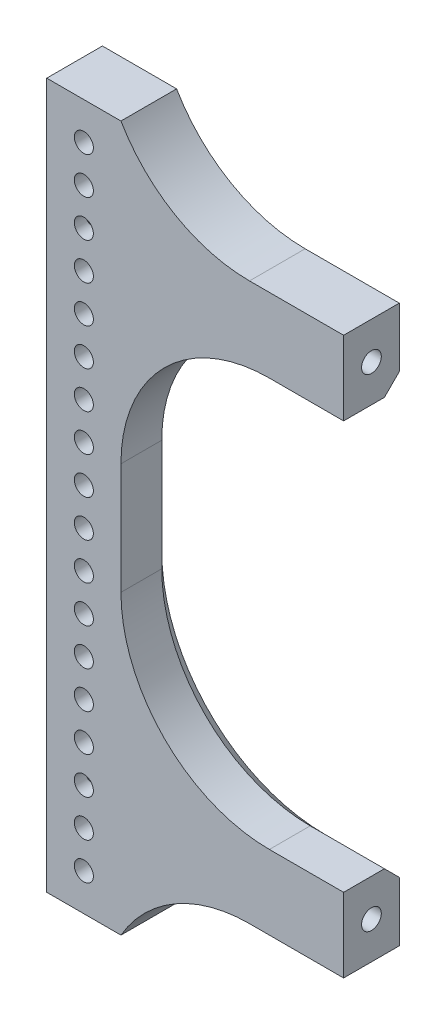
ISO-10303-21;
HEADER;
FILE_DESCRIPTION(('STEP AP214'),'2;1');
FILE_NAME('part.step','',(''),(''),'','','');
FILE_SCHEMA(('AUTOMOTIVE_DESIGN { 1 0 10303 214 1 1 1 1 }'));
ENDSEC;
DATA;
#1=APPLICATION_CONTEXT('core data for automotive mechanical design processes');
#2=APPLICATION_PROTOCOL_DEFINITION('international standard','automotive_design',2000,#1);
#3=PRODUCT_CONTEXT('',#1,'mechanical');
#4=PRODUCT('Part','Part','',(#3));
#5=PRODUCT_RELATED_PRODUCT_CATEGORY('part','',(#4));
#6=PRODUCT_DEFINITION_FORMATION('','',#4);
#7=PRODUCT_DEFINITION_CONTEXT('part definition',#1,'design');
#8=PRODUCT_DEFINITION('design','',#6,#7);
#9=PRODUCT_DEFINITION_SHAPE('','',#8);
#10=(LENGTH_UNIT() NAMED_UNIT(*) SI_UNIT(.MILLI.,.METRE.));
#11=(NAMED_UNIT(*) PLANE_ANGLE_UNIT() SI_UNIT($,.RADIAN.));
#12=(NAMED_UNIT(*) SI_UNIT($,.STERADIAN.) SOLID_ANGLE_UNIT());
#13=UNCERTAINTY_MEASURE_WITH_UNIT(LENGTH_MEASURE(1.E-05),#10,'distance_accuracy_value','');
#14=(GEOMETRIC_REPRESENTATION_CONTEXT(3) GLOBAL_UNCERTAINTY_ASSIGNED_CONTEXT((#13)) GLOBAL_UNIT_ASSIGNED_CONTEXT((#10,
#11,#12)) REPRESENTATION_CONTEXT('',''));
#15=CARTESIAN_POINT('',(0.,0.,0.));
#16=DIRECTION('',(0.,0.,1.));
#17=DIRECTION('',(1.,0.,0.));
#18=AXIS2_PLACEMENT_3D('',#15,#16,#17);
#19=CARTESIAN_POINT('',(101.6,-95.25,19.05));
#20=DIRECTION('',(-1.,0.,0.));
#21=DIRECTION('',(0.,0.,1.));
#22=AXIS2_PLACEMENT_3D('',#19,#20,#21);
#23=PLANE('',#22);
#24=CARTESIAN_POINT('',(101.6,-82.55,9.52499999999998));
#25=DIRECTION('',(-1.,0.,0.));
#26=DIRECTION('',(0.,0.,1.));
#27=AXIS2_PLACEMENT_3D('',#24,#25,#26);
#28=CIRCLE('',#27,3.37819999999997);
#29=CARTESIAN_POINT('',(101.6,-82.55,12.9031999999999));
#30=VERTEX_POINT('',#29);
#31=EDGE_CURVE('E740',#30,#30,#28,.T.);
#32=ORIENTED_EDGE('',*,*,#31,.T.);
#33=EDGE_LOOP('',(#32));
#34=FACE_BOUND('',#33,.T.);
#35=DIRECTION('',(0.,1.,0.));
#36=VECTOR('',#35,1.);
#37=CARTESIAN_POINT('',(101.6,-95.25,0.));
#38=LINE('',#37,#36);
#39=CARTESIAN_POINT('',(101.6,-95.25,0.));
#40=VERTEX_POINT('',#39);
#41=CARTESIAN_POINT('',(101.6,-74.9300000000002,0.));
#42=VERTEX_POINT('',#41);
#43=EDGE_CURVE('E743',#40,#42,#38,.T.);
#44=ORIENTED_EDGE('',*,*,#43,.T.);
#45=DIRECTION('',(0.,0.707106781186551,0.707106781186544));
#46=VECTOR('',#45,1.);
#47=CARTESIAN_POINT('',(101.6,-69.85,5.08000000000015));
#48=LINE('',#47,#46);
#49=CARTESIAN_POINT('',(101.6,-69.85,5.08000000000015));
#50=VERTEX_POINT('',#49);
#51=EDGE_CURVE('E61',#42,#50,#48,.T.);
#52=ORIENTED_EDGE('',*,*,#51,.T.);
#53=DIRECTION('',(0.,0.,-1.));
#54=VECTOR('',#53,1.);
#55=CARTESIAN_POINT('',(101.6,-69.85,19.05));
#56=LINE('',#55,#54);
#57=CARTESIAN_POINT('',(101.6,-69.85,19.05));
#58=VERTEX_POINT('',#57);
#59=EDGE_CURVE('E827',#58,#50,#56,.T.);
#60=ORIENTED_EDGE('',*,*,#59,.F.);
#61=DIRECTION('',(0.,1.,0.));
#62=VECTOR('',#61,1.);
#63=CARTESIAN_POINT('',(101.6,-95.25,19.05));
#64=LINE('',#63,#62);
#65=CARTESIAN_POINT('',(101.6,-95.25,19.05));
#66=VERTEX_POINT('',#65);
#67=EDGE_CURVE('E744',#66,#58,#64,.T.);
#68=ORIENTED_EDGE('',*,*,#67,.F.);
#69=DIRECTION('',(0.,0.,-1.));
#70=VECTOR('',#69,1.);
#71=CARTESIAN_POINT('',(101.6,-95.25,19.05));
#72=LINE('',#71,#70);
#73=EDGE_CURVE('E774',#66,#40,#72,.T.);
#74=ORIENTED_EDGE('',*,*,#73,.T.);
#75=EDGE_LOOP('',(#44,#52,#60,#68,#74));
#76=FACE_BOUND('',#75,.T.);
#77=ADVANCED_FACE('F33',(#34,#76),#23,.F.);
#78=CARTESIAN_POINT('',(101.6,-69.85,19.05));
#79=DIRECTION('',(0.,-1.,0.));
#80=DIRECTION('',(0.,0.,-1.));
#81=AXIS2_PLACEMENT_3D('',#78,#79,#80);
#82=PLANE('',#81);
#83=ORIENTED_EDGE('',*,*,#59,.T.);
#84=DIRECTION('',(-1.,0.,0.));
#85=VECTOR('',#84,1.);
#86=CARTESIAN_POINT('',(76.2,-69.85,5.08000000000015));
#87=LINE('',#86,#85);
#88=CARTESIAN_POINT('',(76.2,-69.85,5.08000000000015));
#89=VERTEX_POINT('',#88);
#90=EDGE_CURVE('E846',#50,#89,#87,.T.);
#91=ORIENTED_EDGE('',*,*,#90,.T.);
#92=DIRECTION('',(0.,0.,-1.));
#93=VECTOR('',#92,1.);
#94=CARTESIAN_POINT('',(76.2,-69.85,19.05));
#95=LINE('',#94,#93);
#96=CARTESIAN_POINT('',(76.2,-69.85,19.05));
#97=VERTEX_POINT('',#96);
#98=EDGE_CURVE('E825',#97,#89,#95,.T.);
#99=ORIENTED_EDGE('',*,*,#98,.F.);
#100=DIRECTION('',(-1.,0.,0.));
#101=VECTOR('',#100,1.);
#102=CARTESIAN_POINT('',(101.6,-69.85,19.05));
#103=LINE('',#102,#101);
#104=EDGE_CURVE('E747',#58,#97,#103,.T.);
#105=ORIENTED_EDGE('',*,*,#104,.F.);
#106=EDGE_LOOP('',(#83,#91,#99,#105));
#107=FACE_BOUND('',#106,.T.);
#108=ADVANCED_FACE('F951',(#107),#82,.F.);
#109=CARTESIAN_POINT('',(76.2,-19.05,19.05));
#110=DIRECTION('',(0.,0.,-1.));
#111=DIRECTION('',(-1.,0.,0.));
#112=AXIS2_PLACEMENT_3D('',#109,#110,#111);
#113=CYLINDRICAL_SURFACE('',#112,50.8);
#114=ORIENTED_EDGE('',*,*,#98,.T.);
#115=CARTESIAN_POINT('',(76.2,-19.05,5.08000000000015));
#116=DIRECTION('',(0.,0.,-1.));
#117=DIRECTION('',(-1.,0.,0.));
#118=AXIS2_PLACEMENT_3D('',#115,#116,#117);
#119=CIRCLE('',#118,50.8);
#120=CARTESIAN_POINT('',(25.4,-19.05,5.08000000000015));
#121=VERTEX_POINT('',#120);
#122=EDGE_CURVE('E11',#89,#121,#119,.T.);
#123=ORIENTED_EDGE('',*,*,#122,.T.);
#124=DIRECTION('',(0.,0.,-1.));
#125=VECTOR('',#124,1.);
#126=CARTESIAN_POINT('',(25.4,-19.05,19.05));
#127=LINE('',#126,#125);
#128=CARTESIAN_POINT('',(25.4,-19.05,19.05));
#129=VERTEX_POINT('',#128);
#130=EDGE_CURVE('E823',#129,#121,#127,.T.);
#131=ORIENTED_EDGE('',*,*,#130,.F.);
#132=CARTESIAN_POINT('',(76.2,-19.05,19.05));
#133=DIRECTION('',(0.,0.,-1.));
#134=DIRECTION('',(-1.,0.,0.));
#135=AXIS2_PLACEMENT_3D('',#132,#133,#134);
#136=CIRCLE('',#135,50.8);
#137=EDGE_CURVE('E750',#97,#129,#136,.T.);
#138=ORIENTED_EDGE('',*,*,#137,.F.);
#139=EDGE_LOOP('',(#114,#123,#131,#138));
#140=FACE_BOUND('',#139,.T.);
#141=ADVANCED_FACE('F957',(#140),#113,.F.);
#142=CARTESIAN_POINT('',(25.4,-19.05,19.05));
#143=DIRECTION('',(-1.,0.,0.));
#144=DIRECTION('',(0.,0.,1.));
#145=AXIS2_PLACEMENT_3D('',#142,#143,#144);
#146=PLANE('',#145);
#147=ORIENTED_EDGE('',*,*,#130,.T.);
#148=DIRECTION('',(0.,1.,0.));
#149=VECTOR('',#148,1.);
#150=CARTESIAN_POINT('',(25.4,19.05,5.08000000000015));
#151=LINE('',#150,#149);
#152=CARTESIAN_POINT('',(25.4,19.05,5.08000000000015));
#153=VERTEX_POINT('',#152);
#154=EDGE_CURVE('E47',#121,#153,#151,.T.);
#155=ORIENTED_EDGE('',*,*,#154,.T.);
#156=DIRECTION('',(0.,0.,-1.));
#157=VECTOR('',#156,1.);
#158=CARTESIAN_POINT('',(25.4,19.05,19.05));
#159=LINE('',#158,#157);
#160=CARTESIAN_POINT('',(25.4,19.05,19.05));
#161=VERTEX_POINT('',#160);
#162=EDGE_CURVE('E820',#161,#153,#159,.T.);
#163=ORIENTED_EDGE('',*,*,#162,.F.);
#164=DIRECTION('',(0.,1.,0.));
#165=VECTOR('',#164,1.);
#166=CARTESIAN_POINT('',(25.4,-19.05,19.05));
#167=LINE('',#166,#165);
#168=EDGE_CURVE('E752',#129,#161,#167,.T.);
#169=ORIENTED_EDGE('',*,*,#168,.F.);
#170=EDGE_LOOP('',(#147,#155,#163,#169));
#171=FACE_BOUND('',#170,.T.);
#172=ADVANCED_FACE('F1032',(#171),#146,.F.);
#173=CARTESIAN_POINT('',(76.2,19.05,19.05));
#174=DIRECTION('',(0.,0.,-1.));
#175=DIRECTION('',(-1.,0.,0.));
#176=AXIS2_PLACEMENT_3D('',#173,#174,#175);
#177=CYLINDRICAL_SURFACE('',#176,50.8);
#178=ORIENTED_EDGE('',*,*,#162,.T.);
#179=CARTESIAN_POINT('',(76.2,19.05,5.08000000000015));
#180=DIRECTION('',(0.,0.,-1.));
#181=DIRECTION('',(-1.,0.,0.));
#182=AXIS2_PLACEMENT_3D('',#179,#180,#181);
#183=CIRCLE('',#182,50.8);
#184=CARTESIAN_POINT('',(76.2,69.85,5.08000000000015));
#185=VERTEX_POINT('',#184);
#186=EDGE_CURVE('E844',#153,#185,#183,.T.);
#187=ORIENTED_EDGE('',*,*,#186,.T.);
#188=DIRECTION('',(0.,0.,-1.));
#189=VECTOR('',#188,1.);
#190=CARTESIAN_POINT('',(76.2,69.85,19.05));
#191=LINE('',#190,#189);
#192=CARTESIAN_POINT('',(76.2,69.85,19.05));
#193=VERTEX_POINT('',#192);
#194=EDGE_CURVE('E817',#193,#185,#191,.T.);
#195=ORIENTED_EDGE('',*,*,#194,.F.);
#196=CARTESIAN_POINT('',(76.2,19.05,19.05));
#197=DIRECTION('',(0.,0.,-1.));
#198=DIRECTION('',(1.,0.,0.));
#199=AXIS2_PLACEMENT_3D('',#196,#197,#198);
#200=CIRCLE('',#199,50.8);
#201=EDGE_CURVE('E754',#161,#193,#200,.T.);
#202=ORIENTED_EDGE('',*,*,#201,.F.);
#203=EDGE_LOOP('',(#178,#187,#195,#202));
#204=FACE_BOUND('',#203,.T.);
#205=ADVANCED_FACE('F1036',(#204),#177,.F.);
#206=CARTESIAN_POINT('',(101.6,69.85,19.05));
#207=DIRECTION('',(0.,1.,0.));
#208=DIRECTION('',(0.,0.,1.));
#209=AXIS2_PLACEMENT_3D('',#206,#207,#208);
#210=PLANE('',#209);
#211=ORIENTED_EDGE('',*,*,#194,.T.);
#212=DIRECTION('',(1.,0.,0.));
#213=VECTOR('',#212,1.);
#214=CARTESIAN_POINT('',(101.6,69.85,5.08000000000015));
#215=LINE('',#214,#213);
#216=CARTESIAN_POINT('',(101.6,69.85,5.08000000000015));
#217=VERTEX_POINT('',#216);
#218=EDGE_CURVE('E829',#185,#217,#215,.T.);
#219=ORIENTED_EDGE('',*,*,#218,.T.);
#220=DIRECTION('',(0.,0.,-1.));
#221=VECTOR('',#220,1.);
#222=CARTESIAN_POINT('',(101.6,69.85,19.05));
#223=LINE('',#222,#221);
#224=CARTESIAN_POINT('',(101.6,69.85,19.05));
#225=VERTEX_POINT('',#224);
#226=EDGE_CURVE('E814',#225,#217,#223,.T.);
#227=ORIENTED_EDGE('',*,*,#226,.F.);
#228=DIRECTION('',(1.,0.,0.));
#229=VECTOR('',#228,1.);
#230=CARTESIAN_POINT('',(101.6,69.85,19.05));
#231=LINE('',#230,#229);
#232=EDGE_CURVE('E756',#193,#225,#231,.T.);
#233=ORIENTED_EDGE('',*,*,#232,.F.);
#234=EDGE_LOOP('',(#211,#219,#227,#233));
#235=FACE_BOUND('',#234,.T.);
#236=ADVANCED_FACE('F1052',(#235),#210,.F.);
#237=CARTESIAN_POINT('',(101.6,69.85,19.05));
#238=DIRECTION('',(-1.,0.,0.));
#239=DIRECTION('',(0.,0.,1.));
#240=AXIS2_PLACEMENT_3D('',#237,#238,#239);
#241=PLANE('',#240);
#242=CARTESIAN_POINT('',(101.6,82.55,9.525));
#243=DIRECTION('',(-1.,0.,0.));
#244=DIRECTION('',(0.,0.,1.));
#245=AXIS2_PLACEMENT_3D('',#242,#243,#244);
#246=CIRCLE('',#245,3.37819999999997);
#247=CARTESIAN_POINT('',(101.6,82.55,12.9032));
#248=VERTEX_POINT('',#247);
#249=EDGE_CURVE('E728',#248,#248,#246,.T.);
#250=ORIENTED_EDGE('',*,*,#249,.T.);
#251=EDGE_LOOP('',(#250));
#252=FACE_BOUND('',#251,.T.);
#253=ORIENTED_EDGE('',*,*,#226,.T.);
#254=DIRECTION('',(0.,0.707106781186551,-0.707106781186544));
#255=VECTOR('',#254,1.);
#256=CARTESIAN_POINT('',(101.6,69.85,5.08000000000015));
#257=LINE('',#256,#255);
#258=CARTESIAN_POINT('',(101.6,74.9300000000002,0.));
#259=VERTEX_POINT('',#258);
#260=EDGE_CURVE('E832',#217,#259,#257,.T.);
#261=ORIENTED_EDGE('',*,*,#260,.T.);
#262=DIRECTION('',(0.,1.,0.));
#263=VECTOR('',#262,1.);
#264=CARTESIAN_POINT('',(101.6,69.85,0.));
#265=LINE('',#264,#263);
#266=CARTESIAN_POINT('',(101.6,95.25,0.));
#267=VERTEX_POINT('',#266);
#268=EDGE_CURVE('E776',#259,#267,#265,.T.);
#269=ORIENTED_EDGE('',*,*,#268,.T.);
#270=DIRECTION('',(0.,0.,-1.));
#271=VECTOR('',#270,1.);
#272=CARTESIAN_POINT('',(101.6,95.25,19.05));
#273=LINE('',#272,#271);
#274=CARTESIAN_POINT('',(101.6,95.25,19.05));
#275=VERTEX_POINT('',#274);
#276=EDGE_CURVE('E811',#275,#267,#273,.T.);
#277=ORIENTED_EDGE('',*,*,#276,.F.);
#278=DIRECTION('',(0.,1.,0.));
#279=VECTOR('',#278,1.);
#280=CARTESIAN_POINT('',(101.6,69.85,19.05));
#281=LINE('',#280,#279);
#282=EDGE_CURVE('E758',#225,#275,#281,.T.);
#283=ORIENTED_EDGE('',*,*,#282,.F.);
#284=EDGE_LOOP('',(#253,#261,#269,#277,#283));
#285=FACE_BOUND('',#284,.T.);
#286=ADVANCED_FACE('F1055',(#252,#285),#241,.F.);
#287=CARTESIAN_POINT('',(101.6,95.25,19.05));
#288=DIRECTION('',(0.,-1.,0.));
#289=DIRECTION('',(0.,0.,-1.));
#290=AXIS2_PLACEMENT_3D('',#287,#288,#289);
#291=PLANE('',#290);
#292=DIRECTION('',(-1.,0.,0.));
#293=VECTOR('',#292,1.);
#294=CARTESIAN_POINT('',(101.6,95.25,0.));
#295=LINE('',#294,#293);
#296=CARTESIAN_POINT('',(69.3940905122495,95.25,0.));
#297=VERTEX_POINT('',#296);
#298=EDGE_CURVE('E778',#267,#297,#295,.T.);
#299=ORIENTED_EDGE('',*,*,#298,.T.);
#300=DIRECTION('',(0.,0.,-1.));
#301=VECTOR('',#300,1.);
#302=CARTESIAN_POINT('',(69.3940905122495,95.25,19.05));
#303=LINE('',#302,#301);
#304=CARTESIAN_POINT('',(69.3940905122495,95.25,19.05));
#305=VERTEX_POINT('',#304);
#306=EDGE_CURVE('E808',#305,#297,#303,.T.);
#307=ORIENTED_EDGE('',*,*,#306,.F.);
#308=DIRECTION('',(-1.,0.,0.));
#309=VECTOR('',#308,1.);
#310=CARTESIAN_POINT('',(101.6,95.25,19.05));
#311=LINE('',#310,#309);
#312=EDGE_CURVE('E760',#275,#305,#311,.T.);
#313=ORIENTED_EDGE('',*,*,#312,.F.);
#314=ORIENTED_EDGE('',*,*,#276,.T.);
#315=EDGE_LOOP('',(#299,#307,#313,#314));
#316=FACE_BOUND('',#315,.T.);
#317=ADVANCED_FACE('F1019',(#316),#291,.F.);
#318=CARTESIAN_POINT('',(69.3940905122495,146.05,19.05));
#319=DIRECTION('',(0.,0.,-1.));
#320=DIRECTION('',(-1.,0.,0.));
#321=AXIS2_PLACEMENT_3D('',#318,#319,#320);
#322=CYLINDRICAL_SURFACE('',#321,50.8);
#323=CARTESIAN_POINT('',(69.3940905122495,146.05,0.));
#324=DIRECTION('',(0.,0.,-1.));
#325=DIRECTION('',(1.,0.,0.));
#326=AXIS2_PLACEMENT_3D('',#323,#324,#325);
#327=CIRCLE('',#326,50.8);
#328=CARTESIAN_POINT('',(25.4,120.65,0.));
#329=VERTEX_POINT('',#328);
#330=EDGE_CURVE('E780',#297,#329,#327,.T.);
#331=ORIENTED_EDGE('',*,*,#330,.T.);
#332=DIRECTION('',(0.,0.,-1.));
#333=VECTOR('',#332,1.);
#334=CARTESIAN_POINT('',(25.4,120.65,19.05));
#335=LINE('',#334,#333);
#336=CARTESIAN_POINT('',(25.4,120.65,19.05));
#337=VERTEX_POINT('',#336);
#338=EDGE_CURVE('E805',#337,#329,#335,.T.);
#339=ORIENTED_EDGE('',*,*,#338,.F.);
#340=CARTESIAN_POINT('',(69.3940905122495,146.05,19.05));
#341=DIRECTION('',(0.,0.,-1.));
#342=DIRECTION('',(1.,0.,0.));
#343=AXIS2_PLACEMENT_3D('',#340,#341,#342);
#344=CIRCLE('',#343,50.8);
#345=EDGE_CURVE('E762',#305,#337,#344,.T.);
#346=ORIENTED_EDGE('',*,*,#345,.F.);
#347=ORIENTED_EDGE('',*,*,#306,.T.);
#348=EDGE_LOOP('',(#331,#339,#346,#347));
#349=FACE_BOUND('',#348,.T.);
#350=ADVANCED_FACE('F1015',(#349),#322,.F.);
#351=CARTESIAN_POINT('',(0.,120.65,19.05));
#352=DIRECTION('',(0.,-1.,0.));
#353=DIRECTION('',(1.,0.,0.));
#354=AXIS2_PLACEMENT_3D('',#351,#352,#353);
#355=PLANE('',#354);
#356=DIRECTION('',(-1.,0.,0.));
#357=VECTOR('',#356,1.);
#358=CARTESIAN_POINT('',(0.,120.65,0.));
#359=LINE('',#358,#357);
#360=CARTESIAN_POINT('',(0.,120.65,0.));
#361=VERTEX_POINT('',#360);
#362=EDGE_CURVE('E782',#329,#361,#359,.T.);
#363=ORIENTED_EDGE('',*,*,#362,.T.);
#364=DIRECTION('',(0.,0.,-1.));
#365=VECTOR('',#364,1.);
#366=CARTESIAN_POINT('',(0.,120.65,19.05));
#367=LINE('',#366,#365);
#368=CARTESIAN_POINT('',(0.,120.65,19.05));
#369=VERTEX_POINT('',#368);
#370=EDGE_CURVE('E802',#369,#361,#367,.T.);
#371=ORIENTED_EDGE('',*,*,#370,.F.);
#372=DIRECTION('',(-1.,0.,0.));
#373=VECTOR('',#372,1.);
#374=CARTESIAN_POINT('',(0.,120.65,19.05));
#375=LINE('',#374,#373);
#376=EDGE_CURVE('E764',#337,#369,#375,.T.);
#377=ORIENTED_EDGE('',*,*,#376,.F.);
#378=ORIENTED_EDGE('',*,*,#338,.T.);
#379=EDGE_LOOP('',(#363,#371,#377,#378));
#380=FACE_BOUND('',#379,.T.);
#381=ADVANCED_FACE('F1010',(#380),#355,.F.);
#382=CARTESIAN_POINT('',(0.,-120.65,19.05));
#383=DIRECTION('',(1.,0.,0.));
#384=DIRECTION('',(0.,0.,-1.));
#385=AXIS2_PLACEMENT_3D('',#382,#383,#384);
#386=PLANE('',#385);
#387=CARTESIAN_POINT('',(0.,82.55,9.525));
#388=DIRECTION('',(-1.,0.,0.));
#389=DIRECTION('',(0.,0.,1.));
#390=AXIS2_PLACEMENT_3D('',#387,#388,#389);
#391=CIRCLE('',#390,5.55625);
#392=CARTESIAN_POINT('',(0.,82.55,15.08125));
#393=VERTEX_POINT('',#392);
#394=EDGE_CURVE('E718',#393,#393,#391,.T.);
#395=ORIENTED_EDGE('',*,*,#394,.F.);
#396=EDGE_LOOP('',(#395));
#397=FACE_BOUND('',#396,.T.);
#398=CARTESIAN_POINT('',(0.,-82.55,9.52499999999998));
#399=DIRECTION('',(-1.,0.,0.));
#400=DIRECTION('',(0.,0.,1.));
#401=AXIS2_PLACEMENT_3D('',#398,#399,#400);
#402=CIRCLE('',#401,5.55625);
#403=CARTESIAN_POINT('',(0.,-82.55,15.08125));
#404=VERTEX_POINT('',#403);
#405=EDGE_CURVE('E731',#404,#404,#402,.T.);
#406=ORIENTED_EDGE('',*,*,#405,.F.);
#407=EDGE_LOOP('',(#406));
#408=FACE_BOUND('',#407,.T.);
#409=DIRECTION('',(0.,-1.,0.));
#410=VECTOR('',#409,1.);
#411=CARTESIAN_POINT('',(0.,-120.65,0.));
#412=LINE('',#411,#410);
#413=CARTESIAN_POINT('',(0.,-120.65,0.));
#414=VERTEX_POINT('',#413);
#415=EDGE_CURVE('E784',#361,#414,#412,.T.);
#416=ORIENTED_EDGE('',*,*,#415,.T.);
#417=DIRECTION('',(0.,0.,-1.));
#418=VECTOR('',#417,1.);
#419=CARTESIAN_POINT('',(0.,-120.65,19.05));
#420=LINE('',#419,#418);
#421=CARTESIAN_POINT('',(0.,-120.65,19.05));
#422=VERTEX_POINT('',#421);
#423=EDGE_CURVE('E799',#422,#414,#420,.T.);
#424=ORIENTED_EDGE('',*,*,#423,.F.);
#425=DIRECTION('',(0.,-1.,0.));
#426=VECTOR('',#425,1.);
#427=CARTESIAN_POINT('',(0.,-120.65,19.05));
#428=LINE('',#427,#426);
#429=EDGE_CURVE('E766',#369,#422,#428,.T.);
#430=ORIENTED_EDGE('',*,*,#429,.F.);
#431=ORIENTED_EDGE('',*,*,#370,.T.);
#432=EDGE_LOOP('',(#416,#424,#430,#431));
#433=FACE_BOUND('',#432,.T.);
#434=ADVANCED_FACE('F1004',(#397,#408,#433),#386,.F.);
#435=CARTESIAN_POINT('',(25.4,-120.65,19.05));
#436=DIRECTION('',(0.,1.,0.));
#437=DIRECTION('',(-1.,0.,0.));
#438=AXIS2_PLACEMENT_3D('',#435,#436,#437);
#439=PLANE('',#438);
#440=DIRECTION('',(1.,0.,0.));
#441=VECTOR('',#440,1.);
#442=CARTESIAN_POINT('',(25.4,-120.65,0.));
#443=LINE('',#442,#441);
#444=CARTESIAN_POINT('',(25.4,-120.65,0.));
#445=VERTEX_POINT('',#444);
#446=EDGE_CURVE('E786',#414,#445,#443,.T.);
#447=ORIENTED_EDGE('',*,*,#446,.T.);
#448=DIRECTION('',(0.,0.,-1.));
#449=VECTOR('',#448,1.);
#450=CARTESIAN_POINT('',(25.4,-120.65,19.05));
#451=LINE('',#450,#449);
#452=CARTESIAN_POINT('',(25.4,-120.65,19.05));
#453=VERTEX_POINT('',#452);
#454=EDGE_CURVE('E796',#453,#445,#451,.T.);
#455=ORIENTED_EDGE('',*,*,#454,.F.);
#456=DIRECTION('',(1.,0.,0.));
#457=VECTOR('',#456,1.);
#458=CARTESIAN_POINT('',(25.4,-120.65,19.05));
#459=LINE('',#458,#457);
#460=EDGE_CURVE('E768',#422,#453,#459,.T.);
#461=ORIENTED_EDGE('',*,*,#460,.F.);
#462=ORIENTED_EDGE('',*,*,#423,.T.);
#463=EDGE_LOOP('',(#447,#455,#461,#462));
#464=FACE_BOUND('',#463,.T.);
#465=ADVANCED_FACE('F1000',(#464),#439,.F.);
#466=CARTESIAN_POINT('',(69.3940905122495,-146.05,19.05));
#467=DIRECTION('',(0.,0.,-1.));
#468=DIRECTION('',(-1.,0.,0.));
#469=AXIS2_PLACEMENT_3D('',#466,#467,#468);
#470=CYLINDRICAL_SURFACE('',#469,50.8);
#471=CARTESIAN_POINT('',(69.3940905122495,-146.05,0.));
#472=DIRECTION('',(0.,0.,-1.));
#473=DIRECTION('',(-1.,0.,0.));
#474=AXIS2_PLACEMENT_3D('',#471,#472,#473);
#475=CIRCLE('',#474,50.8);
#476=CARTESIAN_POINT('',(69.3940905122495,-95.25,0.));
#477=VERTEX_POINT('',#476);
#478=EDGE_CURVE('E788',#445,#477,#475,.T.);
#479=ORIENTED_EDGE('',*,*,#478,.T.);
#480=DIRECTION('',(0.,0.,-1.));
#481=VECTOR('',#480,1.);
#482=CARTESIAN_POINT('',(69.3940905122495,-95.25,19.05));
#483=LINE('',#482,#481);
#484=CARTESIAN_POINT('',(69.3940905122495,-95.25,19.05));
#485=VERTEX_POINT('',#484);
#486=EDGE_CURVE('E793',#485,#477,#483,.T.);
#487=ORIENTED_EDGE('',*,*,#486,.F.);
#488=CARTESIAN_POINT('',(69.3940905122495,-146.05,19.05));
#489=DIRECTION('',(0.,0.,-1.));
#490=DIRECTION('',(-1.,0.,0.));
#491=AXIS2_PLACEMENT_3D('',#488,#489,#490);
#492=CIRCLE('',#491,50.8);
#493=EDGE_CURVE('E770',#453,#485,#492,.T.);
#494=ORIENTED_EDGE('',*,*,#493,.F.);
#495=ORIENTED_EDGE('',*,*,#454,.T.);
#496=EDGE_LOOP('',(#479,#487,#494,#495));
#497=FACE_BOUND('',#496,.T.);
#498=ADVANCED_FACE('F995',(#497),#470,.F.);
#499=CARTESIAN_POINT('',(101.6,-95.25,19.05));
#500=DIRECTION('',(0.,1.,0.));
#501=DIRECTION('',(-1.,0.,0.));
#502=AXIS2_PLACEMENT_3D('',#499,#500,#501);
#503=PLANE('',#502);
#504=DIRECTION('',(1.,0.,0.));
#505=VECTOR('',#504,1.);
#506=CARTESIAN_POINT('',(101.6,-95.25,0.));
#507=LINE('',#506,#505);
#508=EDGE_CURVE('E748',#477,#40,#507,.T.);
#509=ORIENTED_EDGE('',*,*,#508,.T.);
#510=ORIENTED_EDGE('',*,*,#73,.F.);
#511=DIRECTION('',(1.,0.,0.));
#512=VECTOR('',#511,1.);
#513=CARTESIAN_POINT('',(101.6,-95.25,19.05));
#514=LINE('',#513,#512);
#515=EDGE_CURVE('E772',#485,#66,#514,.T.);
#516=ORIENTED_EDGE('',*,*,#515,.F.);
#517=ORIENTED_EDGE('',*,*,#486,.T.);
#518=EDGE_LOOP('',(#509,#510,#516,#517));
#519=FACE_BOUND('',#518,.T.);
#520=ADVANCED_FACE('F989',(#519),#503,.F.);
#521=CARTESIAN_POINT('',(76.2,-19.05,19.05));
#522=DIRECTION('',(0.,0.,-1.));
#523=DIRECTION('',(-1.,0.,0.));
#524=AXIS2_PLACEMENT_3D('',#521,#522,#523);
#525=PLANE('',#524);
#526=CARTESIAN_POINT('',(12.7,-6.34999999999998,19.05));
#527=DIRECTION('',(0.,0.,-1.));
#528=DIRECTION('',(-1.,0.,0.));
#529=AXIS2_PLACEMENT_3D('',#526,#527,#528);
#530=CIRCLE('',#529,3.2639);
#531=CARTESIAN_POINT('',(9.43610000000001,-6.34999999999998,19.05));
#532=VERTEX_POINT('',#531);
#533=EDGE_CURVE('E375',#532,#532,#530,.T.);
#534=ORIENTED_EDGE('',*,*,#533,.T.);
#535=EDGE_LOOP('',(#534));
#536=FACE_BOUND('',#535,.T.);
#537=CARTESIAN_POINT('',(12.7,-19.05,19.05));
#538=DIRECTION('',(0.,0.,-1.));
#539=DIRECTION('',(-1.,0.,0.));
#540=AXIS2_PLACEMENT_3D('',#537,#538,#539);
#541=CIRCLE('',#540,3.2639);
#542=CARTESIAN_POINT('',(9.43610000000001,-19.05,19.05));
#543=VERTEX_POINT('',#542);
#544=EDGE_CURVE('E387',#543,#543,#541,.T.);
#545=ORIENTED_EDGE('',*,*,#544,.T.);
#546=EDGE_LOOP('',(#545));
#547=FACE_BOUND('',#546,.T.);
#548=CARTESIAN_POINT('',(12.7,-31.75,19.05));
#549=DIRECTION('',(0.,0.,-1.));
#550=DIRECTION('',(-1.,0.,0.));
#551=AXIS2_PLACEMENT_3D('',#548,#549,#550);
#552=CIRCLE('',#551,3.2639);
#553=CARTESIAN_POINT('',(9.43610000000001,-31.75,19.05));
#554=VERTEX_POINT('',#553);
#555=EDGE_CURVE('E399',#554,#554,#552,.T.);
#556=ORIENTED_EDGE('',*,*,#555,.T.);
#557=EDGE_LOOP('',(#556));
#558=FACE_BOUND('',#557,.T.);
#559=CARTESIAN_POINT('',(12.7,-44.45,19.05));
#560=DIRECTION('',(0.,0.,-1.));
#561=DIRECTION('',(-1.,0.,0.));
#562=AXIS2_PLACEMENT_3D('',#559,#560,#561);
#563=CIRCLE('',#562,3.2639);
#564=CARTESIAN_POINT('',(9.43610000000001,-44.45,19.05));
#565=VERTEX_POINT('',#564);
#566=EDGE_CURVE('E411',#565,#565,#563,.T.);
#567=ORIENTED_EDGE('',*,*,#566,.T.);
#568=EDGE_LOOP('',(#567));
#569=FACE_BOUND('',#568,.T.);
#570=CARTESIAN_POINT('',(12.7,-57.15,19.05));
#571=DIRECTION('',(0.,0.,-1.));
#572=DIRECTION('',(-1.,0.,0.));
#573=AXIS2_PLACEMENT_3D('',#570,#571,#572);
#574=CIRCLE('',#573,3.2639);
#575=CARTESIAN_POINT('',(9.43610000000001,-57.15,19.05));
#576=VERTEX_POINT('',#575);
#577=EDGE_CURVE('E423',#576,#576,#574,.T.);
#578=ORIENTED_EDGE('',*,*,#577,.T.);
#579=EDGE_LOOP('',(#578));
#580=FACE_BOUND('',#579,.T.);
#581=CARTESIAN_POINT('',(12.7,-69.85,19.05));
#582=DIRECTION('',(0.,0.,-1.));
#583=DIRECTION('',(-1.,0.,0.));
#584=AXIS2_PLACEMENT_3D('',#581,#582,#583);
#585=CIRCLE('',#584,3.2639);
#586=CARTESIAN_POINT('',(9.43610000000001,-69.85,19.05));
#587=VERTEX_POINT('',#586);
#588=EDGE_CURVE('E435',#587,#587,#585,.T.);
#589=ORIENTED_EDGE('',*,*,#588,.T.);
#590=EDGE_LOOP('',(#589));
#591=FACE_BOUND('',#590,.T.);
#592=CARTESIAN_POINT('',(12.7,-82.55,19.05));
#593=DIRECTION('',(0.,0.,-1.));
#594=DIRECTION('',(-1.,0.,0.));
#595=AXIS2_PLACEMENT_3D('',#592,#593,#594);
#596=CIRCLE('',#595,3.2639);
#597=CARTESIAN_POINT('',(9.43610000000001,-82.55,19.05));
#598=VERTEX_POINT('',#597);
#599=EDGE_CURVE('E441',#598,#598,#596,.T.);
#600=ORIENTED_EDGE('',*,*,#599,.T.);
#601=EDGE_LOOP('',(#600));
#602=FACE_BOUND('',#601,.T.);
#603=CARTESIAN_POINT('',(12.7,-95.25,19.05));
#604=DIRECTION('',(0.,0.,-1.));
#605=DIRECTION('',(-1.,0.,0.));
#606=AXIS2_PLACEMENT_3D('',#603,#604,#605);
#607=CIRCLE('',#606,3.2639);
#608=CARTESIAN_POINT('',(9.43610000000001,-95.25,19.05));
#609=VERTEX_POINT('',#608);
#610=EDGE_CURVE('E454',#609,#609,#607,.T.);
#611=ORIENTED_EDGE('',*,*,#610,.T.);
#612=EDGE_LOOP('',(#611));
#613=FACE_BOUND('',#612,.T.);
#614=CARTESIAN_POINT('',(12.7,-107.95,19.05));
#615=DIRECTION('',(0.,0.,-1.));
#616=DIRECTION('',(-1.,0.,0.));
#617=AXIS2_PLACEMENT_3D('',#614,#615,#616);
#618=CIRCLE('',#617,3.2639);
#619=CARTESIAN_POINT('',(9.43610000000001,-107.95,19.05));
#620=VERTEX_POINT('',#619);
#621=EDGE_CURVE('E490',#620,#620,#618,.T.);
#622=ORIENTED_EDGE('',*,*,#621,.T.);
#623=EDGE_LOOP('',(#622));
#624=FACE_BOUND('',#623,.T.);
#625=CARTESIAN_POINT('',(12.7,6.34999999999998,19.05));
#626=DIRECTION('',(0.,0.,-1.));
#627=DIRECTION('',(-1.,0.,0.));
#628=AXIS2_PLACEMENT_3D('',#625,#626,#627);
#629=CIRCLE('',#628,3.2639);
#630=CARTESIAN_POINT('',(9.43610000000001,6.34999999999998,19.05));
#631=VERTEX_POINT('',#630);
#632=EDGE_CURVE('E598',#631,#631,#629,.T.);
#633=ORIENTED_EDGE('',*,*,#632,.T.);
#634=EDGE_LOOP('',(#633));
#635=FACE_BOUND('',#634,.T.);
#636=CARTESIAN_POINT('',(12.7,19.05,19.05));
#637=DIRECTION('',(0.,0.,-1.));
#638=DIRECTION('',(-1.,0.,0.));
#639=AXIS2_PLACEMENT_3D('',#636,#637,#638);
#640=CIRCLE('',#639,3.2639);
#641=CARTESIAN_POINT('',(9.43610000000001,19.05,19.05));
#642=VERTEX_POINT('',#641);
#643=EDGE_CURVE('E610',#642,#642,#640,.T.);
#644=ORIENTED_EDGE('',*,*,#643,.T.);
#645=EDGE_LOOP('',(#644));
#646=FACE_BOUND('',#645,.T.);
#647=CARTESIAN_POINT('',(12.7,31.75,19.05));
#648=DIRECTION('',(0.,0.,-1.));
#649=DIRECTION('',(-1.,0.,0.));
#650=AXIS2_PLACEMENT_3D('',#647,#648,#649);
#651=CIRCLE('',#650,3.2639);
#652=CARTESIAN_POINT('',(9.43610000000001,31.75,19.05));
#653=VERTEX_POINT('',#652);
#654=EDGE_CURVE('E622',#653,#653,#651,.T.);
#655=ORIENTED_EDGE('',*,*,#654,.T.);
#656=EDGE_LOOP('',(#655));
#657=FACE_BOUND('',#656,.T.);
#658=CARTESIAN_POINT('',(12.7,44.45,19.05));
#659=DIRECTION('',(0.,0.,-1.));
#660=DIRECTION('',(-1.,0.,0.));
#661=AXIS2_PLACEMENT_3D('',#658,#659,#660);
#662=CIRCLE('',#661,3.2639);
#663=CARTESIAN_POINT('',(9.43610000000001,44.45,19.05));
#664=VERTEX_POINT('',#663);
#665=EDGE_CURVE('E634',#664,#664,#662,.T.);
#666=ORIENTED_EDGE('',*,*,#665,.T.);
#667=EDGE_LOOP('',(#666));
#668=FACE_BOUND('',#667,.T.);
#669=CARTESIAN_POINT('',(12.7,57.15,19.05));
#670=DIRECTION('',(0.,0.,-1.));
#671=DIRECTION('',(-1.,0.,0.));
#672=AXIS2_PLACEMENT_3D('',#669,#670,#671);
#673=CIRCLE('',#672,3.2639);
#674=CARTESIAN_POINT('',(9.43610000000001,57.15,19.05));
#675=VERTEX_POINT('',#674);
#676=EDGE_CURVE('E646',#675,#675,#673,.T.);
#677=ORIENTED_EDGE('',*,*,#676,.T.);
#678=EDGE_LOOP('',(#677));
#679=FACE_BOUND('',#678,.T.);
#680=CARTESIAN_POINT('',(12.7,69.85,19.05));
#681=DIRECTION('',(0.,0.,-1.));
#682=DIRECTION('',(-1.,0.,0.));
#683=AXIS2_PLACEMENT_3D('',#680,#681,#682);
#684=CIRCLE('',#683,3.2639);
#685=CARTESIAN_POINT('',(9.43610000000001,69.85,19.05));
#686=VERTEX_POINT('',#685);
#687=EDGE_CURVE('E658',#686,#686,#684,.T.);
#688=ORIENTED_EDGE('',*,*,#687,.T.);
#689=EDGE_LOOP('',(#688));
#690=FACE_BOUND('',#689,.T.);
#691=CARTESIAN_POINT('',(12.7,82.55,19.05));
#692=DIRECTION('',(0.,0.,-1.));
#693=DIRECTION('',(-1.,0.,0.));
#694=AXIS2_PLACEMENT_3D('',#691,#692,#693);
#695=CIRCLE('',#694,3.2639);
#696=CARTESIAN_POINT('',(9.43610000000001,82.55,19.05));
#697=VERTEX_POINT('',#696);
#698=EDGE_CURVE('E664',#697,#697,#695,.T.);
#699=ORIENTED_EDGE('',*,*,#698,.T.);
#700=EDGE_LOOP('',(#699));
#701=FACE_BOUND('',#700,.T.);
#702=CARTESIAN_POINT('',(12.7,95.25,19.05));
#703=DIRECTION('',(0.,0.,-1.));
#704=DIRECTION('',(-1.,0.,0.));
#705=AXIS2_PLACEMENT_3D('',#702,#703,#704);
#706=CIRCLE('',#705,3.2639);
#707=CARTESIAN_POINT('',(9.43610000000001,95.25,19.05));
#708=VERTEX_POINT('',#707);
#709=EDGE_CURVE('E678',#708,#708,#706,.T.);
#710=ORIENTED_EDGE('',*,*,#709,.T.);
#711=EDGE_LOOP('',(#710));
#712=FACE_BOUND('',#711,.T.);
#713=CARTESIAN_POINT('',(12.7,107.95,19.05));
#714=DIRECTION('',(0.,0.,-1.));
#715=DIRECTION('',(-1.,0.,0.));
#716=AXIS2_PLACEMENT_3D('',#713,#714,#715);
#717=CIRCLE('',#716,3.2639);
#718=CARTESIAN_POINT('',(9.43610000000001,107.95,19.05));
#719=VERTEX_POINT('',#718);
#720=EDGE_CURVE('E714',#719,#719,#717,.T.);
#721=ORIENTED_EDGE('',*,*,#720,.T.);
#722=EDGE_LOOP('',(#721));
#723=FACE_BOUND('',#722,.T.);
#724=ORIENTED_EDGE('',*,*,#67,.T.);
#725=ORIENTED_EDGE('',*,*,#104,.T.);
#726=ORIENTED_EDGE('',*,*,#137,.T.);
#727=ORIENTED_EDGE('',*,*,#168,.T.);
#728=ORIENTED_EDGE('',*,*,#201,.T.);
#729=ORIENTED_EDGE('',*,*,#232,.T.);
#730=ORIENTED_EDGE('',*,*,#282,.T.);
#731=ORIENTED_EDGE('',*,*,#312,.T.);
#732=ORIENTED_EDGE('',*,*,#345,.T.);
#733=ORIENTED_EDGE('',*,*,#376,.T.);
#734=ORIENTED_EDGE('',*,*,#429,.T.);
#735=ORIENTED_EDGE('',*,*,#460,.T.);
#736=ORIENTED_EDGE('',*,*,#493,.T.);
#737=ORIENTED_EDGE('',*,*,#515,.T.);
#738=EDGE_LOOP('',(#724,#725,#726,#727,#728,#729,#730,#731,#732,#733,#734,#735,#736,#737));
#739=FACE_BOUND('',#738,.T.);
#740=ADVANCED_FACE('F1040',(#536,#547,#558,#569,#580,#591,#602,#613,#624,#635,#646,#657,#668,
#679,#690,#701,#712,#723,#739),#525,.F.);
#741=CARTESIAN_POINT('',(76.2,-19.05,0.));
#742=DIRECTION('',(0.,0.,-1.));
#743=DIRECTION('',(-1.,0.,0.));
#744=AXIS2_PLACEMENT_3D('',#741,#742,#743);
#745=PLANE('',#744);
#746=CARTESIAN_POINT('',(6.34999999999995,-12.7,0.));
#747=DIRECTION('',(0.,0.,-1.));
#748=DIRECTION('',(-1.,0.,0.));
#749=AXIS2_PLACEMENT_3D('',#746,#747,#748);
#750=CIRCLE('',#749,0.992251);
#751=CARTESIAN_POINT('',(5.35774899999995,-12.7,0.));
#752=VERTEX_POINT('',#751);
#753=EDGE_CURVE('E284',#752,#752,#750,.T.);
#754=ORIENTED_EDGE('',*,*,#753,.F.);
#755=EDGE_LOOP('',(#754));
#756=FACE_BOUND('',#755,.T.);
#757=CARTESIAN_POINT('',(19.05,-12.7,0.));
#758=DIRECTION('',(0.,0.,-1.));
#759=DIRECTION('',(-1.,0.,0.));
#760=AXIS2_PLACEMENT_3D('',#757,#758,#759);
#761=CIRCLE('',#760,0.992251);
#762=CARTESIAN_POINT('',(18.057749,-12.7,0.));
#763=VERTEX_POINT('',#762);
#764=EDGE_CURVE('E283',#763,#763,#761,.T.);
#765=ORIENTED_EDGE('',*,*,#764,.F.);
#766=EDGE_LOOP('',(#765));
#767=FACE_BOUND('',#766,.T.);
#768=CARTESIAN_POINT('',(6.34999999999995,-25.4,0.));
#769=DIRECTION('',(0.,0.,-1.));
#770=DIRECTION('',(-1.,0.,0.));
#771=AXIS2_PLACEMENT_3D('',#768,#769,#770);
#772=CIRCLE('',#771,0.992251);
#773=CARTESIAN_POINT('',(5.35774899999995,-25.4,0.));
#774=VERTEX_POINT('',#773);
#775=EDGE_CURVE('E294',#774,#774,#772,.T.);
#776=ORIENTED_EDGE('',*,*,#775,.F.);
#777=EDGE_LOOP('',(#776));
#778=FACE_BOUND('',#777,.T.);
#779=CARTESIAN_POINT('',(19.05,-25.4,0.));
#780=DIRECTION('',(0.,0.,-1.));
#781=DIRECTION('',(-1.,0.,0.));
#782=AXIS2_PLACEMENT_3D('',#779,#780,#781);
#783=CIRCLE('',#782,0.992251);
#784=CARTESIAN_POINT('',(18.057749,-25.4,0.));
#785=VERTEX_POINT('',#784);
#786=EDGE_CURVE('E300',#785,#785,#783,.T.);
#787=ORIENTED_EDGE('',*,*,#786,.F.);
#788=EDGE_LOOP('',(#787));
#789=FACE_BOUND('',#788,.T.);
#790=CARTESIAN_POINT('',(6.34999999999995,-38.1,0.));
#791=DIRECTION('',(0.,0.,-1.));
#792=DIRECTION('',(-1.,0.,0.));
#793=AXIS2_PLACEMENT_3D('',#790,#791,#792);
#794=CIRCLE('',#793,0.992251);
#795=CARTESIAN_POINT('',(5.35774899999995,-38.1,0.));
#796=VERTEX_POINT('',#795);
#797=EDGE_CURVE('E306',#796,#796,#794,.T.);
#798=ORIENTED_EDGE('',*,*,#797,.F.);
#799=EDGE_LOOP('',(#798));
#800=FACE_BOUND('',#799,.T.);
#801=CARTESIAN_POINT('',(19.05,-38.1,0.));
#802=DIRECTION('',(0.,0.,-1.));
#803=DIRECTION('',(-1.,0.,0.));
#804=AXIS2_PLACEMENT_3D('',#801,#802,#803);
#805=CIRCLE('',#804,0.992251);
#806=CARTESIAN_POINT('',(18.057749,-38.1,0.));
#807=VERTEX_POINT('',#806);
#808=EDGE_CURVE('E312',#807,#807,#805,.T.);
#809=ORIENTED_EDGE('',*,*,#808,.F.);
#810=EDGE_LOOP('',(#809));
#811=FACE_BOUND('',#810,.T.);
#812=CARTESIAN_POINT('',(6.34999999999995,-50.8,0.));
#813=DIRECTION('',(0.,0.,-1.));
#814=DIRECTION('',(-1.,0.,0.));
#815=AXIS2_PLACEMENT_3D('',#812,#813,#814);
#816=CIRCLE('',#815,0.992251);
#817=CARTESIAN_POINT('',(5.35774899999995,-50.8,0.));
#818=VERTEX_POINT('',#817);
#819=EDGE_CURVE('E318',#818,#818,#816,.T.);
#820=ORIENTED_EDGE('',*,*,#819,.F.);
#821=EDGE_LOOP('',(#820));
#822=FACE_BOUND('',#821,.T.);
#823=CARTESIAN_POINT('',(19.05,-50.8,0.));
#824=DIRECTION('',(0.,0.,-1.));
#825=DIRECTION('',(-1.,0.,0.));
#826=AXIS2_PLACEMENT_3D('',#823,#824,#825);
#827=CIRCLE('',#826,0.992251);
#828=CARTESIAN_POINT('',(18.057749,-50.8,0.));
#829=VERTEX_POINT('',#828);
#830=EDGE_CURVE('E324',#829,#829,#827,.T.);
#831=ORIENTED_EDGE('',*,*,#830,.F.);
#832=EDGE_LOOP('',(#831));
#833=FACE_BOUND('',#832,.T.);
#834=CARTESIAN_POINT('',(6.34999999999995,-63.5,0.));
#835=DIRECTION('',(0.,0.,-1.));
#836=DIRECTION('',(-1.,0.,0.));
#837=AXIS2_PLACEMENT_3D('',#834,#835,#836);
#838=CIRCLE('',#837,0.992251);
#839=CARTESIAN_POINT('',(5.35774899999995,-63.5,0.));
#840=VERTEX_POINT('',#839);
#841=EDGE_CURVE('E330',#840,#840,#838,.T.);
#842=ORIENTED_EDGE('',*,*,#841,.F.);
#843=EDGE_LOOP('',(#842));
#844=FACE_BOUND('',#843,.T.);
#845=CARTESIAN_POINT('',(19.05,-63.5,0.));
#846=DIRECTION('',(0.,0.,-1.));
#847=DIRECTION('',(-1.,0.,0.));
#848=AXIS2_PLACEMENT_3D('',#845,#846,#847);
#849=CIRCLE('',#848,0.992251);
#850=CARTESIAN_POINT('',(18.057749,-63.5,0.));
#851=VERTEX_POINT('',#850);
#852=EDGE_CURVE('E336',#851,#851,#849,.T.);
#853=ORIENTED_EDGE('',*,*,#852,.F.);
#854=EDGE_LOOP('',(#853));
#855=FACE_BOUND('',#854,.T.);
#856=CARTESIAN_POINT('',(6.34999999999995,-76.2,0.));
#857=DIRECTION('',(0.,0.,-1.));
#858=DIRECTION('',(-1.,0.,0.));
#859=AXIS2_PLACEMENT_3D('',#856,#857,#858);
#860=CIRCLE('',#859,0.992251);
#861=CARTESIAN_POINT('',(5.35774899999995,-76.2,0.));
#862=VERTEX_POINT('',#861);
#863=EDGE_CURVE('E342',#862,#862,#860,.T.);
#864=ORIENTED_EDGE('',*,*,#863,.F.);
#865=EDGE_LOOP('',(#864));
#866=FACE_BOUND('',#865,.T.);
#867=CARTESIAN_POINT('',(19.05,-76.2,0.));
#868=DIRECTION('',(0.,0.,-1.));
#869=DIRECTION('',(-1.,0.,0.));
#870=AXIS2_PLACEMENT_3D('',#867,#868,#869);
#871=CIRCLE('',#870,0.992251);
#872=CARTESIAN_POINT('',(18.057749,-76.2,0.));
#873=VERTEX_POINT('',#872);
#874=EDGE_CURVE('E348',#873,#873,#871,.T.);
#875=ORIENTED_EDGE('',*,*,#874,.F.);
#876=EDGE_LOOP('',(#875));
#877=FACE_BOUND('',#876,.T.);
#878=CARTESIAN_POINT('',(6.34999999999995,-88.9,0.));
#879=DIRECTION('',(0.,0.,-1.));
#880=DIRECTION('',(-1.,0.,0.));
#881=AXIS2_PLACEMENT_3D('',#878,#879,#880);
#882=CIRCLE('',#881,0.992251);
#883=CARTESIAN_POINT('',(5.35774899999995,-88.9,0.));
#884=VERTEX_POINT('',#883);
#885=EDGE_CURVE('E354',#884,#884,#882,.T.);
#886=ORIENTED_EDGE('',*,*,#885,.F.);
#887=EDGE_LOOP('',(#886));
#888=FACE_BOUND('',#887,.T.);
#889=CARTESIAN_POINT('',(19.05,-88.9,0.));
#890=DIRECTION('',(0.,0.,-1.));
#891=DIRECTION('',(-1.,0.,0.));
#892=AXIS2_PLACEMENT_3D('',#889,#890,#891);
#893=CIRCLE('',#892,0.992251);
#894=CARTESIAN_POINT('',(18.057749,-88.9,0.));
#895=VERTEX_POINT('',#894);
#896=EDGE_CURVE('E360',#895,#895,#893,.T.);
#897=ORIENTED_EDGE('',*,*,#896,.F.);
#898=EDGE_LOOP('',(#897));
#899=FACE_BOUND('',#898,.T.);
#900=CARTESIAN_POINT('',(12.7,-6.34999999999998,0.));
#901=DIRECTION('',(0.,0.,-1.));
#902=DIRECTION('',(-1.,0.,0.));
#903=AXIS2_PLACEMENT_3D('',#900,#901,#902);
#904=CIRCLE('',#903,3.96875);
#905=CARTESIAN_POINT('',(8.73125,-6.34999999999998,0.));
#906=VERTEX_POINT('',#905);
#907=EDGE_CURVE('E366',#906,#906,#904,.T.);
#908=ORIENTED_EDGE('',*,*,#907,.F.);
#909=EDGE_LOOP('',(#908));
#910=FACE_BOUND('',#909,.T.);
#911=CARTESIAN_POINT('',(12.7,-19.05,0.));
#912=DIRECTION('',(0.,0.,-1.));
#913=DIRECTION('',(-1.,0.,0.));
#914=AXIS2_PLACEMENT_3D('',#911,#912,#913);
#915=CIRCLE('',#914,3.96875);
#916=CARTESIAN_POINT('',(8.73125,-19.05,0.));
#917=VERTEX_POINT('',#916);
#918=EDGE_CURVE('E378',#917,#917,#915,.T.);
#919=ORIENTED_EDGE('',*,*,#918,.F.);
#920=EDGE_LOOP('',(#919));
#921=FACE_BOUND('',#920,.T.);
#922=CARTESIAN_POINT('',(12.7,-31.75,0.));
#923=DIRECTION('',(0.,0.,-1.));
#924=DIRECTION('',(-1.,0.,0.));
#925=AXIS2_PLACEMENT_3D('',#922,#923,#924);
#926=CIRCLE('',#925,3.96875);
#927=CARTESIAN_POINT('',(8.73125,-31.75,0.));
#928=VERTEX_POINT('',#927);
#929=EDGE_CURVE('E390',#928,#928,#926,.T.);
#930=ORIENTED_EDGE('',*,*,#929,.F.);
#931=EDGE_LOOP('',(#930));
#932=FACE_BOUND('',#931,.T.);
#933=CARTESIAN_POINT('',(12.7,-44.45,0.));
#934=DIRECTION('',(0.,0.,-1.));
#935=DIRECTION('',(-1.,0.,0.));
#936=AXIS2_PLACEMENT_3D('',#933,#934,#935);
#937=CIRCLE('',#936,3.96875);
#938=CARTESIAN_POINT('',(8.73125,-44.45,0.));
#939=VERTEX_POINT('',#938);
#940=EDGE_CURVE('E402',#939,#939,#937,.T.);
#941=ORIENTED_EDGE('',*,*,#940,.F.);
#942=EDGE_LOOP('',(#941));
#943=FACE_BOUND('',#942,.T.);
#944=CARTESIAN_POINT('',(12.7,-57.15,0.));
#945=DIRECTION('',(0.,0.,-1.));
#946=DIRECTION('',(-1.,0.,0.));
#947=AXIS2_PLACEMENT_3D('',#944,#945,#946);
#948=CIRCLE('',#947,3.96875);
#949=CARTESIAN_POINT('',(8.73125,-57.15,0.));
#950=VERTEX_POINT('',#949);
#951=EDGE_CURVE('E414',#950,#950,#948,.T.);
#952=ORIENTED_EDGE('',*,*,#951,.F.);
#953=EDGE_LOOP('',(#952));
#954=FACE_BOUND('',#953,.T.);
#955=CARTESIAN_POINT('',(12.7,-69.85,0.));
#956=DIRECTION('',(0.,0.,-1.));
#957=DIRECTION('',(-1.,0.,0.));
#958=AXIS2_PLACEMENT_3D('',#955,#956,#957);
#959=CIRCLE('',#958,3.96875);
#960=CARTESIAN_POINT('',(8.73125,-69.85,0.));
#961=VERTEX_POINT('',#960);
#962=EDGE_CURVE('E426',#961,#961,#959,.T.);
#963=ORIENTED_EDGE('',*,*,#962,.F.);
#964=EDGE_LOOP('',(#963));
#965=FACE_BOUND('',#964,.T.);
#966=CARTESIAN_POINT('',(12.7,-82.55,0.));
#967=DIRECTION('',(0.,0.,-1.));
#968=DIRECTION('',(-1.,0.,0.));
#969=AXIS2_PLACEMENT_3D('',#966,#967,#968);
#970=CIRCLE('',#969,3.96875);
#971=CARTESIAN_POINT('',(8.73125,-82.55,0.));
#972=VERTEX_POINT('',#971);
#973=EDGE_CURVE('E438',#972,#972,#970,.T.);
#974=ORIENTED_EDGE('',*,*,#973,.F.);
#975=EDGE_LOOP('',(#974));
#976=FACE_BOUND('',#975,.T.);
#977=CARTESIAN_POINT('',(12.7,-95.25,0.));
#978=DIRECTION('',(0.,0.,-1.));
#979=DIRECTION('',(-1.,0.,0.));
#980=AXIS2_PLACEMENT_3D('',#977,#978,#979);
#981=CIRCLE('',#980,3.96875);
#982=CARTESIAN_POINT('',(8.73125,-95.25,0.));
#983=VERTEX_POINT('',#982);
#984=EDGE_CURVE('E445',#983,#983,#981,.T.);
#985=ORIENTED_EDGE('',*,*,#984,.F.);
#986=EDGE_LOOP('',(#985));
#987=FACE_BOUND('',#986,.T.);
#988=CARTESIAN_POINT('',(19.05,-114.3,0.));
#989=DIRECTION('',(0.,0.,-1.));
#990=DIRECTION('',(-1.,0.,0.));
#991=AXIS2_PLACEMENT_3D('',#988,#989,#990);
#992=CIRCLE('',#991,0.992251);
#993=CARTESIAN_POINT('',(18.057749,-114.3,0.));
#994=VERTEX_POINT('',#993);
#995=EDGE_CURVE('E457',#994,#994,#992,.T.);
#996=ORIENTED_EDGE('',*,*,#995,.F.);
#997=EDGE_LOOP('',(#996));
#998=FACE_BOUND('',#997,.T.);
#999=CARTESIAN_POINT('',(6.34999999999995,-114.3,0.));
#1000=DIRECTION('',(0.,0.,-1.));
#1001=DIRECTION('',(-1.,0.,0.));
#1002=AXIS2_PLACEMENT_3D('',#999,#1000,#1001);
#1003=CIRCLE('',#1002,0.992251);
#1004=CARTESIAN_POINT('',(5.35774899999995,-114.3,0.));
#1005=VERTEX_POINT('',#1004);
#1006=EDGE_CURVE('E463',#1005,#1005,#1003,.T.);
#1007=ORIENTED_EDGE('',*,*,#1006,.F.);
#1008=EDGE_LOOP('',(#1007));
#1009=FACE_BOUND('',#1008,.T.);
#1010=CARTESIAN_POINT('',(6.34999999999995,-101.6,0.));
#1011=DIRECTION('',(0.,0.,-1.));
#1012=DIRECTION('',(-1.,0.,0.));
#1013=AXIS2_PLACEMENT_3D('',#1010,#1011,#1012);
#1014=CIRCLE('',#1013,0.992251);
#1015=CARTESIAN_POINT('',(5.35774899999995,-101.6,0.));
#1016=VERTEX_POINT('',#1015);
#1017=EDGE_CURVE('E469',#1016,#1016,#1014,.T.);
#1018=ORIENTED_EDGE('',*,*,#1017,.F.);
#1019=EDGE_LOOP('',(#1018));
#1020=FACE_BOUND('',#1019,.T.);
#1021=CARTESIAN_POINT('',(19.05,-101.6,0.));
#1022=DIRECTION('',(0.,0.,-1.));
#1023=DIRECTION('',(-1.,0.,0.));
#1024=AXIS2_PLACEMENT_3D('',#1021,#1022,#1023);
#1025=CIRCLE('',#1024,0.992251);
#1026=CARTESIAN_POINT('',(18.057749,-101.6,0.));
#1027=VERTEX_POINT('',#1026);
#1028=EDGE_CURVE('E475',#1027,#1027,#1025,.T.);
#1029=ORIENTED_EDGE('',*,*,#1028,.F.);
#1030=EDGE_LOOP('',(#1029));
#1031=FACE_BOUND('',#1030,.T.);
#1032=CARTESIAN_POINT('',(12.7,-107.95,0.));
#1033=DIRECTION('',(0.,0.,-1.));
#1034=DIRECTION('',(-1.,0.,0.));
#1035=AXIS2_PLACEMENT_3D('',#1032,#1033,#1034);
#1036=CIRCLE('',#1035,3.96875);
#1037=CARTESIAN_POINT('',(8.73125,-107.95,0.));
#1038=VERTEX_POINT('',#1037);
#1039=EDGE_CURVE('E481',#1038,#1038,#1036,.T.);
#1040=ORIENTED_EDGE('',*,*,#1039,.F.);
#1041=EDGE_LOOP('',(#1040));
#1042=FACE_BOUND('',#1041,.T.);
#1043=CARTESIAN_POINT('',(6.34999999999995,0.,0.));
#1044=DIRECTION('',(0.,0.,-1.));
#1045=DIRECTION('',(-1.,0.,0.));
#1046=AXIS2_PLACEMENT_3D('',#1043,#1044,#1045);
#1047=CIRCLE('',#1046,0.992251);
#1048=CARTESIAN_POINT('',(5.35774899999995,0.,0.));
#1049=VERTEX_POINT('',#1048);
#1050=EDGE_CURVE('E493',#1049,#1049,#1047,.T.);
#1051=ORIENTED_EDGE('',*,*,#1050,.F.);
#1052=EDGE_LOOP('',(#1051));
#1053=FACE_BOUND('',#1052,.T.);
#1054=CARTESIAN_POINT('',(19.05,0.,0.));
#1055=DIRECTION('',(0.,0.,-1.));
#1056=DIRECTION('',(-1.,0.,0.));
#1057=AXIS2_PLACEMENT_3D('',#1054,#1055,#1056);
#1058=CIRCLE('',#1057,0.992251);
#1059=CARTESIAN_POINT('',(18.057749,0.,0.));
#1060=VERTEX_POINT('',#1059);
#1061=EDGE_CURVE('E499',#1060,#1060,#1058,.T.);
#1062=ORIENTED_EDGE('',*,*,#1061,.F.);
#1063=EDGE_LOOP('',(#1062));
#1064=FACE_BOUND('',#1063,.T.);
#1065=CARTESIAN_POINT('',(6.34999999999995,12.7,0.));
#1066=DIRECTION('',(0.,0.,-1.));
#1067=DIRECTION('',(-1.,0.,0.));
#1068=AXIS2_PLACEMENT_3D('',#1065,#1066,#1067);
#1069=CIRCLE('',#1068,0.992251);
#1070=CARTESIAN_POINT('',(5.35774899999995,12.7,0.));
#1071=VERTEX_POINT('',#1070);
#1072=EDGE_CURVE('E505',#1071,#1071,#1069,.T.);
#1073=ORIENTED_EDGE('',*,*,#1072,.F.);
#1074=EDGE_LOOP('',(#1073));
#1075=FACE_BOUND('',#1074,.T.);
#1076=CARTESIAN_POINT('',(19.05,12.7,0.));
#1077=DIRECTION('',(0.,0.,-1.));
#1078=DIRECTION('',(-1.,0.,0.));
#1079=AXIS2_PLACEMENT_3D('',#1076,#1077,#1078);
#1080=CIRCLE('',#1079,0.992251);
#1081=CARTESIAN_POINT('',(18.057749,12.7,0.));
#1082=VERTEX_POINT('',#1081);
#1083=EDGE_CURVE('E511',#1082,#1082,#1080,.T.);
#1084=ORIENTED_EDGE('',*,*,#1083,.F.);
#1085=EDGE_LOOP('',(#1084));
#1086=FACE_BOUND('',#1085,.T.);
#1087=CARTESIAN_POINT('',(6.34999999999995,25.4,0.));
#1088=DIRECTION('',(0.,0.,-1.));
#1089=DIRECTION('',(-1.,0.,0.));
#1090=AXIS2_PLACEMENT_3D('',#1087,#1088,#1089);
#1091=CIRCLE('',#1090,0.992251);
#1092=CARTESIAN_POINT('',(5.35774899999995,25.4,0.));
#1093=VERTEX_POINT('',#1092);
#1094=EDGE_CURVE('E517',#1093,#1093,#1091,.T.);
#1095=ORIENTED_EDGE('',*,*,#1094,.F.);
#1096=EDGE_LOOP('',(#1095));
#1097=FACE_BOUND('',#1096,.T.);
#1098=CARTESIAN_POINT('',(19.05,25.4,0.));
#1099=DIRECTION('',(0.,0.,-1.));
#1100=DIRECTION('',(-1.,0.,0.));
#1101=AXIS2_PLACEMENT_3D('',#1098,#1099,#1100);
#1102=CIRCLE('',#1101,0.992251);
#1103=CARTESIAN_POINT('',(18.057749,25.4,0.));
#1104=VERTEX_POINT('',#1103);
#1105=EDGE_CURVE('E523',#1104,#1104,#1102,.T.);
#1106=ORIENTED_EDGE('',*,*,#1105,.F.);
#1107=EDGE_LOOP('',(#1106));
#1108=FACE_BOUND('',#1107,.T.);
#1109=CARTESIAN_POINT('',(6.34999999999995,38.1,0.));
#1110=DIRECTION('',(0.,0.,-1.));
#1111=DIRECTION('',(-1.,0.,0.));
#1112=AXIS2_PLACEMENT_3D('',#1109,#1110,#1111);
#1113=CIRCLE('',#1112,0.992251);
#1114=CARTESIAN_POINT('',(5.35774899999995,38.1,0.));
#1115=VERTEX_POINT('',#1114);
#1116=EDGE_CURVE('E529',#1115,#1115,#1113,.T.);
#1117=ORIENTED_EDGE('',*,*,#1116,.F.);
#1118=EDGE_LOOP('',(#1117));
#1119=FACE_BOUND('',#1118,.T.);
#1120=CARTESIAN_POINT('',(19.05,38.1,0.));
#1121=DIRECTION('',(0.,0.,-1.));
#1122=DIRECTION('',(-1.,0.,0.));
#1123=AXIS2_PLACEMENT_3D('',#1120,#1121,#1122);
#1124=CIRCLE('',#1123,0.992251);
#1125=CARTESIAN_POINT('',(18.057749,38.1,0.));
#1126=VERTEX_POINT('',#1125);
#1127=EDGE_CURVE('E535',#1126,#1126,#1124,.T.);
#1128=ORIENTED_EDGE('',*,*,#1127,.F.);
#1129=EDGE_LOOP('',(#1128));
#1130=FACE_BOUND('',#1129,.T.);
#1131=CARTESIAN_POINT('',(6.34999999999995,50.8,0.));
#1132=DIRECTION('',(0.,0.,-1.));
#1133=DIRECTION('',(-1.,0.,0.));
#1134=AXIS2_PLACEMENT_3D('',#1131,#1132,#1133);
#1135=CIRCLE('',#1134,0.992251);
#1136=CARTESIAN_POINT('',(5.35774899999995,50.8,0.));
#1137=VERTEX_POINT('',#1136);
#1138=EDGE_CURVE('E541',#1137,#1137,#1135,.T.);
#1139=ORIENTED_EDGE('',*,*,#1138,.F.);
#1140=EDGE_LOOP('',(#1139));
#1141=FACE_BOUND('',#1140,.T.);
#1142=CARTESIAN_POINT('',(19.05,50.8,0.));
#1143=DIRECTION('',(0.,0.,-1.));
#1144=DIRECTION('',(-1.,0.,0.));
#1145=AXIS2_PLACEMENT_3D('',#1142,#1143,#1144);
#1146=CIRCLE('',#1145,0.992251);
#1147=CARTESIAN_POINT('',(18.057749,50.8,0.));
#1148=VERTEX_POINT('',#1147);
#1149=EDGE_CURVE('E547',#1148,#1148,#1146,.T.);
#1150=ORIENTED_EDGE('',*,*,#1149,.F.);
#1151=EDGE_LOOP('',(#1150));
#1152=FACE_BOUND('',#1151,.T.);
#1153=CARTESIAN_POINT('',(6.34999999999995,63.5,0.));
#1154=DIRECTION('',(0.,0.,-1.));
#1155=DIRECTION('',(-1.,0.,0.));
#1156=AXIS2_PLACEMENT_3D('',#1153,#1154,#1155);
#1157=CIRCLE('',#1156,0.992251);
#1158=CARTESIAN_POINT('',(5.35774899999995,63.5,0.));
#1159=VERTEX_POINT('',#1158);
#1160=EDGE_CURVE('E553',#1159,#1159,#1157,.T.);
#1161=ORIENTED_EDGE('',*,*,#1160,.F.);
#1162=EDGE_LOOP('',(#1161));
#1163=FACE_BOUND('',#1162,.T.);
#1164=CARTESIAN_POINT('',(19.05,63.5,0.));
#1165=DIRECTION('',(0.,0.,-1.));
#1166=DIRECTION('',(-1.,0.,0.));
#1167=AXIS2_PLACEMENT_3D('',#1164,#1165,#1166);
#1168=CIRCLE('',#1167,0.992251);
#1169=CARTESIAN_POINT('',(18.057749,63.5,0.));
#1170=VERTEX_POINT('',#1169);
#1171=EDGE_CURVE('E559',#1170,#1170,#1168,.T.);
#1172=ORIENTED_EDGE('',*,*,#1171,.F.);
#1173=EDGE_LOOP('',(#1172));
#1174=FACE_BOUND('',#1173,.T.);
#1175=CARTESIAN_POINT('',(6.34999999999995,76.2,0.));
#1176=DIRECTION('',(0.,0.,-1.));
#1177=DIRECTION('',(-1.,0.,0.));
#1178=AXIS2_PLACEMENT_3D('',#1175,#1176,#1177);
#1179=CIRCLE('',#1178,0.992251);
#1180=CARTESIAN_POINT('',(5.35774899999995,76.2,0.));
#1181=VERTEX_POINT('',#1180);
#1182=EDGE_CURVE('E565',#1181,#1181,#1179,.T.);
#1183=ORIENTED_EDGE('',*,*,#1182,.F.);
#1184=EDGE_LOOP('',(#1183));
#1185=FACE_BOUND('',#1184,.T.);
#1186=CARTESIAN_POINT('',(19.05,76.2,0.));
#1187=DIRECTION('',(0.,0.,-1.));
#1188=DIRECTION('',(-1.,0.,0.));
#1189=AXIS2_PLACEMENT_3D('',#1186,#1187,#1188);
#1190=CIRCLE('',#1189,0.992251);
#1191=CARTESIAN_POINT('',(18.057749,76.2,0.));
#1192=VERTEX_POINT('',#1191);
#1193=EDGE_CURVE('E571',#1192,#1192,#1190,.T.);
#1194=ORIENTED_EDGE('',*,*,#1193,.F.);
#1195=EDGE_LOOP('',(#1194));
#1196=FACE_BOUND('',#1195,.T.);
#1197=CARTESIAN_POINT('',(6.34999999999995,88.9,0.));
#1198=DIRECTION('',(0.,0.,-1.));
#1199=DIRECTION('',(-1.,0.,0.));
#1200=AXIS2_PLACEMENT_3D('',#1197,#1198,#1199);
#1201=CIRCLE('',#1200,0.992251);
#1202=CARTESIAN_POINT('',(5.35774899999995,88.9,0.));
#1203=VERTEX_POINT('',#1202);
#1204=EDGE_CURVE('E577',#1203,#1203,#1201,.T.);
#1205=ORIENTED_EDGE('',*,*,#1204,.F.);
#1206=EDGE_LOOP('',(#1205));
#1207=FACE_BOUND('',#1206,.T.);
#1208=CARTESIAN_POINT('',(19.05,88.9,0.));
#1209=DIRECTION('',(0.,0.,-1.));
#1210=DIRECTION('',(-1.,0.,0.));
#1211=AXIS2_PLACEMENT_3D('',#1208,#1209,#1210);
#1212=CIRCLE('',#1211,0.992251);
#1213=CARTESIAN_POINT('',(18.057749,88.9,0.));
#1214=VERTEX_POINT('',#1213);
#1215=EDGE_CURVE('E583',#1214,#1214,#1212,.T.);
#1216=ORIENTED_EDGE('',*,*,#1215,.F.);
#1217=EDGE_LOOP('',(#1216));
#1218=FACE_BOUND('',#1217,.T.);
#1219=CARTESIAN_POINT('',(12.7,6.34999999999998,0.));
#1220=DIRECTION('',(0.,0.,-1.));
#1221=DIRECTION('',(-1.,0.,0.));
#1222=AXIS2_PLACEMENT_3D('',#1219,#1220,#1221);
#1223=CIRCLE('',#1222,3.96875);
#1224=CARTESIAN_POINT('',(8.73125,6.34999999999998,0.));
#1225=VERTEX_POINT('',#1224);
#1226=EDGE_CURVE('E589',#1225,#1225,#1223,.T.);
#1227=ORIENTED_EDGE('',*,*,#1226,.F.);
#1228=EDGE_LOOP('',(#1227));
#1229=FACE_BOUND('',#1228,.T.);
#1230=CARTESIAN_POINT('',(12.7,19.05,0.));
#1231=DIRECTION('',(0.,0.,-1.));
#1232=DIRECTION('',(-1.,0.,0.));
#1233=AXIS2_PLACEMENT_3D('',#1230,#1231,#1232);
#1234=CIRCLE('',#1233,3.96875);
#1235=CARTESIAN_POINT('',(8.73125,19.05,0.));
#1236=VERTEX_POINT('',#1235);
#1237=EDGE_CURVE('E601',#1236,#1236,#1234,.T.);
#1238=ORIENTED_EDGE('',*,*,#1237,.F.);
#1239=EDGE_LOOP('',(#1238));
#1240=FACE_BOUND('',#1239,.T.);
#1241=CARTESIAN_POINT('',(12.7,31.75,0.));
#1242=DIRECTION('',(0.,0.,-1.));
#1243=DIRECTION('',(-1.,0.,0.));
#1244=AXIS2_PLACEMENT_3D('',#1241,#1242,#1243);
#1245=CIRCLE('',#1244,3.96875);
#1246=CARTESIAN_POINT('',(8.73125,31.75,0.));
#1247=VERTEX_POINT('',#1246);
#1248=EDGE_CURVE('E613',#1247,#1247,#1245,.T.);
#1249=ORIENTED_EDGE('',*,*,#1248,.F.);
#1250=EDGE_LOOP('',(#1249));
#1251=FACE_BOUND('',#1250,.T.);
#1252=CARTESIAN_POINT('',(12.7,44.45,0.));
#1253=DIRECTION('',(0.,0.,-1.));
#1254=DIRECTION('',(-1.,0.,0.));
#1255=AXIS2_PLACEMENT_3D('',#1252,#1253,#1254);
#1256=CIRCLE('',#1255,3.96875);
#1257=CARTESIAN_POINT('',(8.73125,44.45,0.));
#1258=VERTEX_POINT('',#1257);
#1259=EDGE_CURVE('E625',#1258,#1258,#1256,.T.);
#1260=ORIENTED_EDGE('',*,*,#1259,.F.);
#1261=EDGE_LOOP('',(#1260));
#1262=FACE_BOUND('',#1261,.T.);
#1263=CARTESIAN_POINT('',(12.7,57.15,0.));
#1264=DIRECTION('',(0.,0.,-1.));
#1265=DIRECTION('',(-1.,0.,0.));
#1266=AXIS2_PLACEMENT_3D('',#1263,#1264,#1265);
#1267=CIRCLE('',#1266,3.96875);
#1268=CARTESIAN_POINT('',(8.73125,57.15,0.));
#1269=VERTEX_POINT('',#1268);
#1270=EDGE_CURVE('E637',#1269,#1269,#1267,.T.);
#1271=ORIENTED_EDGE('',*,*,#1270,.F.);
#1272=EDGE_LOOP('',(#1271));
#1273=FACE_BOUND('',#1272,.T.);
#1274=CARTESIAN_POINT('',(12.7,69.85,0.));
#1275=DIRECTION('',(0.,0.,-1.));
#1276=DIRECTION('',(-1.,0.,0.));
#1277=AXIS2_PLACEMENT_3D('',#1274,#1275,#1276);
#1278=CIRCLE('',#1277,3.96875);
#1279=CARTESIAN_POINT('',(8.73125,69.85,0.));
#1280=VERTEX_POINT('',#1279);
#1281=EDGE_CURVE('E649',#1280,#1280,#1278,.T.);
#1282=ORIENTED_EDGE('',*,*,#1281,.F.);
#1283=EDGE_LOOP('',(#1282));
#1284=FACE_BOUND('',#1283,.T.);
#1285=CARTESIAN_POINT('',(12.7,82.55,0.));
#1286=DIRECTION('',(0.,0.,-1.));
#1287=DIRECTION('',(-1.,0.,0.));
#1288=AXIS2_PLACEMENT_3D('',#1285,#1286,#1287);
#1289=CIRCLE('',#1288,3.96875);
#1290=CARTESIAN_POINT('',(8.73125,82.55,0.));
#1291=VERTEX_POINT('',#1290);
#1292=EDGE_CURVE('E661',#1291,#1291,#1289,.T.);
#1293=ORIENTED_EDGE('',*,*,#1292,.F.);
#1294=EDGE_LOOP('',(#1293));
#1295=FACE_BOUND('',#1294,.T.);
#1296=CARTESIAN_POINT('',(12.7,95.25,0.));
#1297=DIRECTION('',(0.,0.,-1.));
#1298=DIRECTION('',(-1.,0.,0.));
#1299=AXIS2_PLACEMENT_3D('',#1296,#1297,#1298);
#1300=CIRCLE('',#1299,3.96875);
#1301=CARTESIAN_POINT('',(8.73125,95.25,0.));
#1302=VERTEX_POINT('',#1301);
#1303=EDGE_CURVE('E668',#1302,#1302,#1300,.T.);
#1304=ORIENTED_EDGE('',*,*,#1303,.F.);
#1305=EDGE_LOOP('',(#1304));
#1306=FACE_BOUND('',#1305,.T.);
#1307=CARTESIAN_POINT('',(19.05,114.3,0.));
#1308=DIRECTION('',(0.,0.,-1.));
#1309=DIRECTION('',(-1.,0.,0.));
#1310=AXIS2_PLACEMENT_3D('',#1307,#1308,#1309);
#1311=CIRCLE('',#1310,0.992251);
#1312=CARTESIAN_POINT('',(18.057749,114.3,0.));
#1313=VERTEX_POINT('',#1312);
#1314=EDGE_CURVE('E681',#1313,#1313,#1311,.T.);
#1315=ORIENTED_EDGE('',*,*,#1314,.F.);
#1316=EDGE_LOOP('',(#1315));
#1317=FACE_BOUND('',#1316,.T.);
#1318=CARTESIAN_POINT('',(6.34999999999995,114.3,0.));
#1319=DIRECTION('',(0.,0.,-1.));
#1320=DIRECTION('',(-1.,0.,0.));
#1321=AXIS2_PLACEMENT_3D('',#1318,#1319,#1320);
#1322=CIRCLE('',#1321,0.992251);
#1323=CARTESIAN_POINT('',(5.35774899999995,114.3,0.));
#1324=VERTEX_POINT('',#1323);
#1325=EDGE_CURVE('E687',#1324,#1324,#1322,.T.);
#1326=ORIENTED_EDGE('',*,*,#1325,.F.);
#1327=EDGE_LOOP('',(#1326));
#1328=FACE_BOUND('',#1327,.T.);
#1329=CARTESIAN_POINT('',(6.34999999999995,101.6,0.));
#1330=DIRECTION('',(0.,0.,-1.));
#1331=DIRECTION('',(-1.,0.,0.));
#1332=AXIS2_PLACEMENT_3D('',#1329,#1330,#1331);
#1333=CIRCLE('',#1332,0.992251);
#1334=CARTESIAN_POINT('',(5.35774899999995,101.6,0.));
#1335=VERTEX_POINT('',#1334);
#1336=EDGE_CURVE('E693',#1335,#1335,#1333,.T.);
#1337=ORIENTED_EDGE('',*,*,#1336,.F.);
#1338=EDGE_LOOP('',(#1337));
#1339=FACE_BOUND('',#1338,.T.);
#1340=CARTESIAN_POINT('',(19.05,101.6,0.));
#1341=DIRECTION('',(0.,0.,-1.));
#1342=DIRECTION('',(-1.,0.,0.));
#1343=AXIS2_PLACEMENT_3D('',#1340,#1341,#1342);
#1344=CIRCLE('',#1343,0.992251);
#1345=CARTESIAN_POINT('',(18.057749,101.6,0.));
#1346=VERTEX_POINT('',#1345);
#1347=EDGE_CURVE('E699',#1346,#1346,#1344,.T.);
#1348=ORIENTED_EDGE('',*,*,#1347,.F.);
#1349=EDGE_LOOP('',(#1348));
#1350=FACE_BOUND('',#1349,.T.);
#1351=CARTESIAN_POINT('',(12.7,107.95,0.));
#1352=DIRECTION('',(0.,0.,-1.));
#1353=DIRECTION('',(-1.,0.,0.));
#1354=AXIS2_PLACEMENT_3D('',#1351,#1352,#1353);
#1355=CIRCLE('',#1354,3.96875);
#1356=CARTESIAN_POINT('',(8.73125,107.95,0.));
#1357=VERTEX_POINT('',#1356);
#1358=EDGE_CURVE('E705',#1357,#1357,#1355,.T.);
#1359=ORIENTED_EDGE('',*,*,#1358,.F.);
#1360=EDGE_LOOP('',(#1359));
#1361=FACE_BOUND('',#1360,.T.);
#1362=ORIENTED_EDGE('',*,*,#268,.F.);
#1363=DIRECTION('',(-1.,0.,0.));
#1364=VECTOR('',#1363,1.);
#1365=CARTESIAN_POINT('',(76.2,74.9300000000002,0.));
#1366=LINE('',#1365,#1364);
#1367=CARTESIAN_POINT('',(76.2,74.9300000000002,0.));
#1368=VERTEX_POINT('',#1367);
#1369=EDGE_CURVE('E842',#259,#1368,#1366,.T.);
#1370=ORIENTED_EDGE('',*,*,#1369,.T.);
#1371=CARTESIAN_POINT('',(76.2,19.05,0.));
#1372=DIRECTION('',(0.,0.,-1.));
#1373=DIRECTION('',(-1.,0.,0.));
#1374=AXIS2_PLACEMENT_3D('',#1371,#1372,#1373);
#1375=CIRCLE('',#1374,55.8800000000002);
#1376=CARTESIAN_POINT('',(20.3199999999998,19.05,0.));
#1377=VERTEX_POINT('',#1376);
#1378=EDGE_CURVE('E840',#1368,#1377,#1375,.F.);
#1379=ORIENTED_EDGE('',*,*,#1378,.T.);
#1380=DIRECTION('',(0.,-1.,0.));
#1381=VECTOR('',#1380,1.);
#1382=CARTESIAN_POINT('',(20.3199999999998,-19.05,0.));
#1383=LINE('',#1382,#1381);
#1384=CARTESIAN_POINT('',(20.3199999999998,-19.05,0.));
#1385=VERTEX_POINT('',#1384);
#1386=EDGE_CURVE('E836',#1377,#1385,#1383,.T.);
#1387=ORIENTED_EDGE('',*,*,#1386,.T.);
#1388=CARTESIAN_POINT('',(76.2,-19.05,0.));
#1389=DIRECTION('',(0.,0.,-1.));
#1390=DIRECTION('',(-1.,0.,0.));
#1391=AXIS2_PLACEMENT_3D('',#1388,#1389,#1390);
#1392=CIRCLE('',#1391,55.8800000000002);
#1393=CARTESIAN_POINT('',(76.2,-74.9300000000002,0.));
#1394=VERTEX_POINT('',#1393);
#1395=EDGE_CURVE('E834',#1385,#1394,#1392,.F.);
#1396=ORIENTED_EDGE('',*,*,#1395,.T.);
#1397=DIRECTION('',(1.,0.,0.));
#1398=VECTOR('',#1397,1.);
#1399=CARTESIAN_POINT('',(101.6,-74.9300000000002,0.));
#1400=LINE('',#1399,#1398);
#1401=EDGE_CURVE('E838',#1394,#42,#1400,.T.);
#1402=ORIENTED_EDGE('',*,*,#1401,.T.);
#1403=ORIENTED_EDGE('',*,*,#43,.F.);
#1404=ORIENTED_EDGE('',*,*,#508,.F.);
#1405=ORIENTED_EDGE('',*,*,#478,.F.);
#1406=ORIENTED_EDGE('',*,*,#446,.F.);
#1407=ORIENTED_EDGE('',*,*,#415,.F.);
#1408=ORIENTED_EDGE('',*,*,#362,.F.);
#1409=ORIENTED_EDGE('',*,*,#330,.F.);
#1410=ORIENTED_EDGE('',*,*,#298,.F.);
#1411=EDGE_LOOP('',(#1362,#1370,#1379,#1387,#1396,#1402,#1403,#1404,#1405,#1406,#1407,#1408,
#1409,#1410));
#1412=FACE_BOUND('',#1411,.T.);
#1413=ADVANCED_FACE('F983',(#756,#767,#778,#789,#800,#811,#822,#833,#844,#855,#866,#877,#888,
#899,#910,#921,#932,#943,#954,#965,#976,#987,#998,#1009,#1020,#1031,#1042,#1053,#1064,#1075,
#1086,#1097,#1108,#1119,#1130,#1141,#1152,#1163,#1174,#1185,#1196,#1207,#1218,#1229,#1240,#1251,
#1262,#1273,#1284,#1295,#1306,#1317,#1328,#1339,#1350,#1361,#1412),#745,.T.);
#1414=CARTESIAN_POINT('',(0.,-82.55,9.52499999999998));
#1415=DIRECTION('',(-1.,0.,0.));
#1416=DIRECTION('',(0.,0.,1.));
#1417=AXIS2_PLACEMENT_3D('',#1414,#1415,#1416);
#1418=CYLINDRICAL_SURFACE('',#1417,3.37819999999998);
#1419=ORIENTED_EDGE('',*,*,#31,.F.);
#1420=EDGE_LOOP('',(#1419));
#1421=FACE_BOUND('',#1420,.T.);
#1422=CARTESIAN_POINT('',(38.1,-82.55,9.52499999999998));
#1423=DIRECTION('',(-1.,0.,0.));
#1424=DIRECTION('',(0.,0.,1.));
#1425=AXIS2_PLACEMENT_3D('',#1422,#1423,#1424);
#1426=CIRCLE('',#1425,3.3782);
#1427=CARTESIAN_POINT('',(38.1,-82.55,12.9032));
#1428=VERTEX_POINT('',#1427);
#1429=EDGE_CURVE('E737',#1428,#1428,#1426,.T.);
#1430=ORIENTED_EDGE('',*,*,#1429,.T.);
#1431=EDGE_LOOP('',(#1430));
#1432=FACE_BOUND('',#1431,.T.);
#1433=ADVANCED_FACE('F1077',(#1421,#1432),#1418,.F.);
#1434=CARTESIAN_POINT('',(38.1,-79.1718,9.52499999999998));
#1435=DIRECTION('',(1.,0.,0.));
#1436=DIRECTION('',(0.,0.,-1.));
#1437=AXIS2_PLACEMENT_3D('',#1434,#1435,#1436);
#1438=PLANE('',#1437);
#1439=ORIENTED_EDGE('',*,*,#1429,.F.);
#1440=EDGE_LOOP('',(#1439));
#1441=FACE_BOUND('',#1440,.T.);
#1442=CARTESIAN_POINT('',(38.1,-82.55,9.52499999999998));
#1443=DIRECTION('',(-1.,0.,0.));
#1444=DIRECTION('',(0.,0.,1.));
#1445=AXIS2_PLACEMENT_3D('',#1442,#1443,#1444);
#1446=CIRCLE('',#1445,5.55624999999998);
#1447=CARTESIAN_POINT('',(38.1,-82.55,15.08125));
#1448=VERTEX_POINT('',#1447);
#1449=EDGE_CURVE('E734',#1448,#1448,#1446,.T.);
#1450=ORIENTED_EDGE('',*,*,#1449,.T.);
#1451=EDGE_LOOP('',(#1450));
#1452=FACE_BOUND('',#1451,.T.);
#1453=ADVANCED_FACE('F1084',(#1441,#1452),#1438,.F.);
#1454=CARTESIAN_POINT('',(0.,-82.55,9.52499999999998));
#1455=DIRECTION('',(-1.,0.,0.));
#1456=DIRECTION('',(0.,0.,1.));
#1457=AXIS2_PLACEMENT_3D('',#1454,#1455,#1456);
#1458=CYLINDRICAL_SURFACE('',#1457,5.55624999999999);
#1459=CARTESIAN_POINT('',(15.9639,-82.55,15.08125));
#1460=CARTESIAN_POINT('',(15.9638993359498,-82.4661973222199,15.0812493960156));
#1461=CARTESIAN_POINT('',(15.9606669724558,-82.3823649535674,15.0793489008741));
#1462=CARTESIAN_POINT('',(15.9477784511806,-82.2153293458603,15.0717927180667));
#1463=CARTESIAN_POINT('',(15.9381180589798,-82.1321265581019,15.0661345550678));
#1464=CARTESIAN_POINT('',(15.9124722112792,-81.9668449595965,15.0511866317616));
#1465=CARTESIAN_POINT('',(15.8964734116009,-81.884768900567,15.0418892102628));
#1466=CARTESIAN_POINT('',(15.8583619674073,-81.722502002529,15.0198961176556));
#1467=CARTESIAN_POINT('',(15.8362466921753,-81.6423119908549,15.0071989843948));
#1468=CARTESIAN_POINT('',(15.761364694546,-81.4062402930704,14.964587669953));
#1469=CARTESIAN_POINT('',(15.6999009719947,-81.2538454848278,14.9300566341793));
#1470=CARTESIAN_POINT('',(15.5562264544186,-80.9620698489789,14.8516585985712));
#1471=CARTESIAN_POINT('',(15.4740222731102,-80.8226848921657,14.8077945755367));
#1472=CARTESIAN_POINT('',(15.2843266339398,-80.5489894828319,14.7106031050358));
#1473=CARTESIAN_POINT('',(15.1754053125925,-80.4158351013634,14.6568135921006));
#1474=CARTESIAN_POINT('',(14.938561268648,-80.1685595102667,14.5468539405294));
#1475=CARTESIAN_POINT('',(14.8106148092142,-80.0544624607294,14.4906808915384));
#1476=CARTESIAN_POINT('',(14.5217864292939,-79.8350871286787,14.3745645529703));
#1477=CARTESIAN_POINT('',(14.3588044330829,-79.7323804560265,14.3149432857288));
#1478=CARTESIAN_POINT('',(14.0143967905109,-79.556230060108,14.2068785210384));
#1479=CARTESIAN_POINT('',(13.8330008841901,-79.4827400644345,14.1584174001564));
#1480=CARTESIAN_POINT('',(13.5000151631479,-79.3820604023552,14.0899624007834));
#1481=CARTESIAN_POINT('',(13.3513039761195,-79.3480778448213,14.0659691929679));
#1482=CARTESIAN_POINT('',(13.0490522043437,-79.3012275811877,14.0325774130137));
#1483=CARTESIAN_POINT('',(12.8955174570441,-79.288335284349,14.0231618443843));
#1484=CARTESIAN_POINT('',(12.5877582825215,-79.2843959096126,14.0203034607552));
#1485=CARTESIAN_POINT('',(12.4335331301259,-79.2933855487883,14.0268874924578));
#1486=CARTESIAN_POINT('',(12.1292091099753,-79.3327305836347,14.0550826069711));
#1487=CARTESIAN_POINT('',(11.9791133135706,-79.3631014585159,14.0767045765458));
#1488=CARTESIAN_POINT('',(11.6880564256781,-79.443292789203,14.1317987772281));
#1489=CARTESIAN_POINT('',(11.5470275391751,-79.4929427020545,14.1651668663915));
#1490=CARTESIAN_POINT('',(11.2748997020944,-79.6099151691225,14.2401494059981));
#1491=CARTESIAN_POINT('',(11.1438044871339,-79.6772443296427,14.2817669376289));
#1492=CARTESIAN_POINT('',(10.8717989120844,-79.840763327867,14.377042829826));
#1493=CARTESIAN_POINT('',(10.7329566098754,-79.9399045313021,14.4315484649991));
#1494=CARTESIAN_POINT('',(10.4724998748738,-80.1582980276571,14.5416404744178));
#1495=CARTESIAN_POINT('',(10.3509013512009,-80.2775686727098,14.5972277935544));
#1496=CARTESIAN_POINT('',(10.1126216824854,-80.5511529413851,14.7116282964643));
#1497=CARTESIAN_POINT('',(9.99855037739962,-80.7079964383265,14.7699472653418));
#1498=CARTESIAN_POINT('',(9.84879892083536,-80.9584003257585,14.8491382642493));
#1499=CARTESIAN_POINT('',(9.8024261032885,-81.0444305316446,14.874162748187));
#1500=CARTESIAN_POINT('',(9.71729421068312,-81.2210529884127,14.9207510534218));
#1501=CARTESIAN_POINT('',(9.67853048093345,-81.3116424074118,14.9423169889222));
#1502=CARTESIAN_POINT('',(9.61141349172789,-81.4906566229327,14.9800454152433));
#1503=CARTESIAN_POINT('',(9.58254377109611,-81.5788329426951,14.9964697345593));
#1504=CARTESIAN_POINT('',(9.53230893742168,-81.7579040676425,15.02524662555));
#1505=CARTESIAN_POINT('',(9.51093969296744,-81.8487973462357,15.0376014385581));
#1506=CARTESIAN_POINT('',(9.47603093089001,-82.0325037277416,15.0578695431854));
#1507=CARTESIAN_POINT('',(9.4624862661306,-82.1253155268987,15.0657857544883));
#1508=CARTESIAN_POINT('',(9.4434343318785,-82.3120340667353,15.0769393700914));
#1509=CARTESIAN_POINT('',(9.4379260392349,-82.4059406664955,15.0801773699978));
#1510=CARTESIAN_POINT('',(9.43522926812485,-82.5817199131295,15.0817614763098));
#1511=CARTESIAN_POINT('',(9.4370542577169,-82.6635734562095,15.0806876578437));
#1512=CARTESIAN_POINT('',(9.44682844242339,-82.8267958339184,15.0749536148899));
#1513=CARTESIAN_POINT('',(9.45477964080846,-82.9081645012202,15.0702922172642));
#1514=CARTESIAN_POINT('',(9.48769864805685,-83.1505557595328,15.0510650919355));
#1515=CARTESIAN_POINT('',(9.52172935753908,-83.3100475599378,15.0312577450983));
#1516=CARTESIAN_POINT('',(9.61150570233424,-83.6174741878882,14.9799385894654));
#1517=CARTESIAN_POINT('',(9.66685479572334,-83.7655639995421,14.9486409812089));
#1518=CARTESIAN_POINT('',(9.7971800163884,-84.050405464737,14.87684815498));
#1519=CARTESIAN_POINT('',(9.87216037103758,-84.1871546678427,14.8363509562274));
#1520=CARTESIAN_POINT('',(10.0483779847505,-84.4607934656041,14.7445523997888));
#1521=CARTESIAN_POINT('',(10.15153772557,-84.596211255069,14.6925648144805));
#1522=CARTESIAN_POINT('',(10.37685762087,-84.8488596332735,14.5852411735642));
#1523=CARTESIAN_POINT('',(10.4990399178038,-84.9660687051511,14.5299012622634));
#1524=CARTESIAN_POINT('',(10.776419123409,-85.1936511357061,14.4138898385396));
#1525=CARTESIAN_POINT('',(10.9338259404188,-85.3014383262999,14.3533933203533));
#1526=CARTESIAN_POINT('',(11.2674912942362,-85.4889572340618,14.2416082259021));
#1527=CARTESIAN_POINT('',(11.4437269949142,-85.5687224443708,14.1903086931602));
#1528=CARTESIAN_POINT('',(11.7715953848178,-85.6827914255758,14.1142467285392));
#1529=CARTESIAN_POINT('',(11.9203259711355,-85.7231920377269,14.0861462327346));
#1530=CARTESIAN_POINT('',(12.223874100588,-85.7826755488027,14.0441905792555));
#1531=CARTESIAN_POINT('',(12.3786835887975,-85.8017857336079,14.0303171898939));
#1532=CARTESIAN_POINT('',(12.6905291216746,-85.8176277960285,14.0188440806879));
#1533=CARTESIAN_POINT('',(12.847570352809,-85.8142940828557,14.0212920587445));
#1534=CARTESIAN_POINT('',(13.1585255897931,-85.785307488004,14.0421887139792));
#1535=CARTESIAN_POINT('',(13.3124376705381,-85.7596412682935,14.0606469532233));
#1536=CARTESIAN_POINT('',(13.607805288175,-85.6886702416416,14.1100220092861));
#1537=CARTESIAN_POINT('',(13.7495059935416,-85.6440582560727,14.1404968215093));
#1538=CARTESIAN_POINT('',(14.0236333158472,-85.5370915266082,14.2104318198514));
#1539=CARTESIAN_POINT('',(14.156056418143,-85.4747301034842,14.2498953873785));
#1540=CARTESIAN_POINT('',(14.4297917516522,-85.3229053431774,14.340794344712));
#1541=CARTESIAN_POINT('',(14.5693036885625,-85.2307402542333,14.3931372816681));
#1542=CARTESIAN_POINT('',(14.8322347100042,-85.0267652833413,14.5000224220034));
#1543=CARTESIAN_POINT('',(14.9556408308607,-84.9149397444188,14.55456635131));
#1544=CARTESIAN_POINT('',(15.2013187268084,-84.6554155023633,14.6691216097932));
#1545=CARTESIAN_POINT('',(15.3208023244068,-84.5048636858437,14.7287707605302));
#1546=CARTESIAN_POINT('',(15.4796847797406,-84.2633941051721,14.8111601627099));
#1547=CARTESIAN_POINT('',(15.529286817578,-84.1802240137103,14.8374608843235));
#1548=CARTESIAN_POINT('',(15.6212121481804,-84.0091018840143,14.8869815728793));
#1549=CARTESIAN_POINT('',(15.6635396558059,-83.9211526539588,14.9102033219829));
#1550=CARTESIAN_POINT('',(15.7387510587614,-83.7449136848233,14.9519646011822));
#1551=CARTESIAN_POINT('',(15.7719628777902,-83.6568013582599,14.9706625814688));
#1552=CARTESIAN_POINT('',(15.8307980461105,-83.477388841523,15.0040674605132));
#1553=CARTESIAN_POINT('',(15.8564258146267,-83.3860905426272,15.0187766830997));
#1554=CARTESIAN_POINT('',(15.8996581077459,-83.2013132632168,15.0437292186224));
#1555=CARTESIAN_POINT('',(15.9172866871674,-83.1078417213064,15.0539859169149));
#1556=CARTESIAN_POINT('',(15.9443260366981,-82.9193766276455,15.0697633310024));
#1557=CARTESIAN_POINT('',(15.9537440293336,-82.8243844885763,15.0752882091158));
#1558=CARTESIAN_POINT('',(15.9606200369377,-82.6993122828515,15.0793238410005));
#1559=CARTESIAN_POINT('',(15.9618495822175,-82.6694692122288,15.0800457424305));
#1560=CARTESIAN_POINT('',(15.9634896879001,-82.6097520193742,15.0810089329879));
#1561=CARTESIAN_POINT('',(15.9639002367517,-82.5798778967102,15.0812502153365));
#1562=CARTESIAN_POINT('',(15.9639,-82.55,15.08125));
#1563=B_SPLINE_CURVE_WITH_KNOTS('',3,(#1459,#1460,#1461,#1462,#1463,#1464,#1465,#1466,#1467,
#1468,#1469,#1470,#1471,#1472,#1473,#1474,#1475,#1476,#1477,#1478,#1479,#1480,#1481,#1482,#1483,
#1484,#1485,#1486,#1487,#1488,#1489,#1490,#1491,#1492,#1493,#1494,#1495,#1496,#1497,#1498,#1499,
#1500,#1501,#1502,#1503,#1504,#1505,#1506,#1507,#1508,#1509,#1510,#1511,#1512,#1513,#1514,#1515,
#1516,#1517,#1518,#1519,#1520,#1521,#1522,#1523,#1524,#1525,#1526,#1527,#1528,#1529,#1530,#1531,
#1532,#1533,#1534,#1535,#1536,#1537,#1538,#1539,#1540,#1541,#1542,#1543,#1544,#1545,#1546,#1547,
#1548,#1549,#1550,#1551,#1552,#1553,#1554,#1555,#1556,#1557,#1558,#1559,#1560,#1561,#1562),
.UNSPECIFIED.,.T.,.F.,(4,2,2,2,2,2,2,2,2,2,2,2,2,2,2,2,2,2,2,2,2,2,2,2,2,2,2,2,2,2,2,2,2,2,2,2,
2,2,2,2,2,2,2,2,2,2,2,2,2,2,2,4),(0.,0.251375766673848,0.502917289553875,0.754991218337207,
1.00717373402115,1.50849201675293,2.0096506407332,2.5482308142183,3.08748867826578,
3.6895041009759,4.29056223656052,4.75184172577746,5.21258298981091,5.67409789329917,
6.13594726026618,6.59380089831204,7.05182586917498,7.58702567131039,8.12271608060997,
8.72679849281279,9.02909256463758,9.33120113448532,9.61347159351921,9.89558632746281,
10.1775152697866,10.4594083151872,10.7047352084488,10.9501423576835,11.440412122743,
11.9219714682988,12.4036345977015,12.9355152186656,13.4680196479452,14.0656048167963,
14.6624732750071,15.1304888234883,15.5979038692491,16.0666854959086,16.5357472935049,
16.9889610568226,17.4423455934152,17.965957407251,18.489988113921,19.0904149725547,
19.3911128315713,19.6916358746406,19.9792306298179,20.266657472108,20.55321415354,
20.8395185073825,20.9291394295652,21.0187616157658),.UNSPECIFIED.);
#1564=CARTESIAN_POINT('',(15.9639,-82.55,15.08125));
#1565=VERTEX_POINT('',#1564);
#1566=EDGE_CURVE('E37',#1565,#1565,#1563,.T.);
#1567=ORIENTED_EDGE('',*,*,#1566,.T.);
#1568=EDGE_LOOP('',(#1567));
#1569=FACE_BOUND('',#1568,.T.);
#1570=CARTESIAN_POINT('',(8.73125,-82.55,3.96874999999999));
#1571=CARTESIAN_POINT('',(8.73124987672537,-82.451807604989,3.96874987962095));
#1572=CARTESIAN_POINT('',(8.73489932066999,-82.3536171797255,3.9713584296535));
#1573=CARTESIAN_POINT('',(8.74943728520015,-82.1580127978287,3.981728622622));
#1574=CARTESIAN_POINT('',(8.76032859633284,-82.0605991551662,3.98949225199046));
#1575=CARTESIAN_POINT('',(8.78917925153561,-81.8673602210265,4.00998843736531));
#1576=CARTESIAN_POINT('',(8.8071382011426,-81.7715348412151,4.02272071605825));
#1577=CARTESIAN_POINT('',(8.8498475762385,-81.5821441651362,4.05285359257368));
#1578=CARTESIAN_POINT('',(8.87460093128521,-81.4885798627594,4.0702562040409));
#1579=CARTESIAN_POINT('',(8.95826008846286,-81.213235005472,4.12871066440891));
#1580=CARTESIAN_POINT('',(9.02674910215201,-81.0356065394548,4.17614300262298));
#1581=CARTESIAN_POINT('',(9.18619640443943,-80.6953945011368,4.28435737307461));
#1582=CARTESIAN_POINT('',(9.27715770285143,-80.5328129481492,4.34514119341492));
#1583=CARTESIAN_POINT('',(9.48770781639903,-80.2106782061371,4.48190869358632));
#1584=CARTESIAN_POINT('',(9.6091319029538,-80.0527028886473,4.55876647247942));
#1585=CARTESIAN_POINT('',(9.87256605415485,-79.7579108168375,4.71830924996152));
#1586=CARTESIAN_POINT('',(10.0146069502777,-79.6211263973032,4.80100287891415));
#1587=CARTESIAN_POINT('',(10.2555080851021,-79.4212649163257,4.93251966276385));
#1588=CARTESIAN_POINT('',(10.3483689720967,-79.3508705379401,4.98140922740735));
#1589=CARTESIAN_POINT('',(10.5404657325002,-79.2181805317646,5.07779757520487));
#1590=CARTESIAN_POINT('',(10.6397033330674,-79.1558871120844,5.12529597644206));
#1591=CARTESIAN_POINT('',(10.8442146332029,-79.0398962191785,5.21726763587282));
#1592=CARTESIAN_POINT('',(10.9494791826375,-78.9861861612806,5.26174526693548));
#1593=CARTESIAN_POINT('',(11.1659403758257,-78.8877888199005,5.34596720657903));
#1594=CARTESIAN_POINT('',(11.2771368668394,-78.8431013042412,5.38571163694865));
#1595=CARTESIAN_POINT('',(11.5459452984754,-78.7492218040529,5.47143617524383));
#1596=CARTESIAN_POINT('',(11.7059775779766,-78.7040988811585,5.51459175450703));
#1597=CARTESIAN_POINT('',(11.9518002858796,-78.6515119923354,5.56592213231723));
#1598=CARTESIAN_POINT('',(12.0346605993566,-78.636503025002,5.58079432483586));
#1599=CARTESIAN_POINT('',(12.201892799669,-78.6117265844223,5.60553236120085));
#1600=CARTESIAN_POINT('',(12.2862640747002,-78.6019570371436,5.61540018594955));
#1601=CARTESIAN_POINT('',(12.4564974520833,-78.5877999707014,5.62974798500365));
#1602=CARTESIAN_POINT('',(12.5423657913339,-78.583449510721,5.63419085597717));
#1603=CARTESIAN_POINT('',(12.7143087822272,-78.5803445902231,5.63735864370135));
#1604=CARTESIAN_POINT('',(12.8003834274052,-78.5815899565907,5.63608373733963));
#1605=CARTESIAN_POINT('',(12.9720403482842,-78.589651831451,5.62787429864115));
#1606=CARTESIAN_POINT('',(13.0576223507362,-78.5964711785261,5.62093688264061));
#1607=CARTESIAN_POINT('',(13.2276030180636,-78.6155454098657,5.60171529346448));
#1608=CARTESIAN_POINT('',(13.3120010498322,-78.6278030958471,5.58942836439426));
#1609=CARTESIAN_POINT('',(13.4896462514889,-78.6594248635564,5.55815074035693));
#1610=CARTESIAN_POINT('',(13.5826527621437,-78.6794947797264,5.5385059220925));
#1611=CARTESIAN_POINT('',(13.7658284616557,-78.7258754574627,5.49399265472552));
#1612=CARTESIAN_POINT('',(13.8559959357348,-78.7521899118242,5.46912111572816));
#1613=CARTESIAN_POINT('',(14.1219018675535,-78.8400097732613,5.38806804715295));
#1614=CARTESIAN_POINT('',(14.2928647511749,-78.9103586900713,5.3254829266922));
#1615=CARTESIAN_POINT('',(14.5637059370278,-79.0440175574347,5.21399387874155));
#1616=CARTESIAN_POINT('',(14.6677864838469,-79.1014065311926,5.16780217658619));
#1617=CARTESIAN_POINT('',(14.8696392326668,-79.2247013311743,5.0729957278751));
#1618=CARTESIAN_POINT('',(14.9674116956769,-79.2906068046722,5.02438108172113));
#1619=CARTESIAN_POINT('',(15.1565107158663,-79.4306422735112,4.92621273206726));
#1620=CARTESIAN_POINT('',(15.2478313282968,-79.5047796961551,4.8766582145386));
#1621=CARTESIAN_POINT('',(15.423683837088,-79.660994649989,4.77799069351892));
#1622=CARTESIAN_POINT('',(15.5082153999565,-79.743072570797,4.72887771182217));
#1623=CARTESIAN_POINT('',(15.6709055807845,-79.9158183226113,4.63185044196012));
#1624=CARTESIAN_POINT('',(15.7489917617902,-80.0065640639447,4.583953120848));
#1625=CARTESIAN_POINT('',(15.8972749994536,-80.1956754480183,4.49109833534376));
#1626=CARTESIAN_POINT('',(15.9674733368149,-80.2940398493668,4.4461403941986));
#1627=CARTESIAN_POINT('',(16.0991889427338,-80.4978839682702,4.36041604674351));
#1628=CARTESIAN_POINT('',(16.1607216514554,-80.6033505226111,4.31964222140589));
#1629=CARTESIAN_POINT('',(16.2744202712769,-80.8209611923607,4.24336717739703));
#1630=CARTESIAN_POINT('',(16.32658970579,-80.9331027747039,4.20786397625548));
#1631=CARTESIAN_POINT('',(16.4436979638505,-81.2196275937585,4.12744535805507));
#1632=CARTESIAN_POINT('',(16.5024693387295,-81.397709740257,4.08637516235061));
#1633=CARTESIAN_POINT('',(16.5945550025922,-81.7632898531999,4.02159880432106));
#1634=CARTESIAN_POINT('',(16.6278877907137,-81.9507808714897,3.99788002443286));
#1635=CARTESIAN_POINT('',(16.6672969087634,-82.3307052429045,3.96980562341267));
#1636=CARTESIAN_POINT('',(16.6732867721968,-82.5231523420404,3.96551142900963));
#1637=CARTESIAN_POINT('',(16.6573733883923,-82.9062951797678,3.97687313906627));
#1638=CARTESIAN_POINT('',(16.6354671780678,-83.0969907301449,3.99253116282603));
#1639=CARTESIAN_POINT('',(16.5668170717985,-83.4618939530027,4.04114517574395));
#1640=CARTESIAN_POINT('',(16.5213060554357,-83.6364543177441,4.0732416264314));
#1641=CARTESIAN_POINT('',(16.4084389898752,-83.9748891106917,4.1517498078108));
#1642=CARTESIAN_POINT('',(16.3410785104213,-84.138761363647,4.19816444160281));
#1643=CARTESIAN_POINT('',(16.1800303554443,-84.4675145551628,4.30698312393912));
#1644=CARTESIAN_POINT('',(16.0845070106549,-84.6311349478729,4.37045661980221));
#1645=CARTESIAN_POINT('',(15.8734273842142,-84.9407106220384,4.50652742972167));
#1646=CARTESIAN_POINT('',(15.7578555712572,-85.0866520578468,4.57913180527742));
#1647=CARTESIAN_POINT('',(15.4864315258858,-85.3845064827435,4.74260548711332));
#1648=CARTESIAN_POINT('',(15.3270747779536,-85.5327193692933,4.83440219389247));
#1649=CARTESIAN_POINT('',(14.9857855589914,-85.8016779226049,5.01668772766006));
#1650=CARTESIAN_POINT('',(14.8038411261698,-85.9224089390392,5.10717583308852));
#1651=CARTESIAN_POINT('',(14.4484996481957,-86.1176590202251,5.26391006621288));
#1652=CARTESIAN_POINT('',(14.2781557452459,-86.1964416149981,5.33173918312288));
#1653=CARTESIAN_POINT('',(13.9233262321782,-86.3302403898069,5.45194056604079));
#1654=CARTESIAN_POINT('',(13.7388715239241,-86.3853068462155,5.50434545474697));
#1655=CARTESIAN_POINT('',(13.3942420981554,-86.4607595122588,5.57783096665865));
#1656=CARTESIAN_POINT('',(13.2359441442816,-86.4856948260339,5.60292795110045));
#1657=CARTESIAN_POINT('',(12.9156835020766,-86.5161380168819,5.63370568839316));
#1658=CARTESIAN_POINT('',(12.7537251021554,-86.5216675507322,5.63940808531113));
#1659=CARTESIAN_POINT('',(12.4309318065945,-86.5129108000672,5.63048120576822));
#1660=CARTESIAN_POINT('',(12.27009698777,-86.4986231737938,5.6158505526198));
#1661=CARTESIAN_POINT('',(11.9538526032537,-86.4512693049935,5.568601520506));
#1662=CARTESIAN_POINT('',(11.7984518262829,-86.4181740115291,5.53595531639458));
#1663=CARTESIAN_POINT('',(11.4447529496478,-86.3208689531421,5.44354106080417));
#1664=CARTESIAN_POINT('',(11.2497603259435,-86.2499162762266,5.37833132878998));
#1665=CARTESIAN_POINT('',(10.8773066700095,-86.0813917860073,5.23390594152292));
#1666=CARTESIAN_POINT('',(10.6998754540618,-85.983775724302,5.15466708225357));
#1667=CARTESIAN_POINT('',(10.3589815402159,-85.7614038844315,4.98863545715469));
#1668=CARTESIAN_POINT('',(10.1960229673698,-85.6359887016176,4.90169683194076));
#1669=CARTESIAN_POINT('',(9.89074126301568,-85.3609114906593,4.72948029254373));
#1670=CARTESIAN_POINT('',(9.74842525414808,-85.2112411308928,4.64420296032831));
#1671=CARTESIAN_POINT('',(9.5411657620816,-84.9557278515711,4.51544834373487));
#1672=CARTESIAN_POINT('',(9.46856660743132,-84.8573618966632,4.46927075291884));
#1673=CARTESIAN_POINT('',(9.33205857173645,-84.6530981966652,4.38094993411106));
#1674=CARTESIAN_POINT('',(9.26814560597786,-84.5472040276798,4.33880481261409));
#1675=CARTESIAN_POINT('',(9.14987039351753,-84.3284820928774,4.25979094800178));
#1676=CARTESIAN_POINT('',(9.09549862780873,-84.2156613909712,4.22291695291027));
#1677=CARTESIAN_POINT('',(8.99714351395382,-83.9837623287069,4.15556821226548));
#1678=CARTESIAN_POINT('',(8.95315613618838,-83.8646864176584,4.12509098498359));
#1679=CARTESIAN_POINT('',(8.88485918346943,-83.6480029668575,4.07745197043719));
#1680=CARTESIAN_POINT('',(8.85834987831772,-83.5514026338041,4.058835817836));
#1681=CARTESIAN_POINT('',(8.81259312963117,-83.3556901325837,4.02658156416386));
#1682=CARTESIAN_POINT('',(8.79334409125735,-83.2565785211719,4.01294236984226));
#1683=CARTESIAN_POINT('',(8.76242712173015,-83.0566737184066,3.99098704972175));
#1684=CARTESIAN_POINT('',(8.75075334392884,-82.9558818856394,3.98266681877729));
#1685=CARTESIAN_POINT('',(8.73516485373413,-82.7533926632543,3.97154836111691));
#1686=CARTESIAN_POINT('',(8.73125012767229,-82.651695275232,3.96875012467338));
#1687=CARTESIAN_POINT('',(8.73125,-82.55,3.96874999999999));
#1688=B_SPLINE_CURVE_WITH_KNOTS('',3,(#1570,#1571,#1572,#1573,#1574,#1575,#1576,#1577,#1578,
#1579,#1580,#1581,#1582,#1583,#1584,#1585,#1586,#1587,#1588,#1589,#1590,#1591,#1592,#1593,#1594,
#1595,#1596,#1597,#1598,#1599,#1600,#1601,#1602,#1603,#1604,#1605,#1606,#1607,#1608,#1609,#1610,
#1611,#1612,#1613,#1614,#1615,#1616,#1617,#1618,#1619,#1620,#1621,#1622,#1623,#1624,#1625,#1626,
#1627,#1628,#1629,#1630,#1631,#1632,#1633,#1634,#1635,#1636,#1637,#1638,#1639,#1640,#1641,#1642,
#1643,#1644,#1645,#1646,#1647,#1648,#1649,#1650,#1651,#1652,#1653,#1654,#1655,#1656,#1657,#1658,
#1659,#1660,#1661,#1662,#1663,#1664,#1665,#1666,#1667,#1668,#1669,#1670,#1671,#1672,#1673,#1674,
#1675,#1676,#1677,#1678,#1679,#1680,#1681,#1682,#1683,#1684,#1685,#1686,#1687),.UNSPECIFIED.,
.T.,.F.,(4,2,2,2,2,2,2,2,2,2,2,2,2,2,2,2,2,2,2,2,2,2,2,2,2,2,2,2,2,2,2,2,2,2,2,2,2,2,2,2,2,2,2,
2,2,2,2,2,2,2,2,2,2,2,2,2,2,2,4),(0.,0.294471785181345,0.589057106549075,0.883625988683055,
1.17832208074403,1.76410934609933,2.34997511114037,2.98835811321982,3.62770581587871,
4.00644279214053,4.38528278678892,4.76356213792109,5.14183175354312,5.65489180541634,
5.91116509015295,6.16733685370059,6.425251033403,6.68315723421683,6.94119485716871,
7.19936557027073,7.49039038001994,7.78158772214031,8.36453172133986,8.74669550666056,
9.12884346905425,9.51133907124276,9.89385345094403,10.2802050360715,10.6664938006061,
11.0520853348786,11.4375314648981,12.0108232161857,12.5836976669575,13.1583824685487,
13.7331283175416,14.2804955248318,14.8279737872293,15.4251833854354,16.0228577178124,
16.7287081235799,17.4349339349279,18.0315948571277,18.6269846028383,19.1114783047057,
19.5954311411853,20.0794167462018,20.5641519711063,21.2131259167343,21.8631834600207,
22.5307270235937,23.1985003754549,23.5900773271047,23.9814694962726,24.3724689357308,
24.7633163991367,25.0685965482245,25.3738095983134,25.6787868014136,25.9837634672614),.UNSPECIFIED.);
#1689=CARTESIAN_POINT('',(8.73125,-82.55,3.96874999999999));
#1690=VERTEX_POINT('',#1689);
#1691=EDGE_CURVE('E444',#1690,#1690,#1688,.T.);
#1692=ORIENTED_EDGE('',*,*,#1691,.T.);
#1693=EDGE_LOOP('',(#1692));
#1694=FACE_BOUND('',#1693,.T.);
#1695=ORIENTED_EDGE('',*,*,#1449,.F.);
#1696=EDGE_LOOP('',(#1695));
#1697=FACE_BOUND('',#1696,.T.);
#1698=ORIENTED_EDGE('',*,*,#405,.T.);
#1699=EDGE_LOOP('',(#1698));
#1700=FACE_BOUND('',#1699,.T.);
#1701=ADVANCED_FACE('F1087',(#1569,#1694,#1697,#1700),#1458,.F.);
#1702=CARTESIAN_POINT('',(0.,82.55,9.525));
#1703=DIRECTION('',(-1.,0.,0.));
#1704=DIRECTION('',(0.,0.,1.));
#1705=AXIS2_PLACEMENT_3D('',#1702,#1703,#1704);
#1706=CYLINDRICAL_SURFACE('',#1705,3.37819999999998);
#1707=ORIENTED_EDGE('',*,*,#249,.F.);
#1708=EDGE_LOOP('',(#1707));
#1709=FACE_BOUND('',#1708,.T.);
#1710=CARTESIAN_POINT('',(38.1,82.55,9.525));
#1711=DIRECTION('',(-1.,0.,0.));
#1712=DIRECTION('',(0.,0.,1.));
#1713=AXIS2_PLACEMENT_3D('',#1710,#1711,#1712);
#1714=CIRCLE('',#1713,3.3782);
#1715=CARTESIAN_POINT('',(38.1,82.55,12.9032));
#1716=VERTEX_POINT('',#1715);
#1717=EDGE_CURVE('E725',#1716,#1716,#1714,.T.);
#1718=ORIENTED_EDGE('',*,*,#1717,.T.);
#1719=EDGE_LOOP('',(#1718));
#1720=FACE_BOUND('',#1719,.T.);
#1721=ADVANCED_FACE('F1092',(#1709,#1720),#1706,.F.);
#1722=CARTESIAN_POINT('',(38.1,85.9282,9.525));
#1723=DIRECTION('',(1.,0.,0.));
#1724=DIRECTION('',(0.,0.,-1.));
#1725=AXIS2_PLACEMENT_3D('',#1722,#1723,#1724);
#1726=PLANE('',#1725);
#1727=ORIENTED_EDGE('',*,*,#1717,.F.);
#1728=EDGE_LOOP('',(#1727));
#1729=FACE_BOUND('',#1728,.T.);
#1730=CARTESIAN_POINT('',(38.1,82.55,9.525));
#1731=DIRECTION('',(-1.,0.,0.));
#1732=DIRECTION('',(0.,0.,1.));
#1733=AXIS2_PLACEMENT_3D('',#1730,#1731,#1732);
#1734=CIRCLE('',#1733,5.55624999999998);
#1735=CARTESIAN_POINT('',(38.1,82.55,15.08125));
#1736=VERTEX_POINT('',#1735);
#1737=EDGE_CURVE('E721',#1736,#1736,#1734,.T.);
#1738=ORIENTED_EDGE('',*,*,#1737,.T.);
#1739=EDGE_LOOP('',(#1738));
#1740=FACE_BOUND('',#1739,.T.);
#1741=ADVANCED_FACE('F1397',(#1729,#1740),#1726,.F.);
#1742=CARTESIAN_POINT('',(0.,82.55,9.525));
#1743=DIRECTION('',(-1.,0.,0.));
#1744=DIRECTION('',(0.,0.,1.));
#1745=AXIS2_PLACEMENT_3D('',#1742,#1743,#1744);
#1746=CYLINDRICAL_SURFACE('',#1745,5.55624999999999);
#1747=CARTESIAN_POINT('',(15.9639,82.55,15.08125));
#1748=CARTESIAN_POINT('',(15.9638993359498,82.6338026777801,15.0812493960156));
#1749=CARTESIAN_POINT('',(15.9606669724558,82.7176350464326,15.0793489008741));
#1750=CARTESIAN_POINT('',(15.9477784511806,82.8846706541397,15.0717927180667));
#1751=CARTESIAN_POINT('',(15.9381180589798,82.9678734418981,15.0661345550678));
#1752=CARTESIAN_POINT('',(15.9124722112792,83.1331550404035,15.0511866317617));
#1753=CARTESIAN_POINT('',(15.8964734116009,83.215231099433,15.0418892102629));
#1754=CARTESIAN_POINT('',(15.8583619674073,83.377497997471,15.0198961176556));
#1755=CARTESIAN_POINT('',(15.8362466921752,83.4576880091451,15.0071989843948));
#1756=CARTESIAN_POINT('',(15.761364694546,83.6937597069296,14.964587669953));
#1757=CARTESIAN_POINT('',(15.6999009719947,83.8461545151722,14.9300566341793));
#1758=CARTESIAN_POINT('',(15.5562264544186,84.137930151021,14.8516585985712));
#1759=CARTESIAN_POINT('',(15.4740222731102,84.2773151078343,14.8077945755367));
#1760=CARTESIAN_POINT('',(15.2843266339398,84.5510105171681,14.7106031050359));
#1761=CARTESIAN_POINT('',(15.1754053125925,84.6841648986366,14.6568135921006));
#1762=CARTESIAN_POINT('',(14.938561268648,84.9314404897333,14.5468539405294));
#1763=CARTESIAN_POINT('',(14.8106148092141,85.0455375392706,14.4906808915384));
#1764=CARTESIAN_POINT('',(14.5217864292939,85.2649128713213,14.3745645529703));
#1765=CARTESIAN_POINT('',(14.3588044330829,85.3676195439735,14.3149432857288));
#1766=CARTESIAN_POINT('',(14.0143967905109,85.5437699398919,14.2068785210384));
#1767=CARTESIAN_POINT('',(13.8330008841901,85.6172599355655,14.1584174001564));
#1768=CARTESIAN_POINT('',(13.5000151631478,85.7179395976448,14.0899624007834));
#1769=CARTESIAN_POINT('',(13.3513039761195,85.7519221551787,14.065969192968));
#1770=CARTESIAN_POINT('',(13.0490522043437,85.7987724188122,14.0325774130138));
#1771=CARTESIAN_POINT('',(12.8955174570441,85.8116647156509,14.0231618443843));
#1772=CARTESIAN_POINT('',(12.5877582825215,85.8156040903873,14.0203034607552));
#1773=CARTESIAN_POINT('',(12.4335331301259,85.8066144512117,14.0268874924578));
#1774=CARTESIAN_POINT('',(12.1292091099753,85.7672694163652,14.0550826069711));
#1775=CARTESIAN_POINT('',(11.9791133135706,85.7368985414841,14.0767045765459));
#1776=CARTESIAN_POINT('',(11.6880564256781,85.656707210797,14.1317987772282));
#1777=CARTESIAN_POINT('',(11.547027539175,85.6070572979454,14.1651668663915));
#1778=CARTESIAN_POINT('',(11.2748997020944,85.4900848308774,14.2401494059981));
#1779=CARTESIAN_POINT('',(11.1438044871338,85.4227556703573,14.2817669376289));
#1780=CARTESIAN_POINT('',(10.8717989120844,85.2592366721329,14.377042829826));
#1781=CARTESIAN_POINT('',(10.7329566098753,85.1600954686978,14.4315484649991));
#1782=CARTESIAN_POINT('',(10.4724998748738,84.9417019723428,14.5416404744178));
#1783=CARTESIAN_POINT('',(10.3509013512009,84.8224313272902,14.5972277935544));
#1784=CARTESIAN_POINT('',(10.1126216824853,84.5488470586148,14.7116282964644));
#1785=CARTESIAN_POINT('',(9.99855037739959,84.3920035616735,14.7699472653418));
#1786=CARTESIAN_POINT('',(9.84879892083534,84.1415996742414,14.8491382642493));
#1787=CARTESIAN_POINT('',(9.80242610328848,84.0555694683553,14.874162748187));
#1788=CARTESIAN_POINT('',(9.71729421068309,83.8789470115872,14.9207510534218));
#1789=CARTESIAN_POINT('',(9.67853048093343,83.7883575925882,14.9423169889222));
#1790=CARTESIAN_POINT('',(9.61141349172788,83.6093433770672,14.9800454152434));
#1791=CARTESIAN_POINT('',(9.58254377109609,83.5211670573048,14.9964697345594));
#1792=CARTESIAN_POINT('',(9.53230893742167,83.3420959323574,15.02524662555));
#1793=CARTESIAN_POINT('',(9.51093969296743,83.2512026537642,15.0376014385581));
#1794=CARTESIAN_POINT('',(9.47603093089,83.0674962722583,15.0578695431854));
#1795=CARTESIAN_POINT('',(9.46248626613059,82.9746844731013,15.0657857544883));
#1796=CARTESIAN_POINT('',(9.44343433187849,82.7879659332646,15.0769393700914));
#1797=CARTESIAN_POINT('',(9.4379260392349,82.6940593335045,15.0801773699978));
#1798=CARTESIAN_POINT('',(9.43522926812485,82.5182800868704,15.0817614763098));
#1799=CARTESIAN_POINT('',(9.4370542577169,82.4364265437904,15.0806876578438));
#1800=CARTESIAN_POINT('',(9.44682844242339,82.2732041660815,15.07495361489));
#1801=CARTESIAN_POINT('',(9.45477964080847,82.1918354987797,15.0702922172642));
#1802=CARTESIAN_POINT('',(9.48769864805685,81.9494442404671,15.0510650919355));
#1803=CARTESIAN_POINT('',(9.52172935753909,81.7899524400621,15.0312577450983));
#1804=CARTESIAN_POINT('',(9.61150570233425,81.4825258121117,14.9799385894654));
#1805=CARTESIAN_POINT('',(9.66685479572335,81.3344360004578,14.9486409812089));
#1806=CARTESIAN_POINT('',(9.79718001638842,81.0495945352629,14.8768481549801));
#1807=CARTESIAN_POINT('',(9.8721603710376,80.9128453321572,14.8363509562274));
#1808=CARTESIAN_POINT('',(10.0483779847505,80.6392065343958,14.7445523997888));
#1809=CARTESIAN_POINT('',(10.15153772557,80.503788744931,14.6925648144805));
#1810=CARTESIAN_POINT('',(10.37685762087,80.2511403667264,14.5852411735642));
#1811=CARTESIAN_POINT('',(10.4990399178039,80.1339312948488,14.5299012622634));
#1812=CARTESIAN_POINT('',(10.7764191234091,79.9063488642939,14.4138898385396));
#1813=CARTESIAN_POINT('',(10.9338259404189,79.7985616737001,14.3533933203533));
#1814=CARTESIAN_POINT('',(11.2674912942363,79.6110427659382,14.2416082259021));
#1815=CARTESIAN_POINT('',(11.4437269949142,79.5312775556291,14.1903086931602));
#1816=CARTESIAN_POINT('',(11.7715953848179,79.4172085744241,14.1142467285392));
#1817=CARTESIAN_POINT('',(11.9203259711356,79.376807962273,14.0861462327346));
#1818=CARTESIAN_POINT('',(12.2238741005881,79.3173244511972,14.0441905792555));
#1819=CARTESIAN_POINT('',(12.3786835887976,79.2982142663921,14.0303171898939));
#1820=CARTESIAN_POINT('',(12.6905291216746,79.2823722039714,14.0188440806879));
#1821=CARTESIAN_POINT('',(12.8475703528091,79.2857059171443,14.0212920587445));
#1822=CARTESIAN_POINT('',(13.1585255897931,79.314692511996,14.0421887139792));
#1823=CARTESIAN_POINT('',(13.3124376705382,79.3403587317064,14.0606469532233));
#1824=CARTESIAN_POINT('',(13.6078052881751,79.4113297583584,14.1100220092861));
#1825=CARTESIAN_POINT('',(13.7495059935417,79.4559417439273,14.1404968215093));
#1826=CARTESIAN_POINT('',(14.0236333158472,79.5629084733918,14.2104318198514));
#1827=CARTESIAN_POINT('',(14.156056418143,79.6252698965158,14.2498953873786));
#1828=CARTESIAN_POINT('',(14.4297917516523,79.7770946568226,14.340794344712));
#1829=CARTESIAN_POINT('',(14.5693036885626,79.8692597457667,14.3931372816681));
#1830=CARTESIAN_POINT('',(14.8322347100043,80.0732347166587,14.5000224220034));
#1831=CARTESIAN_POINT('',(14.9556408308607,80.1850602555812,14.55456635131));
#1832=CARTESIAN_POINT('',(15.2013187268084,80.4445844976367,14.6691216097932));
#1833=CARTESIAN_POINT('',(15.3208023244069,80.5951363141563,14.7287707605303));
#1834=CARTESIAN_POINT('',(15.4796847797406,80.8366058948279,14.81116016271));
#1835=CARTESIAN_POINT('',(15.5292868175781,80.9197759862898,14.8374608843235));
#1836=CARTESIAN_POINT('',(15.6212121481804,81.0908981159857,14.8869815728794));
#1837=CARTESIAN_POINT('',(15.6635396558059,81.1788473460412,14.9102033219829));
#1838=CARTESIAN_POINT('',(15.7387510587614,81.3550863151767,14.9519646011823));
#1839=CARTESIAN_POINT('',(15.7719628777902,81.4431986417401,14.9706625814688));
#1840=CARTESIAN_POINT('',(15.8307980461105,81.622611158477,15.0040674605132));
#1841=CARTESIAN_POINT('',(15.8564258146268,81.7139094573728,15.0187766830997));
#1842=CARTESIAN_POINT('',(15.8996581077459,81.8986867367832,15.0437292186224));
#1843=CARTESIAN_POINT('',(15.9172866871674,81.9921582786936,15.0539859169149));
#1844=CARTESIAN_POINT('',(15.9443260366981,82.1806233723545,15.0697633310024));
#1845=CARTESIAN_POINT('',(15.9537440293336,82.2756155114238,15.0752882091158));
#1846=CARTESIAN_POINT('',(15.9606200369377,82.4006877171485,15.0793238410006));
#1847=CARTESIAN_POINT('',(15.9618495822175,82.4305307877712,15.0800457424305));
#1848=CARTESIAN_POINT('',(15.9634896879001,82.4902479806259,15.0810089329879));
#1849=CARTESIAN_POINT('',(15.9639002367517,82.5201221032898,15.0812502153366));
#1850=CARTESIAN_POINT('',(15.9639,82.55,15.08125));
#1851=B_SPLINE_CURVE_WITH_KNOTS('',3,(#1747,#1748,#1749,#1750,#1751,#1752,#1753,#1754,#1755,
#1756,#1757,#1758,#1759,#1760,#1761,#1762,#1763,#1764,#1765,#1766,#1767,#1768,#1769,#1770,#1771,
#1772,#1773,#1774,#1775,#1776,#1777,#1778,#1779,#1780,#1781,#1782,#1783,#1784,#1785,#1786,#1787,
#1788,#1789,#1790,#1791,#1792,#1793,#1794,#1795,#1796,#1797,#1798,#1799,#1800,#1801,#1802,#1803,
#1804,#1805,#1806,#1807,#1808,#1809,#1810,#1811,#1812,#1813,#1814,#1815,#1816,#1817,#1818,#1819,
#1820,#1821,#1822,#1823,#1824,#1825,#1826,#1827,#1828,#1829,#1830,#1831,#1832,#1833,#1834,#1835,
#1836,#1837,#1838,#1839,#1840,#1841,#1842,#1843,#1844,#1845,#1846,#1847,#1848,#1849,#1850),
.UNSPECIFIED.,.T.,.F.,(4,2,2,2,2,2,2,2,2,2,2,2,2,2,2,2,2,2,2,2,2,2,2,2,2,2,2,2,2,2,2,2,2,2,2,2,
2,2,2,2,2,2,2,2,2,2,2,2,2,2,2,4),(0.,0.251375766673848,0.502917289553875,0.754991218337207,
1.00717373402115,1.50849201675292,2.00965064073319,2.5482308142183,3.08748867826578,
3.68950410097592,4.29056223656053,4.75184172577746,5.21258298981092,5.67409789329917,
6.13594726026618,6.59380089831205,7.05182586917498,7.58702567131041,8.12271608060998,
8.72679849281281,9.02909256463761,9.33120113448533,9.61347159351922,9.89558632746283,
10.1775152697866,10.4594083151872,10.7047352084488,10.9501423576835,11.4404121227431,
11.9219714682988,12.4036345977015,12.9355152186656,13.4680196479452,14.0656048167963,
14.6624732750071,15.1304888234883,15.5979038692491,16.0666854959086,16.535747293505,
16.9889610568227,17.4423455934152,17.965957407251,18.489988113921,19.0904149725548,
19.3911128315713,19.6916358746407,19.9792306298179,20.266657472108,20.55321415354,
20.8395185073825,20.9291394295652,21.0187616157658),.UNSPECIFIED.);
#1852=CARTESIAN_POINT('',(15.9639,82.55,15.08125));
#1853=VERTEX_POINT('',#1852);
#1854=EDGE_CURVE('E672',#1853,#1853,#1851,.T.);
#1855=ORIENTED_EDGE('',*,*,#1854,.T.);
#1856=EDGE_LOOP('',(#1855));
#1857=FACE_BOUND('',#1856,.T.);
#1858=CARTESIAN_POINT('',(8.73125,82.55,3.96875000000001));
#1859=CARTESIAN_POINT('',(8.73124987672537,82.648192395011,3.96874987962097));
#1860=CARTESIAN_POINT('',(8.73489932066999,82.7463828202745,3.97135842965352));
#1861=CARTESIAN_POINT('',(8.74943728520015,82.9419872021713,3.98172862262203));
#1862=CARTESIAN_POINT('',(8.76032859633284,83.0394008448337,3.98949225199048));
#1863=CARTESIAN_POINT('',(8.78917925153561,83.2326397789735,4.00998843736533));
#1864=CARTESIAN_POINT('',(8.8071382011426,83.3284651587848,4.02272071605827));
#1865=CARTESIAN_POINT('',(8.8498475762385,83.5178558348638,4.0528535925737));
#1866=CARTESIAN_POINT('',(8.87460093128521,83.6114201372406,4.07025620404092));
#1867=CARTESIAN_POINT('',(8.95826008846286,83.886764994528,4.12871066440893));
#1868=CARTESIAN_POINT('',(9.02674910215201,84.0643934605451,4.17614300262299));
#1869=CARTESIAN_POINT('',(9.18619640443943,84.4046054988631,4.28435737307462));
#1870=CARTESIAN_POINT('',(9.27715770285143,84.5671870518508,4.34514119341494));
#1871=CARTESIAN_POINT('',(9.48770781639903,84.8893217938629,4.48190869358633));
#1872=CARTESIAN_POINT('',(9.60913190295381,85.0472971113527,4.55876647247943));
#1873=CARTESIAN_POINT('',(9.87256605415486,85.3420891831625,4.71830924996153));
#1874=CARTESIAN_POINT('',(10.0146069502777,85.4788736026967,4.80100287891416));
#1875=CARTESIAN_POINT('',(10.2555080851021,85.6787350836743,4.93251966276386));
#1876=CARTESIAN_POINT('',(10.3483689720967,85.7491294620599,4.98140922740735));
#1877=CARTESIAN_POINT('',(10.5404657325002,85.8818194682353,5.07779757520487));
#1878=CARTESIAN_POINT('',(10.6397033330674,85.9441128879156,5.12529597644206));
#1879=CARTESIAN_POINT('',(10.8442146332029,86.0601037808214,5.21726763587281));
#1880=CARTESIAN_POINT('',(10.9494791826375,86.1138138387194,5.26174526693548));
#1881=CARTESIAN_POINT('',(11.1659403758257,86.2122111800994,5.34596720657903));
#1882=CARTESIAN_POINT('',(11.2771368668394,86.2568986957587,5.38571163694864));
#1883=CARTESIAN_POINT('',(11.5459452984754,86.3507781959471,5.47143617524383));
#1884=CARTESIAN_POINT('',(11.7059775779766,86.3959011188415,5.51459175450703));
#1885=CARTESIAN_POINT('',(11.9518002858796,86.4484880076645,5.56592213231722));
#1886=CARTESIAN_POINT('',(12.0346605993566,86.463496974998,5.58079432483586));
#1887=CARTESIAN_POINT('',(12.201892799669,86.4882734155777,5.60553236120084));
#1888=CARTESIAN_POINT('',(12.2862640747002,86.4980429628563,5.61540018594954));
#1889=CARTESIAN_POINT('',(12.4564974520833,86.5122000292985,5.62974798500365));
#1890=CARTESIAN_POINT('',(12.5423657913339,86.516550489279,5.63419085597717));
#1891=CARTESIAN_POINT('',(12.7143087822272,86.5196554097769,5.63735864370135));
#1892=CARTESIAN_POINT('',(12.8003834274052,86.5184100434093,5.63608373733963));
#1893=CARTESIAN_POINT('',(12.9720403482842,86.510348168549,5.62787429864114));
#1894=CARTESIAN_POINT('',(13.0576223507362,86.5035288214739,5.62093688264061));
#1895=CARTESIAN_POINT('',(13.2276030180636,86.4844545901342,5.60171529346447));
#1896=CARTESIAN_POINT('',(13.3120010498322,86.4721969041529,5.58942836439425));
#1897=CARTESIAN_POINT('',(13.4896462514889,86.4405751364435,5.55815074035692));
#1898=CARTESIAN_POINT('',(13.5826527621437,86.4205052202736,5.53850592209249));
#1899=CARTESIAN_POINT('',(13.7658284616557,86.3741245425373,5.49399265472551));
#1900=CARTESIAN_POINT('',(13.8559959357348,86.3478100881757,5.46912111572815));
#1901=CARTESIAN_POINT('',(14.1219018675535,86.2599902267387,5.38806804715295));
#1902=CARTESIAN_POINT('',(14.2928647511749,86.1896413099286,5.32548292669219));
#1903=CARTESIAN_POINT('',(14.5637059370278,86.0559824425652,5.21399387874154));
#1904=CARTESIAN_POINT('',(14.6677864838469,85.9985934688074,5.16780217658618));
#1905=CARTESIAN_POINT('',(14.8696392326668,85.8752986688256,5.0729957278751));
#1906=CARTESIAN_POINT('',(14.9674116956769,85.8093931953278,5.02438108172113));
#1907=CARTESIAN_POINT('',(15.1565107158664,85.6693577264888,4.92621273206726));
#1908=CARTESIAN_POINT('',(15.2478313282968,85.5952203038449,4.8766582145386));
#1909=CARTESIAN_POINT('',(15.4236838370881,85.4390053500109,4.77799069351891));
#1910=CARTESIAN_POINT('',(15.5082153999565,85.356927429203,4.72887771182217));
#1911=CARTESIAN_POINT('',(15.6709055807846,85.1841816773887,4.63185044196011));
#1912=CARTESIAN_POINT('',(15.7489917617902,85.0934359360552,4.583953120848));
#1913=CARTESIAN_POINT('',(15.8972749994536,84.9043245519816,4.49109833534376));
#1914=CARTESIAN_POINT('',(15.9674733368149,84.8059601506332,4.44614039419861));
#1915=CARTESIAN_POINT('',(16.0991889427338,84.6021160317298,4.36041604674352));
#1916=CARTESIAN_POINT('',(16.1607216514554,84.4966494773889,4.31964222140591));
#1917=CARTESIAN_POINT('',(16.2744202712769,84.2790388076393,4.24336717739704));
#1918=CARTESIAN_POINT('',(16.32658970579,84.1668972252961,4.20786397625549));
#1919=CARTESIAN_POINT('',(16.4436979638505,83.8803724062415,4.12744535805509));
#1920=CARTESIAN_POINT('',(16.5024693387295,83.702290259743,4.08637516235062));
#1921=CARTESIAN_POINT('',(16.5945550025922,83.3367101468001,4.02159880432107));
#1922=CARTESIAN_POINT('',(16.6278877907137,83.1492191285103,3.99788002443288));
#1923=CARTESIAN_POINT('',(16.6672969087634,82.7692947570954,3.96980562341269));
#1924=CARTESIAN_POINT('',(16.6732867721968,82.5768476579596,3.96551142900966));
#1925=CARTESIAN_POINT('',(16.6573733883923,82.1937048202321,3.97687313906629));
#1926=CARTESIAN_POINT('',(16.6354671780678,82.0030092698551,3.99253116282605));
#1927=CARTESIAN_POINT('',(16.5668170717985,81.6381060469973,4.04114517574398));
#1928=CARTESIAN_POINT('',(16.5213060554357,81.4635456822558,4.07324162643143));
#1929=CARTESIAN_POINT('',(16.4084389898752,81.1251108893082,4.15174980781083));
#1930=CARTESIAN_POINT('',(16.3410785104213,80.961238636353,4.19816444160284));
#1931=CARTESIAN_POINT('',(16.1800303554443,80.6324854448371,4.30698312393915));
#1932=CARTESIAN_POINT('',(16.0845070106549,80.4688650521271,4.37045661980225));
#1933=CARTESIAN_POINT('',(15.8734273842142,80.1592893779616,4.5065274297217));
#1934=CARTESIAN_POINT('',(15.7578555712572,80.0133479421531,4.57913180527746));
#1935=CARTESIAN_POINT('',(15.4864315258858,79.7154935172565,4.74260548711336));
#1936=CARTESIAN_POINT('',(15.3270747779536,79.5672806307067,4.83440219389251));
#1937=CARTESIAN_POINT('',(14.9857855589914,79.298322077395,5.0166877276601));
#1938=CARTESIAN_POINT('',(14.8038411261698,79.1775910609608,5.10717583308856));
#1939=CARTESIAN_POINT('',(14.4484996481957,78.9823409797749,5.26391006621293));
#1940=CARTESIAN_POINT('',(14.2781557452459,78.9035583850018,5.33173918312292));
#1941=CARTESIAN_POINT('',(13.9233262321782,78.7697596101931,5.45194056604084));
#1942=CARTESIAN_POINT('',(13.7388715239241,78.7146931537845,5.50434545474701));
#1943=CARTESIAN_POINT('',(13.3942420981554,78.6392404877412,5.5778309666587));
#1944=CARTESIAN_POINT('',(13.2359441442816,78.6143051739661,5.6029279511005));
#1945=CARTESIAN_POINT('',(12.9156835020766,78.5838619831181,5.63370568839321));
#1946=CARTESIAN_POINT('',(12.7537251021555,78.5783324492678,5.63940808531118));
#1947=CARTESIAN_POINT('',(12.4309318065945,78.5870891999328,5.63048120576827));
#1948=CARTESIAN_POINT('',(12.27009698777,78.6013768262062,5.61585055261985));
#1949=CARTESIAN_POINT('',(11.9538526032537,78.6487306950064,5.56860152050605));
#1950=CARTESIAN_POINT('',(11.7984518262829,78.6818259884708,5.53595531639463));
#1951=CARTESIAN_POINT('',(11.4447529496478,78.7791310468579,5.44354106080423));
#1952=CARTESIAN_POINT('',(11.2497603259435,78.8500837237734,5.37833132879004));
#1953=CARTESIAN_POINT('',(10.8773066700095,79.0186082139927,5.23390594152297));
#1954=CARTESIAN_POINT('',(10.6998754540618,79.1162242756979,5.15466708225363));
#1955=CARTESIAN_POINT('',(10.3589815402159,79.3385961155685,4.98863545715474));
#1956=CARTESIAN_POINT('',(10.1960229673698,79.4640112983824,4.90169683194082));
#1957=CARTESIAN_POINT('',(9.89074126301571,79.7390885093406,4.72948029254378));
#1958=CARTESIAN_POINT('',(9.7484252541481,79.8887588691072,4.64420296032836));
#1959=CARTESIAN_POINT('',(9.54116576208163,80.1442721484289,4.51544834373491));
#1960=CARTESIAN_POINT('',(9.46856660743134,80.2426381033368,4.46927075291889));
#1961=CARTESIAN_POINT('',(9.33205857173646,80.4469018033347,4.38094993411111));
#1962=CARTESIAN_POINT('',(9.26814560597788,80.5527959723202,4.33880481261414));
#1963=CARTESIAN_POINT('',(9.14987039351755,80.7715179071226,4.25979094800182));
#1964=CARTESIAN_POINT('',(9.09549862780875,80.8843386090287,4.22291695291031));
#1965=CARTESIAN_POINT('',(8.99714351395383,81.116237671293,4.15556821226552));
#1966=CARTESIAN_POINT('',(8.95315613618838,81.2353135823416,4.12509098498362));
#1967=CARTESIAN_POINT('',(8.88485918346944,81.4519970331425,4.07745197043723));
#1968=CARTESIAN_POINT('',(8.85834987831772,81.5485973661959,4.05883581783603));
#1969=CARTESIAN_POINT('',(8.81259312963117,81.7443098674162,4.02658156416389));
#1970=CARTESIAN_POINT('',(8.79334409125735,81.8434214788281,4.01294236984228));
#1971=CARTESIAN_POINT('',(8.76242712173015,82.0433262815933,3.99098704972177));
#1972=CARTESIAN_POINT('',(8.75075334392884,82.1441181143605,3.98266681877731));
#1973=CARTESIAN_POINT('',(8.73516485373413,82.3466073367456,3.97154836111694));
#1974=CARTESIAN_POINT('',(8.73125012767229,82.448304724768,3.96875012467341));
#1975=CARTESIAN_POINT('',(8.73125,82.55,3.96875000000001));
#1976=B_SPLINE_CURVE_WITH_KNOTS('',3,(#1858,#1859,#1860,#1861,#1862,#1863,#1864,#1865,#1866,
#1867,#1868,#1869,#1870,#1871,#1872,#1873,#1874,#1875,#1876,#1877,#1878,#1879,#1880,#1881,#1882,
#1883,#1884,#1885,#1886,#1887,#1888,#1889,#1890,#1891,#1892,#1893,#1894,#1895,#1896,#1897,#1898,
#1899,#1900,#1901,#1902,#1903,#1904,#1905,#1906,#1907,#1908,#1909,#1910,#1911,#1912,#1913,#1914,
#1915,#1916,#1917,#1918,#1919,#1920,#1921,#1922,#1923,#1924,#1925,#1926,#1927,#1928,#1929,#1930,
#1931,#1932,#1933,#1934,#1935,#1936,#1937,#1938,#1939,#1940,#1941,#1942,#1943,#1944,#1945,#1946,
#1947,#1948,#1949,#1950,#1951,#1952,#1953,#1954,#1955,#1956,#1957,#1958,#1959,#1960,#1961,#1962,
#1963,#1964,#1965,#1966,#1967,#1968,#1969,#1970,#1971,#1972,#1973,#1974,#1975),.UNSPECIFIED.,
.T.,.F.,(4,2,2,2,2,2,2,2,2,2,2,2,2,2,2,2,2,2,2,2,2,2,2,2,2,2,2,2,2,2,2,2,2,2,2,2,2,2,2,2,2,2,2,
2,2,2,2,2,2,2,2,2,2,2,2,2,2,2,4),(0.,0.294471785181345,0.589057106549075,0.883625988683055,
1.17832208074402,1.76410934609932,2.34997511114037,2.98835811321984,3.6277058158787,
4.00644279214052,4.38528278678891,4.76356213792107,5.14183175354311,5.65489180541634,
5.91116509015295,6.16733685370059,6.425251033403,6.68315723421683,6.94119485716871,
7.19936557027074,7.49039038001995,7.78158772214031,8.36453172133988,8.74669550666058,
9.12884346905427,9.51133907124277,9.89385345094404,10.2802050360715,10.6664938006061,
11.0520853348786,11.4375314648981,12.0108232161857,12.5836976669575,13.1583824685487,
13.7331283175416,14.2804955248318,14.8279737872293,15.4251833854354,16.0228577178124,
16.7287081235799,17.4349339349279,18.0315948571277,18.6269846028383,19.1114783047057,
19.5954311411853,20.0794167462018,20.5641519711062,21.2131259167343,21.8631834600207,
22.5307270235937,23.1985003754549,23.5900773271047,23.9814694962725,24.3724689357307,
24.7633163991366,25.0685965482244,25.3738095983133,25.6787868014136,25.9837634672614),.UNSPECIFIED.);
#1977=CARTESIAN_POINT('',(8.73125,82.55,3.96875000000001));
#1978=VERTEX_POINT('',#1977);
#1979=EDGE_CURVE('E667',#1978,#1978,#1976,.T.);
#1980=ORIENTED_EDGE('',*,*,#1979,.T.);
#1981=EDGE_LOOP('',(#1980));
#1982=FACE_BOUND('',#1981,.T.);
#1983=ORIENTED_EDGE('',*,*,#1737,.F.);
#1984=EDGE_LOOP('',(#1983));
#1985=FACE_BOUND('',#1984,.T.);
#1986=ORIENTED_EDGE('',*,*,#394,.T.);
#1987=EDGE_LOOP('',(#1986));
#1988=FACE_BOUND('',#1987,.T.);
#1989=ADVANCED_FACE('F871',(#1857,#1982,#1985,#1988),#1746,.F.);
#1990=CARTESIAN_POINT('',(101.6,-69.85,5.08000000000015));
#1991=DIRECTION('',(0.,0.707106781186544,-0.707106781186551));
#1992=DIRECTION('',(1.,0.,0.));
#1993=AXIS2_PLACEMENT_3D('',#1990,#1991,#1992);
#1994=PLANE('',#1993);
#1995=ORIENTED_EDGE('',*,*,#51,.F.);
#1996=ORIENTED_EDGE('',*,*,#1401,.F.);
#1997=DIRECTION('',(0.,-0.707106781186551,-0.707106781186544));
#1998=VECTOR('',#1997,1.);
#1999=CARTESIAN_POINT('',(76.2,-69.85,5.08000000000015));
#2000=LINE('',#1999,#1998);
#2001=EDGE_CURVE('E722',#89,#1394,#2000,.T.);
#2002=ORIENTED_EDGE('',*,*,#2001,.F.);
#2003=ORIENTED_EDGE('',*,*,#90,.F.);
#2004=EDGE_LOOP('',(#1995,#1996,#2002,#2003));
#2005=FACE_BOUND('',#2004,.T.);
#2006=ADVANCED_FACE('F35',(#2005),#1994,.T.);
#2007=CARTESIAN_POINT('',(76.2,-19.05,5.08000000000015));
#2008=DIRECTION('',(0.,0.,-1.));
#2009=DIRECTION('',(-1.,0.,0.));
#2010=AXIS2_PLACEMENT_3D('',#2007,#2008,#2009);
#2011=CONICAL_SURFACE('',#2010,50.8,0.785398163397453);
#2012=ORIENTED_EDGE('',*,*,#2001,.T.);
#2013=ORIENTED_EDGE('',*,*,#1395,.F.);
#2014=DIRECTION('',(-0.707106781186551,0.,-0.707106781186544));
#2015=VECTOR('',#2014,1.);
#2016=CARTESIAN_POINT('',(25.4,-19.05,5.08000000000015));
#2017=LINE('',#2016,#2015);
#2018=EDGE_CURVE('E855',#121,#1385,#2017,.T.);
#2019=ORIENTED_EDGE('',*,*,#2018,.F.);
#2020=ORIENTED_EDGE('',*,*,#122,.F.);
#2021=EDGE_LOOP('',(#2012,#2013,#2019,#2020));
#2022=FACE_BOUND('',#2021,.T.);
#2023=ADVANCED_FACE('F967',(#2022),#2011,.F.);
#2024=CARTESIAN_POINT('',(25.4,-19.05,5.08000000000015));
#2025=DIRECTION('',(0.707106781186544,0.,-0.707106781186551));
#2026=DIRECTION('',(0.,-1.,0.));
#2027=AXIS2_PLACEMENT_3D('',#2024,#2025,#2026);
#2028=PLANE('',#2027);
#2029=ORIENTED_EDGE('',*,*,#2018,.T.);
#2030=ORIENTED_EDGE('',*,*,#1386,.F.);
#2031=DIRECTION('',(-0.707106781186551,0.,-0.707106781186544));
#2032=VECTOR('',#2031,1.);
#2033=CARTESIAN_POINT('',(25.4,19.05,5.08000000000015));
#2034=LINE('',#2033,#2032);
#2035=EDGE_CURVE('E852',#153,#1377,#2034,.T.);
#2036=ORIENTED_EDGE('',*,*,#2035,.F.);
#2037=ORIENTED_EDGE('',*,*,#154,.F.);
#2038=EDGE_LOOP('',(#2029,#2030,#2036,#2037));
#2039=FACE_BOUND('',#2038,.T.);
#2040=ADVANCED_FACE('F964',(#2039),#2028,.T.);
#2041=CARTESIAN_POINT('',(76.2,19.05,5.08000000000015));
#2042=DIRECTION('',(0.,0.,-1.));
#2043=DIRECTION('',(-1.,0.,0.));
#2044=AXIS2_PLACEMENT_3D('',#2041,#2042,#2043);
#2045=CONICAL_SURFACE('',#2044,50.8,0.785398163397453);
#2046=ORIENTED_EDGE('',*,*,#2035,.T.);
#2047=ORIENTED_EDGE('',*,*,#1378,.F.);
#2048=DIRECTION('',(0.,0.707106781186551,-0.707106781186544));
#2049=VECTOR('',#2048,1.);
#2050=CARTESIAN_POINT('',(76.2,69.85,5.08000000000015));
#2051=LINE('',#2050,#2049);
#2052=EDGE_CURVE('E717',#185,#1368,#2051,.T.);
#2053=ORIENTED_EDGE('',*,*,#2052,.F.);
#2054=ORIENTED_EDGE('',*,*,#186,.F.);
#2055=EDGE_LOOP('',(#2046,#2047,#2053,#2054));
#2056=FACE_BOUND('',#2055,.T.);
#2057=ADVANCED_FACE('F945',(#2056),#2045,.F.);
#2058=CARTESIAN_POINT('',(101.6,69.85,5.08000000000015));
#2059=DIRECTION('',(0.,-0.707106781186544,-0.707106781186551));
#2060=DIRECTION('',(-1.,0.,0.));
#2061=AXIS2_PLACEMENT_3D('',#2058,#2059,#2060);
#2062=PLANE('',#2061);
#2063=ORIENTED_EDGE('',*,*,#2052,.T.);
#2064=ORIENTED_EDGE('',*,*,#1369,.F.);
#2065=ORIENTED_EDGE('',*,*,#260,.F.);
#2066=ORIENTED_EDGE('',*,*,#218,.F.);
#2067=EDGE_LOOP('',(#2063,#2064,#2065,#2066));
#2068=FACE_BOUND('',#2067,.T.);
#2069=ADVANCED_FACE('F940',(#2068),#2062,.T.);
#2070=CARTESIAN_POINT('',(12.7,107.95,0.));
#2071=DIRECTION('',(0.,0.,-1.));
#2072=DIRECTION('',(-1.,0.,0.));
#2073=AXIS2_PLACEMENT_3D('',#2070,#2071,#2072);
#2074=CYLINDRICAL_SURFACE('',#2073,3.2639);
#2075=ORIENTED_EDGE('',*,*,#720,.F.);
#2076=EDGE_LOOP('',(#2075));
#2077=FACE_BOUND('',#2076,.T.);
#2078=CARTESIAN_POINT('',(12.7,107.95,6.35));
#2079=DIRECTION('',(0.,0.,-1.));
#2080=DIRECTION('',(-1.,0.,0.));
#2081=AXIS2_PLACEMENT_3D('',#2078,#2079,#2080);
#2082=CIRCLE('',#2081,3.2639);
#2083=CARTESIAN_POINT('',(9.4361,107.95,6.35));
#2084=VERTEX_POINT('',#2083);
#2085=EDGE_CURVE('E711',#2084,#2084,#2082,.T.);
#2086=ORIENTED_EDGE('',*,*,#2085,.T.);
#2087=EDGE_LOOP('',(#2086));
#2088=FACE_BOUND('',#2087,.T.);
#2089=ADVANCED_FACE('F937',(#2077,#2088),#2074,.F.);
#2090=CARTESIAN_POINT('',(15.9639,107.95,6.35));
#2091=DIRECTION('',(0.,0.,1.));
#2092=DIRECTION('',(1.,0.,0.));
#2093=AXIS2_PLACEMENT_3D('',#2090,#2091,#2092);
#2094=PLANE('',#2093);
#2095=ORIENTED_EDGE('',*,*,#2085,.F.);
#2096=EDGE_LOOP('',(#2095));
#2097=FACE_BOUND('',#2096,.T.);
#2098=CARTESIAN_POINT('',(12.7,107.95,6.35));
#2099=DIRECTION('',(0.,0.,-1.));
#2100=DIRECTION('',(-1.,0.,0.));
#2101=AXIS2_PLACEMENT_3D('',#2098,#2099,#2100);
#2102=CIRCLE('',#2101,3.96875);
#2103=CARTESIAN_POINT('',(8.73125,107.95,6.35));
#2104=VERTEX_POINT('',#2103);
#2105=EDGE_CURVE('E708',#2104,#2104,#2102,.T.);
#2106=ORIENTED_EDGE('',*,*,#2105,.T.);
#2107=EDGE_LOOP('',(#2106));
#2108=FACE_BOUND('',#2107,.T.);
#2109=ADVANCED_FACE('F934',(#2097,#2108),#2094,.F.);
#2110=CARTESIAN_POINT('',(12.7,107.95,0.));
#2111=DIRECTION('',(0.,0.,-1.));
#2112=DIRECTION('',(-1.,0.,0.));
#2113=AXIS2_PLACEMENT_3D('',#2110,#2111,#2112);
#2114=CYLINDRICAL_SURFACE('',#2113,3.96875);
#2115=ORIENTED_EDGE('',*,*,#2105,.F.);
#2116=EDGE_LOOP('',(#2115));
#2117=FACE_BOUND('',#2116,.T.);
#2118=ORIENTED_EDGE('',*,*,#1358,.T.);
#2119=EDGE_LOOP('',(#2118));
#2120=FACE_BOUND('',#2119,.T.);
#2121=ADVANCED_FACE('F930',(#2117,#2120),#2114,.F.);
#2122=CARTESIAN_POINT('',(19.05,101.6,4.572));
#2123=DIRECTION('',(0.,0.,-1.));
#2124=DIRECTION('',(-1.,0.,0.));
#2125=AXIS2_PLACEMENT_3D('',#2122,#2123,#2124);
#2126=CONICAL_SURFACE('',#2125,0.992251,1.02974425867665);
#2127=CARTESIAN_POINT('',(19.05,101.6,5.16820455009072));
#2128=VERTEX_POINT('',#2127);
#2129=VERTEX_LOOP('',#2128);
#2130=FACE_BOUND('',#2129,.T.);
#2131=CARTESIAN_POINT('',(19.05,101.6,4.572));
#2132=DIRECTION('',(0.,0.,-1.));
#2133=DIRECTION('',(-1.,0.,0.));
#2134=AXIS2_PLACEMENT_3D('',#2131,#2132,#2133);
#2135=CIRCLE('',#2134,0.992251);
#2136=CARTESIAN_POINT('',(18.057749,101.6,4.572));
#2137=VERTEX_POINT('',#2136);
#2138=EDGE_CURVE('E702',#2137,#2137,#2135,.T.);
#2139=ORIENTED_EDGE('',*,*,#2138,.T.);
#2140=EDGE_LOOP('',(#2139));
#2141=FACE_BOUND('',#2140,.T.);
#2142=ADVANCED_FACE('F926',(#2130,#2141),#2126,.F.);
#2143=CARTESIAN_POINT('',(19.05,101.6,0.));
#2144=DIRECTION('',(0.,0.,-1.));
#2145=DIRECTION('',(-1.,0.,0.));
#2146=AXIS2_PLACEMENT_3D('',#2143,#2144,#2145);
#2147=CYLINDRICAL_SURFACE('',#2146,0.992251);
#2148=ORIENTED_EDGE('',*,*,#2138,.F.);
#2149=EDGE_LOOP('',(#2148));
#2150=FACE_BOUND('',#2149,.T.);
#2151=ORIENTED_EDGE('',*,*,#1347,.T.);
#2152=EDGE_LOOP('',(#2151));
#2153=FACE_BOUND('',#2152,.T.);
#2154=ADVANCED_FACE('F922',(#2150,#2153),#2147,.F.);
#2155=CARTESIAN_POINT('',(6.34999999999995,101.6,4.572));
#2156=DIRECTION('',(0.,0.,-1.));
#2157=DIRECTION('',(-1.,0.,0.));
#2158=AXIS2_PLACEMENT_3D('',#2155,#2156,#2157);
#2159=CONICAL_SURFACE('',#2158,0.992250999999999,1.02974425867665);
#2160=CARTESIAN_POINT('',(6.34999999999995,101.6,5.16820455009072));
#2161=VERTEX_POINT('',#2160);
#2162=VERTEX_LOOP('',#2161);
#2163=FACE_BOUND('',#2162,.T.);
#2164=CARTESIAN_POINT('',(6.34999999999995,101.6,4.572));
#2165=DIRECTION('',(0.,0.,-1.));
#2166=DIRECTION('',(-1.,0.,0.));
#2167=AXIS2_PLACEMENT_3D('',#2164,#2165,#2166);
#2168=CIRCLE('',#2167,0.992250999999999);
#2169=CARTESIAN_POINT('',(5.35774899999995,101.6,4.572));
#2170=VERTEX_POINT('',#2169);
#2171=EDGE_CURVE('E696',#2170,#2170,#2168,.T.);
#2172=ORIENTED_EDGE('',*,*,#2171,.T.);
#2173=EDGE_LOOP('',(#2172));
#2174=FACE_BOUND('',#2173,.T.);
#2175=ADVANCED_FACE('F918',(#2163,#2174),#2159,.F.);
#2176=CARTESIAN_POINT('',(6.34999999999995,101.6,0.));
#2177=DIRECTION('',(0.,0.,-1.));
#2178=DIRECTION('',(-1.,0.,0.));
#2179=AXIS2_PLACEMENT_3D('',#2176,#2177,#2178);
#2180=CYLINDRICAL_SURFACE('',#2179,0.992250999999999);
#2181=ORIENTED_EDGE('',*,*,#2171,.F.);
#2182=EDGE_LOOP('',(#2181));
#2183=FACE_BOUND('',#2182,.T.);
#2184=ORIENTED_EDGE('',*,*,#1336,.T.);
#2185=EDGE_LOOP('',(#2184));
#2186=FACE_BOUND('',#2185,.T.);
#2187=ADVANCED_FACE('F914',(#2183,#2186),#2180,.F.);
#2188=CARTESIAN_POINT('',(6.34999999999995,114.3,4.572));
#2189=DIRECTION('',(0.,0.,-1.));
#2190=DIRECTION('',(-1.,0.,0.));
#2191=AXIS2_PLACEMENT_3D('',#2188,#2189,#2190);
#2192=CONICAL_SURFACE('',#2191,0.992250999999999,1.02974425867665);
#2193=CARTESIAN_POINT('',(6.34999999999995,114.3,5.16820455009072));
#2194=VERTEX_POINT('',#2193);
#2195=VERTEX_LOOP('',#2194);
#2196=FACE_BOUND('',#2195,.T.);
#2197=CARTESIAN_POINT('',(6.34999999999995,114.3,4.572));
#2198=DIRECTION('',(0.,0.,-1.));
#2199=DIRECTION('',(-1.,0.,0.));
#2200=AXIS2_PLACEMENT_3D('',#2197,#2198,#2199);
#2201=CIRCLE('',#2200,0.992250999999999);
#2202=CARTESIAN_POINT('',(5.35774899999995,114.3,4.572));
#2203=VERTEX_POINT('',#2202);
#2204=EDGE_CURVE('E690',#2203,#2203,#2201,.T.);
#2205=ORIENTED_EDGE('',*,*,#2204,.T.);
#2206=EDGE_LOOP('',(#2205));
#2207=FACE_BOUND('',#2206,.T.);
#2208=ADVANCED_FACE('F910',(#2196,#2207),#2192,.F.);
#2209=CARTESIAN_POINT('',(6.34999999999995,114.3,0.));
#2210=DIRECTION('',(0.,0.,-1.));
#2211=DIRECTION('',(-1.,0.,0.));
#2212=AXIS2_PLACEMENT_3D('',#2209,#2210,#2211);
#2213=CYLINDRICAL_SURFACE('',#2212,0.992250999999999);
#2214=ORIENTED_EDGE('',*,*,#2204,.F.);
#2215=EDGE_LOOP('',(#2214));
#2216=FACE_BOUND('',#2215,.T.);
#2217=ORIENTED_EDGE('',*,*,#1325,.T.);
#2218=EDGE_LOOP('',(#2217));
#2219=FACE_BOUND('',#2218,.T.);
#2220=ADVANCED_FACE('F906',(#2216,#2219),#2213,.F.);
#2221=CARTESIAN_POINT('',(19.05,114.3,4.572));
#2222=DIRECTION('',(0.,0.,-1.));
#2223=DIRECTION('',(-1.,0.,0.));
#2224=AXIS2_PLACEMENT_3D('',#2221,#2222,#2223);
#2225=CONICAL_SURFACE('',#2224,0.992251,1.02974425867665);
#2226=CARTESIAN_POINT('',(19.05,114.3,5.16820455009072));
#2227=VERTEX_POINT('',#2226);
#2228=VERTEX_LOOP('',#2227);
#2229=FACE_BOUND('',#2228,.T.);
#2230=CARTESIAN_POINT('',(19.05,114.3,4.572));
#2231=DIRECTION('',(0.,0.,-1.));
#2232=DIRECTION('',(-1.,0.,0.));
#2233=AXIS2_PLACEMENT_3D('',#2230,#2231,#2232);
#2234=CIRCLE('',#2233,0.992251);
#2235=CARTESIAN_POINT('',(18.057749,114.3,4.572));
#2236=VERTEX_POINT('',#2235);
#2237=EDGE_CURVE('E684',#2236,#2236,#2234,.T.);
#2238=ORIENTED_EDGE('',*,*,#2237,.T.);
#2239=EDGE_LOOP('',(#2238));
#2240=FACE_BOUND('',#2239,.T.);
#2241=ADVANCED_FACE('F902',(#2229,#2240),#2225,.F.);
#2242=CARTESIAN_POINT('',(19.05,114.3,0.));
#2243=DIRECTION('',(0.,0.,-1.));
#2244=DIRECTION('',(-1.,0.,0.));
#2245=AXIS2_PLACEMENT_3D('',#2242,#2243,#2244);
#2246=CYLINDRICAL_SURFACE('',#2245,0.992251);
#2247=ORIENTED_EDGE('',*,*,#2237,.F.);
#2248=EDGE_LOOP('',(#2247));
#2249=FACE_BOUND('',#2248,.T.);
#2250=ORIENTED_EDGE('',*,*,#1314,.T.);
#2251=EDGE_LOOP('',(#2250));
#2252=FACE_BOUND('',#2251,.T.);
#2253=ADVANCED_FACE('F898',(#2249,#2252),#2246,.F.);
#2254=CARTESIAN_POINT('',(12.7,95.25,0.));
#2255=DIRECTION('',(0.,0.,-1.));
#2256=DIRECTION('',(-1.,0.,0.));
#2257=AXIS2_PLACEMENT_3D('',#2254,#2255,#2256);
#2258=CYLINDRICAL_SURFACE('',#2257,3.2639);
#2259=ORIENTED_EDGE('',*,*,#709,.F.);
#2260=EDGE_LOOP('',(#2259));
#2261=FACE_BOUND('',#2260,.T.);
#2262=CARTESIAN_POINT('',(12.7,95.25,6.35));
#2263=DIRECTION('',(0.,0.,-1.));
#2264=DIRECTION('',(-1.,0.,0.));
#2265=AXIS2_PLACEMENT_3D('',#2262,#2263,#2264);
#2266=CIRCLE('',#2265,3.2639);
#2267=CARTESIAN_POINT('',(9.4361,95.25,6.35));
#2268=VERTEX_POINT('',#2267);
#2269=EDGE_CURVE('E675',#2268,#2268,#2266,.T.);
#2270=ORIENTED_EDGE('',*,*,#2269,.T.);
#2271=EDGE_LOOP('',(#2270));
#2272=FACE_BOUND('',#2271,.T.);
#2273=ADVANCED_FACE('F894',(#2261,#2272),#2258,.F.);
#2274=CARTESIAN_POINT('',(15.9639,95.25,6.35));
#2275=DIRECTION('',(0.,0.,1.));
#2276=DIRECTION('',(1.,0.,0.));
#2277=AXIS2_PLACEMENT_3D('',#2274,#2275,#2276);
#2278=PLANE('',#2277);
#2279=ORIENTED_EDGE('',*,*,#2269,.F.);
#2280=EDGE_LOOP('',(#2279));
#2281=FACE_BOUND('',#2280,.T.);
#2282=CARTESIAN_POINT('',(12.7,95.25,6.35));
#2283=DIRECTION('',(0.,0.,-1.));
#2284=DIRECTION('',(-1.,0.,0.));
#2285=AXIS2_PLACEMENT_3D('',#2282,#2283,#2284);
#2286=CIRCLE('',#2285,3.96875);
#2287=CARTESIAN_POINT('',(8.73125,95.25,6.35));
#2288=VERTEX_POINT('',#2287);
#2289=EDGE_CURVE('E671',#2288,#2288,#2286,.T.);
#2290=ORIENTED_EDGE('',*,*,#2289,.T.);
#2291=EDGE_LOOP('',(#2290));
#2292=FACE_BOUND('',#2291,.T.);
#2293=ADVANCED_FACE('F890',(#2281,#2292),#2278,.F.);
#2294=CARTESIAN_POINT('',(12.7,95.25,0.));
#2295=DIRECTION('',(0.,0.,-1.));
#2296=DIRECTION('',(-1.,0.,0.));
#2297=AXIS2_PLACEMENT_3D('',#2294,#2295,#2296);
#2298=CYLINDRICAL_SURFACE('',#2297,3.96875);
#2299=ORIENTED_EDGE('',*,*,#2289,.F.);
#2300=EDGE_LOOP('',(#2299));
#2301=FACE_BOUND('',#2300,.T.);
#2302=ORIENTED_EDGE('',*,*,#1303,.T.);
#2303=EDGE_LOOP('',(#2302));
#2304=FACE_BOUND('',#2303,.T.);
#2305=ADVANCED_FACE('F880',(#2301,#2304),#2298,.F.);
#2306=CARTESIAN_POINT('',(12.7,82.55,0.));
#2307=DIRECTION('',(0.,0.,-1.));
#2308=DIRECTION('',(-1.,0.,0.));
#2309=AXIS2_PLACEMENT_3D('',#2306,#2307,#2308);
#2310=CYLINDRICAL_SURFACE('',#2309,3.96875);
#2311=ORIENTED_EDGE('',*,*,#1292,.T.);
#2312=EDGE_LOOP('',(#2311));
#2313=FACE_BOUND('',#2312,.T.);
#2314=ORIENTED_EDGE('',*,*,#1979,.F.);
#2315=EDGE_LOOP('',(#2314));
#2316=FACE_BOUND('',#2315,.T.);
#2317=ADVANCED_FACE('F875',(#2313,#2316),#2310,.F.);
#2318=CARTESIAN_POINT('',(12.7,82.55,0.));
#2319=DIRECTION('',(0.,0.,-1.));
#2320=DIRECTION('',(-1.,0.,0.));
#2321=AXIS2_PLACEMENT_3D('',#2318,#2319,#2320);
#2322=CYLINDRICAL_SURFACE('',#2321,3.2639);
#2323=ORIENTED_EDGE('',*,*,#698,.F.);
#2324=EDGE_LOOP('',(#2323));
#2325=FACE_BOUND('',#2324,.T.);
#2326=ORIENTED_EDGE('',*,*,#1854,.F.);
#2327=EDGE_LOOP('',(#2326));
#2328=FACE_BOUND('',#2327,.T.);
#2329=ADVANCED_FACE('F879',(#2325,#2328),#2322,.F.);
#2330=CARTESIAN_POINT('',(12.7,69.85,0.));
#2331=DIRECTION('',(0.,0.,-1.));
#2332=DIRECTION('',(-1.,0.,0.));
#2333=AXIS2_PLACEMENT_3D('',#2330,#2331,#2332);
#2334=CYLINDRICAL_SURFACE('',#2333,3.2639);
#2335=ORIENTED_EDGE('',*,*,#687,.F.);
#2336=EDGE_LOOP('',(#2335));
#2337=FACE_BOUND('',#2336,.T.);
#2338=CARTESIAN_POINT('',(12.7,69.85,6.35));
#2339=DIRECTION('',(0.,0.,-1.));
#2340=DIRECTION('',(-1.,0.,0.));
#2341=AXIS2_PLACEMENT_3D('',#2338,#2339,#2340);
#2342=CIRCLE('',#2341,3.2639);
#2343=CARTESIAN_POINT('',(9.4361,69.85,6.35));
#2344=VERTEX_POINT('',#2343);
#2345=EDGE_CURVE('E655',#2344,#2344,#2342,.T.);
#2346=ORIENTED_EDGE('',*,*,#2345,.T.);
#2347=EDGE_LOOP('',(#2346));
#2348=FACE_BOUND('',#2347,.T.);
#2349=ADVANCED_FACE('F882',(#2337,#2348),#2334,.F.);
#2350=CARTESIAN_POINT('',(15.9639,69.85,6.35));
#2351=DIRECTION('',(0.,0.,1.));
#2352=DIRECTION('',(1.,0.,0.));
#2353=AXIS2_PLACEMENT_3D('',#2350,#2351,#2352);
#2354=PLANE('',#2353);
#2355=ORIENTED_EDGE('',*,*,#2345,.F.);
#2356=EDGE_LOOP('',(#2355));
#2357=FACE_BOUND('',#2356,.T.);
#2358=CARTESIAN_POINT('',(12.7,69.85,6.35));
#2359=DIRECTION('',(0.,0.,-1.));
#2360=DIRECTION('',(-1.,0.,0.));
#2361=AXIS2_PLACEMENT_3D('',#2358,#2359,#2360);
#2362=CIRCLE('',#2361,3.96875);
#2363=CARTESIAN_POINT('',(8.73125,69.85,6.35));
#2364=VERTEX_POINT('',#2363);
#2365=EDGE_CURVE('E652',#2364,#2364,#2362,.T.);
#2366=ORIENTED_EDGE('',*,*,#2365,.T.);
#2367=EDGE_LOOP('',(#2366));
#2368=FACE_BOUND('',#2367,.T.);
#2369=ADVANCED_FACE('F1358',(#2357,#2368),#2354,.F.);
#2370=CARTESIAN_POINT('',(12.7,69.85,0.));
#2371=DIRECTION('',(0.,0.,-1.));
#2372=DIRECTION('',(-1.,0.,0.));
#2373=AXIS2_PLACEMENT_3D('',#2370,#2371,#2372);
#2374=CYLINDRICAL_SURFACE('',#2373,3.96875);
#2375=ORIENTED_EDGE('',*,*,#2365,.F.);
#2376=EDGE_LOOP('',(#2375));
#2377=FACE_BOUND('',#2376,.T.);
#2378=ORIENTED_EDGE('',*,*,#1281,.T.);
#2379=EDGE_LOOP('',(#2378));
#2380=FACE_BOUND('',#2379,.T.);
#2381=ADVANCED_FACE('F1355',(#2377,#2380),#2374,.F.);
#2382=CARTESIAN_POINT('',(12.7,57.15,0.));
#2383=DIRECTION('',(0.,0.,-1.));
#2384=DIRECTION('',(-1.,0.,0.));
#2385=AXIS2_PLACEMENT_3D('',#2382,#2383,#2384);
#2386=CYLINDRICAL_SURFACE('',#2385,3.2639);
#2387=ORIENTED_EDGE('',*,*,#676,.F.);
#2388=EDGE_LOOP('',(#2387));
#2389=FACE_BOUND('',#2388,.T.);
#2390=CARTESIAN_POINT('',(12.7,57.15,6.35));
#2391=DIRECTION('',(0.,0.,-1.));
#2392=DIRECTION('',(-1.,0.,0.));
#2393=AXIS2_PLACEMENT_3D('',#2390,#2391,#2392);
#2394=CIRCLE('',#2393,3.2639);
#2395=CARTESIAN_POINT('',(9.4361,57.15,6.35));
#2396=VERTEX_POINT('',#2395);
#2397=EDGE_CURVE('E643',#2396,#2396,#2394,.T.);
#2398=ORIENTED_EDGE('',*,*,#2397,.T.);
#2399=EDGE_LOOP('',(#2398));
#2400=FACE_BOUND('',#2399,.T.);
#2401=ADVANCED_FACE('F1351',(#2389,#2400),#2386,.F.);
#2402=CARTESIAN_POINT('',(15.9639,57.15,6.35));
#2403=DIRECTION('',(0.,0.,1.));
#2404=DIRECTION('',(1.,0.,0.));
#2405=AXIS2_PLACEMENT_3D('',#2402,#2403,#2404);
#2406=PLANE('',#2405);
#2407=ORIENTED_EDGE('',*,*,#2397,.F.);
#2408=EDGE_LOOP('',(#2407));
#2409=FACE_BOUND('',#2408,.T.);
#2410=CARTESIAN_POINT('',(12.7,57.15,6.35));
#2411=DIRECTION('',(0.,0.,-1.));
#2412=DIRECTION('',(-1.,0.,0.));
#2413=AXIS2_PLACEMENT_3D('',#2410,#2411,#2412);
#2414=CIRCLE('',#2413,3.96875);
#2415=CARTESIAN_POINT('',(8.73125,57.15,6.35));
#2416=VERTEX_POINT('',#2415);
#2417=EDGE_CURVE('E640',#2416,#2416,#2414,.T.);
#2418=ORIENTED_EDGE('',*,*,#2417,.T.);
#2419=EDGE_LOOP('',(#2418));
#2420=FACE_BOUND('',#2419,.T.);
#2421=ADVANCED_FACE('F1347',(#2409,#2420),#2406,.F.);
#2422=CARTESIAN_POINT('',(12.7,57.15,0.));
#2423=DIRECTION('',(0.,0.,-1.));
#2424=DIRECTION('',(-1.,0.,0.));
#2425=AXIS2_PLACEMENT_3D('',#2422,#2423,#2424);
#2426=CYLINDRICAL_SURFACE('',#2425,3.96875);
#2427=ORIENTED_EDGE('',*,*,#2417,.F.);
#2428=EDGE_LOOP('',(#2427));
#2429=FACE_BOUND('',#2428,.T.);
#2430=ORIENTED_EDGE('',*,*,#1270,.T.);
#2431=EDGE_LOOP('',(#2430));
#2432=FACE_BOUND('',#2431,.T.);
#2433=ADVANCED_FACE('F1343',(#2429,#2432),#2426,.F.);
#2434=CARTESIAN_POINT('',(12.7,44.45,0.));
#2435=DIRECTION('',(0.,0.,-1.));
#2436=DIRECTION('',(-1.,0.,0.));
#2437=AXIS2_PLACEMENT_3D('',#2434,#2435,#2436);
#2438=CYLINDRICAL_SURFACE('',#2437,3.2639);
#2439=ORIENTED_EDGE('',*,*,#665,.F.);
#2440=EDGE_LOOP('',(#2439));
#2441=FACE_BOUND('',#2440,.T.);
#2442=CARTESIAN_POINT('',(12.7,44.45,6.35));
#2443=DIRECTION('',(0.,0.,-1.));
#2444=DIRECTION('',(-1.,0.,0.));
#2445=AXIS2_PLACEMENT_3D('',#2442,#2443,#2444);
#2446=CIRCLE('',#2445,3.2639);
#2447=CARTESIAN_POINT('',(9.4361,44.45,6.35));
#2448=VERTEX_POINT('',#2447);
#2449=EDGE_CURVE('E631',#2448,#2448,#2446,.T.);
#2450=ORIENTED_EDGE('',*,*,#2449,.T.);
#2451=EDGE_LOOP('',(#2450));
#2452=FACE_BOUND('',#2451,.T.);
#2453=ADVANCED_FACE('F1339',(#2441,#2452),#2438,.F.);
#2454=CARTESIAN_POINT('',(15.9639,44.45,6.35));
#2455=DIRECTION('',(0.,0.,1.));
#2456=DIRECTION('',(1.,0.,0.));
#2457=AXIS2_PLACEMENT_3D('',#2454,#2455,#2456);
#2458=PLANE('',#2457);
#2459=ORIENTED_EDGE('',*,*,#2449,.F.);
#2460=EDGE_LOOP('',(#2459));
#2461=FACE_BOUND('',#2460,.T.);
#2462=CARTESIAN_POINT('',(12.7,44.45,6.35));
#2463=DIRECTION('',(0.,0.,-1.));
#2464=DIRECTION('',(-1.,0.,0.));
#2465=AXIS2_PLACEMENT_3D('',#2462,#2463,#2464);
#2466=CIRCLE('',#2465,3.96875);
#2467=CARTESIAN_POINT('',(8.73125,44.45,6.35));
#2468=VERTEX_POINT('',#2467);
#2469=EDGE_CURVE('E628',#2468,#2468,#2466,.T.);
#2470=ORIENTED_EDGE('',*,*,#2469,.T.);
#2471=EDGE_LOOP('',(#2470));
#2472=FACE_BOUND('',#2471,.T.);
#2473=ADVANCED_FACE('F1335',(#2461,#2472),#2458,.F.);
#2474=CARTESIAN_POINT('',(12.7,44.45,0.));
#2475=DIRECTION('',(0.,0.,-1.));
#2476=DIRECTION('',(-1.,0.,0.));
#2477=AXIS2_PLACEMENT_3D('',#2474,#2475,#2476);
#2478=CYLINDRICAL_SURFACE('',#2477,3.96875);
#2479=ORIENTED_EDGE('',*,*,#2469,.F.);
#2480=EDGE_LOOP('',(#2479));
#2481=FACE_BOUND('',#2480,.T.);
#2482=ORIENTED_EDGE('',*,*,#1259,.T.);
#2483=EDGE_LOOP('',(#2482));
#2484=FACE_BOUND('',#2483,.T.);
#2485=ADVANCED_FACE('F1331',(#2481,#2484),#2478,.F.);
#2486=CARTESIAN_POINT('',(12.7,31.75,0.));
#2487=DIRECTION('',(0.,0.,-1.));
#2488=DIRECTION('',(-1.,0.,0.));
#2489=AXIS2_PLACEMENT_3D('',#2486,#2487,#2488);
#2490=CYLINDRICAL_SURFACE('',#2489,3.2639);
#2491=ORIENTED_EDGE('',*,*,#654,.F.);
#2492=EDGE_LOOP('',(#2491));
#2493=FACE_BOUND('',#2492,.T.);
#2494=CARTESIAN_POINT('',(12.7,31.75,6.35));
#2495=DIRECTION('',(0.,0.,-1.));
#2496=DIRECTION('',(-1.,0.,0.));
#2497=AXIS2_PLACEMENT_3D('',#2494,#2495,#2496);
#2498=CIRCLE('',#2497,3.2639);
#2499=CARTESIAN_POINT('',(9.4361,31.75,6.35));
#2500=VERTEX_POINT('',#2499);
#2501=EDGE_CURVE('E619',#2500,#2500,#2498,.T.);
#2502=ORIENTED_EDGE('',*,*,#2501,.T.);
#2503=EDGE_LOOP('',(#2502));
#2504=FACE_BOUND('',#2503,.T.);
#2505=ADVANCED_FACE('F1327',(#2493,#2504),#2490,.F.);
#2506=CARTESIAN_POINT('',(15.9639,31.75,6.35));
#2507=DIRECTION('',(0.,0.,1.));
#2508=DIRECTION('',(1.,0.,0.));
#2509=AXIS2_PLACEMENT_3D('',#2506,#2507,#2508);
#2510=PLANE('',#2509);
#2511=ORIENTED_EDGE('',*,*,#2501,.F.);
#2512=EDGE_LOOP('',(#2511));
#2513=FACE_BOUND('',#2512,.T.);
#2514=CARTESIAN_POINT('',(12.7,31.75,6.35));
#2515=DIRECTION('',(0.,0.,-1.));
#2516=DIRECTION('',(-1.,0.,0.));
#2517=AXIS2_PLACEMENT_3D('',#2514,#2515,#2516);
#2518=CIRCLE('',#2517,3.96875);
#2519=CARTESIAN_POINT('',(8.73125,31.75,6.35));
#2520=VERTEX_POINT('',#2519);
#2521=EDGE_CURVE('E616',#2520,#2520,#2518,.T.);
#2522=ORIENTED_EDGE('',*,*,#2521,.T.);
#2523=EDGE_LOOP('',(#2522));
#2524=FACE_BOUND('',#2523,.T.);
#2525=ADVANCED_FACE('F1323',(#2513,#2524),#2510,.F.);
#2526=CARTESIAN_POINT('',(12.7,31.75,0.));
#2527=DIRECTION('',(0.,0.,-1.));
#2528=DIRECTION('',(-1.,0.,0.));
#2529=AXIS2_PLACEMENT_3D('',#2526,#2527,#2528);
#2530=CYLINDRICAL_SURFACE('',#2529,3.96875);
#2531=ORIENTED_EDGE('',*,*,#2521,.F.);
#2532=EDGE_LOOP('',(#2531));
#2533=FACE_BOUND('',#2532,.T.);
#2534=ORIENTED_EDGE('',*,*,#1248,.T.);
#2535=EDGE_LOOP('',(#2534));
#2536=FACE_BOUND('',#2535,.T.);
#2537=ADVANCED_FACE('F1319',(#2533,#2536),#2530,.F.);
#2538=CARTESIAN_POINT('',(12.7,19.05,0.));
#2539=DIRECTION('',(0.,0.,-1.));
#2540=DIRECTION('',(-1.,0.,0.));
#2541=AXIS2_PLACEMENT_3D('',#2538,#2539,#2540);
#2542=CYLINDRICAL_SURFACE('',#2541,3.2639);
#2543=ORIENTED_EDGE('',*,*,#643,.F.);
#2544=EDGE_LOOP('',(#2543));
#2545=FACE_BOUND('',#2544,.T.);
#2546=CARTESIAN_POINT('',(12.7,19.05,6.35));
#2547=DIRECTION('',(0.,0.,-1.));
#2548=DIRECTION('',(-1.,0.,0.));
#2549=AXIS2_PLACEMENT_3D('',#2546,#2547,#2548);
#2550=CIRCLE('',#2549,3.2639);
#2551=CARTESIAN_POINT('',(9.4361,19.05,6.35));
#2552=VERTEX_POINT('',#2551);
#2553=EDGE_CURVE('E607',#2552,#2552,#2550,.T.);
#2554=ORIENTED_EDGE('',*,*,#2553,.T.);
#2555=EDGE_LOOP('',(#2554));
#2556=FACE_BOUND('',#2555,.T.);
#2557=ADVANCED_FACE('F1315',(#2545,#2556),#2542,.F.);
#2558=CARTESIAN_POINT('',(15.9639,19.05,6.35));
#2559=DIRECTION('',(0.,0.,1.));
#2560=DIRECTION('',(1.,0.,0.));
#2561=AXIS2_PLACEMENT_3D('',#2558,#2559,#2560);
#2562=PLANE('',#2561);
#2563=ORIENTED_EDGE('',*,*,#2553,.F.);
#2564=EDGE_LOOP('',(#2563));
#2565=FACE_BOUND('',#2564,.T.);
#2566=CARTESIAN_POINT('',(12.7,19.05,6.35));
#2567=DIRECTION('',(0.,0.,-1.));
#2568=DIRECTION('',(-1.,0.,0.));
#2569=AXIS2_PLACEMENT_3D('',#2566,#2567,#2568);
#2570=CIRCLE('',#2569,3.96875);
#2571=CARTESIAN_POINT('',(8.73125,19.05,6.35));
#2572=VERTEX_POINT('',#2571);
#2573=EDGE_CURVE('E604',#2572,#2572,#2570,.T.);
#2574=ORIENTED_EDGE('',*,*,#2573,.T.);
#2575=EDGE_LOOP('',(#2574));
#2576=FACE_BOUND('',#2575,.T.);
#2577=ADVANCED_FACE('F1311',(#2565,#2576),#2562,.F.);
#2578=CARTESIAN_POINT('',(12.7,19.05,0.));
#2579=DIRECTION('',(0.,0.,-1.));
#2580=DIRECTION('',(-1.,0.,0.));
#2581=AXIS2_PLACEMENT_3D('',#2578,#2579,#2580);
#2582=CYLINDRICAL_SURFACE('',#2581,3.96875);
#2583=ORIENTED_EDGE('',*,*,#2573,.F.);
#2584=EDGE_LOOP('',(#2583));
#2585=FACE_BOUND('',#2584,.T.);
#2586=ORIENTED_EDGE('',*,*,#1237,.T.);
#2587=EDGE_LOOP('',(#2586));
#2588=FACE_BOUND('',#2587,.T.);
#2589=ADVANCED_FACE('F1307',(#2585,#2588),#2582,.F.);
#2590=CARTESIAN_POINT('',(12.7,6.34999999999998,0.));
#2591=DIRECTION('',(0.,0.,-1.));
#2592=DIRECTION('',(-1.,0.,0.));
#2593=AXIS2_PLACEMENT_3D('',#2590,#2591,#2592);
#2594=CYLINDRICAL_SURFACE('',#2593,3.2639);
#2595=ORIENTED_EDGE('',*,*,#632,.F.);
#2596=EDGE_LOOP('',(#2595));
#2597=FACE_BOUND('',#2596,.T.);
#2598=CARTESIAN_POINT('',(12.7,6.34999999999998,6.35));
#2599=DIRECTION('',(0.,0.,-1.));
#2600=DIRECTION('',(-1.,0.,0.));
#2601=AXIS2_PLACEMENT_3D('',#2598,#2599,#2600);
#2602=CIRCLE('',#2601,3.2639);
#2603=CARTESIAN_POINT('',(9.4361,6.34999999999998,6.35));
#2604=VERTEX_POINT('',#2603);
#2605=EDGE_CURVE('E595',#2604,#2604,#2602,.T.);
#2606=ORIENTED_EDGE('',*,*,#2605,.T.);
#2607=EDGE_LOOP('',(#2606));
#2608=FACE_BOUND('',#2607,.T.);
#2609=ADVANCED_FACE('F1303',(#2597,#2608),#2594,.F.);
#2610=CARTESIAN_POINT('',(15.9639,6.34999999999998,6.35));
#2611=DIRECTION('',(0.,0.,1.));
#2612=DIRECTION('',(1.,0.,0.));
#2613=AXIS2_PLACEMENT_3D('',#2610,#2611,#2612);
#2614=PLANE('',#2613);
#2615=ORIENTED_EDGE('',*,*,#2605,.F.);
#2616=EDGE_LOOP('',(#2615));
#2617=FACE_BOUND('',#2616,.T.);
#2618=CARTESIAN_POINT('',(12.7,6.34999999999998,6.35));
#2619=DIRECTION('',(0.,0.,-1.));
#2620=DIRECTION('',(-1.,0.,0.));
#2621=AXIS2_PLACEMENT_3D('',#2618,#2619,#2620);
#2622=CIRCLE('',#2621,3.96875);
#2623=CARTESIAN_POINT('',(8.73125,6.34999999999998,6.35));
#2624=VERTEX_POINT('',#2623);
#2625=EDGE_CURVE('E592',#2624,#2624,#2622,.T.);
#2626=ORIENTED_EDGE('',*,*,#2625,.T.);
#2627=EDGE_LOOP('',(#2626));
#2628=FACE_BOUND('',#2627,.T.);
#2629=ADVANCED_FACE('F1299',(#2617,#2628),#2614,.F.);
#2630=CARTESIAN_POINT('',(12.7,6.34999999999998,0.));
#2631=DIRECTION('',(0.,0.,-1.));
#2632=DIRECTION('',(-1.,0.,0.));
#2633=AXIS2_PLACEMENT_3D('',#2630,#2631,#2632);
#2634=CYLINDRICAL_SURFACE('',#2633,3.96875);
#2635=ORIENTED_EDGE('',*,*,#2625,.F.);
#2636=EDGE_LOOP('',(#2635));
#2637=FACE_BOUND('',#2636,.T.);
#2638=ORIENTED_EDGE('',*,*,#1226,.T.);
#2639=EDGE_LOOP('',(#2638));
#2640=FACE_BOUND('',#2639,.T.);
#2641=ADVANCED_FACE('F1295',(#2637,#2640),#2634,.F.);
#2642=CARTESIAN_POINT('',(19.05,88.9,4.572));
#2643=DIRECTION('',(0.,0.,-1.));
#2644=DIRECTION('',(-1.,0.,0.));
#2645=AXIS2_PLACEMENT_3D('',#2642,#2643,#2644);
#2646=CONICAL_SURFACE('',#2645,0.992251,1.02974425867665);
#2647=CARTESIAN_POINT('',(19.05,88.9,5.16820455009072));
#2648=VERTEX_POINT('',#2647);
#2649=VERTEX_LOOP('',#2648);
#2650=FACE_BOUND('',#2649,.T.);
#2651=CARTESIAN_POINT('',(19.05,88.9,4.572));
#2652=DIRECTION('',(0.,0.,-1.));
#2653=DIRECTION('',(-1.,0.,0.));
#2654=AXIS2_PLACEMENT_3D('',#2651,#2652,#2653);
#2655=CIRCLE('',#2654,0.992251);
#2656=CARTESIAN_POINT('',(18.057749,88.9,4.572));
#2657=VERTEX_POINT('',#2656);
#2658=EDGE_CURVE('E586',#2657,#2657,#2655,.T.);
#2659=ORIENTED_EDGE('',*,*,#2658,.T.);
#2660=EDGE_LOOP('',(#2659));
#2661=FACE_BOUND('',#2660,.T.);
#2662=ADVANCED_FACE('F1291',(#2650,#2661),#2646,.F.);
#2663=CARTESIAN_POINT('',(19.05,88.9,0.));
#2664=DIRECTION('',(0.,0.,-1.));
#2665=DIRECTION('',(-1.,0.,0.));
#2666=AXIS2_PLACEMENT_3D('',#2663,#2664,#2665);
#2667=CYLINDRICAL_SURFACE('',#2666,0.992251);
#2668=ORIENTED_EDGE('',*,*,#2658,.F.);
#2669=EDGE_LOOP('',(#2668));
#2670=FACE_BOUND('',#2669,.T.);
#2671=ORIENTED_EDGE('',*,*,#1215,.T.);
#2672=EDGE_LOOP('',(#2671));
#2673=FACE_BOUND('',#2672,.T.);
#2674=ADVANCED_FACE('F1287',(#2670,#2673),#2667,.F.);
#2675=CARTESIAN_POINT('',(6.34999999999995,88.9,4.572));
#2676=DIRECTION('',(0.,0.,-1.));
#2677=DIRECTION('',(-1.,0.,0.));
#2678=AXIS2_PLACEMENT_3D('',#2675,#2676,#2677);
#2679=CONICAL_SURFACE('',#2678,0.992250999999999,1.02974425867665);
#2680=CARTESIAN_POINT('',(6.34999999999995,88.9,5.16820455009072));
#2681=VERTEX_POINT('',#2680);
#2682=VERTEX_LOOP('',#2681);
#2683=FACE_BOUND('',#2682,.T.);
#2684=CARTESIAN_POINT('',(6.34999999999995,88.9,4.572));
#2685=DIRECTION('',(0.,0.,-1.));
#2686=DIRECTION('',(-1.,0.,0.));
#2687=AXIS2_PLACEMENT_3D('',#2684,#2685,#2686);
#2688=CIRCLE('',#2687,0.992250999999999);
#2689=CARTESIAN_POINT('',(5.35774899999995,88.9,4.572));
#2690=VERTEX_POINT('',#2689);
#2691=EDGE_CURVE('E580',#2690,#2690,#2688,.T.);
#2692=ORIENTED_EDGE('',*,*,#2691,.T.);
#2693=EDGE_LOOP('',(#2692));
#2694=FACE_BOUND('',#2693,.T.);
#2695=ADVANCED_FACE('F1283',(#2683,#2694),#2679,.F.);
#2696=CARTESIAN_POINT('',(6.34999999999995,88.9,0.));
#2697=DIRECTION('',(0.,0.,-1.));
#2698=DIRECTION('',(-1.,0.,0.));
#2699=AXIS2_PLACEMENT_3D('',#2696,#2697,#2698);
#2700=CYLINDRICAL_SURFACE('',#2699,0.992250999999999);
#2701=ORIENTED_EDGE('',*,*,#2691,.F.);
#2702=EDGE_LOOP('',(#2701));
#2703=FACE_BOUND('',#2702,.T.);
#2704=ORIENTED_EDGE('',*,*,#1204,.T.);
#2705=EDGE_LOOP('',(#2704));
#2706=FACE_BOUND('',#2705,.T.);
#2707=ADVANCED_FACE('F1279',(#2703,#2706),#2700,.F.);
#2708=CARTESIAN_POINT('',(19.05,76.2,4.572));
#2709=DIRECTION('',(0.,0.,-1.));
#2710=DIRECTION('',(-1.,0.,0.));
#2711=AXIS2_PLACEMENT_3D('',#2708,#2709,#2710);
#2712=CONICAL_SURFACE('',#2711,0.992251,1.02974425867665);
#2713=CARTESIAN_POINT('',(19.05,76.2,5.16820455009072));
#2714=VERTEX_POINT('',#2713);
#2715=VERTEX_LOOP('',#2714);
#2716=FACE_BOUND('',#2715,.T.);
#2717=CARTESIAN_POINT('',(19.05,76.2,4.572));
#2718=DIRECTION('',(0.,0.,-1.));
#2719=DIRECTION('',(-1.,0.,0.));
#2720=AXIS2_PLACEMENT_3D('',#2717,#2718,#2719);
#2721=CIRCLE('',#2720,0.992251);
#2722=CARTESIAN_POINT('',(18.057749,76.2,4.572));
#2723=VERTEX_POINT('',#2722);
#2724=EDGE_CURVE('E574',#2723,#2723,#2721,.T.);
#2725=ORIENTED_EDGE('',*,*,#2724,.T.);
#2726=EDGE_LOOP('',(#2725));
#2727=FACE_BOUND('',#2726,.T.);
#2728=ADVANCED_FACE('F1275',(#2716,#2727),#2712,.F.);
#2729=CARTESIAN_POINT('',(19.05,76.2,0.));
#2730=DIRECTION('',(0.,0.,-1.));
#2731=DIRECTION('',(-1.,0.,0.));
#2732=AXIS2_PLACEMENT_3D('',#2729,#2730,#2731);
#2733=CYLINDRICAL_SURFACE('',#2732,0.992251);
#2734=ORIENTED_EDGE('',*,*,#2724,.F.);
#2735=EDGE_LOOP('',(#2734));
#2736=FACE_BOUND('',#2735,.T.);
#2737=ORIENTED_EDGE('',*,*,#1193,.T.);
#2738=EDGE_LOOP('',(#2737));
#2739=FACE_BOUND('',#2738,.T.);
#2740=ADVANCED_FACE('F1271',(#2736,#2739),#2733,.F.);
#2741=CARTESIAN_POINT('',(6.34999999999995,76.2,4.572));
#2742=DIRECTION('',(0.,0.,-1.));
#2743=DIRECTION('',(-1.,0.,0.));
#2744=AXIS2_PLACEMENT_3D('',#2741,#2742,#2743);
#2745=CONICAL_SURFACE('',#2744,0.992250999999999,1.02974425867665);
#2746=CARTESIAN_POINT('',(6.34999999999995,76.2,5.16820455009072));
#2747=VERTEX_POINT('',#2746);
#2748=VERTEX_LOOP('',#2747);
#2749=FACE_BOUND('',#2748,.T.);
#2750=CARTESIAN_POINT('',(6.34999999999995,76.2,4.572));
#2751=DIRECTION('',(0.,0.,-1.));
#2752=DIRECTION('',(-1.,0.,0.));
#2753=AXIS2_PLACEMENT_3D('',#2750,#2751,#2752);
#2754=CIRCLE('',#2753,0.992250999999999);
#2755=CARTESIAN_POINT('',(5.35774899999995,76.2,4.572));
#2756=VERTEX_POINT('',#2755);
#2757=EDGE_CURVE('E568',#2756,#2756,#2754,.T.);
#2758=ORIENTED_EDGE('',*,*,#2757,.T.);
#2759=EDGE_LOOP('',(#2758));
#2760=FACE_BOUND('',#2759,.T.);
#2761=ADVANCED_FACE('F1267',(#2749,#2760),#2745,.F.);
#2762=CARTESIAN_POINT('',(6.34999999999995,76.2,0.));
#2763=DIRECTION('',(0.,0.,-1.));
#2764=DIRECTION('',(-1.,0.,0.));
#2765=AXIS2_PLACEMENT_3D('',#2762,#2763,#2764);
#2766=CYLINDRICAL_SURFACE('',#2765,0.992250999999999);
#2767=ORIENTED_EDGE('',*,*,#2757,.F.);
#2768=EDGE_LOOP('',(#2767));
#2769=FACE_BOUND('',#2768,.T.);
#2770=ORIENTED_EDGE('',*,*,#1182,.T.);
#2771=EDGE_LOOP('',(#2770));
#2772=FACE_BOUND('',#2771,.T.);
#2773=ADVANCED_FACE('F1263',(#2769,#2772),#2766,.F.);
#2774=CARTESIAN_POINT('',(19.05,63.5,4.572));
#2775=DIRECTION('',(0.,0.,-1.));
#2776=DIRECTION('',(-1.,0.,0.));
#2777=AXIS2_PLACEMENT_3D('',#2774,#2775,#2776);
#2778=CONICAL_SURFACE('',#2777,0.992251,1.02974425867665);
#2779=CARTESIAN_POINT('',(19.05,63.5,5.16820455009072));
#2780=VERTEX_POINT('',#2779);
#2781=VERTEX_LOOP('',#2780);
#2782=FACE_BOUND('',#2781,.T.);
#2783=CARTESIAN_POINT('',(19.05,63.5,4.572));
#2784=DIRECTION('',(0.,0.,-1.));
#2785=DIRECTION('',(-1.,0.,0.));
#2786=AXIS2_PLACEMENT_3D('',#2783,#2784,#2785);
#2787=CIRCLE('',#2786,0.992251);
#2788=CARTESIAN_POINT('',(18.057749,63.5,4.572));
#2789=VERTEX_POINT('',#2788);
#2790=EDGE_CURVE('E562',#2789,#2789,#2787,.T.);
#2791=ORIENTED_EDGE('',*,*,#2790,.T.);
#2792=EDGE_LOOP('',(#2791));
#2793=FACE_BOUND('',#2792,.T.);
#2794=ADVANCED_FACE('F1259',(#2782,#2793),#2778,.F.);
#2795=CARTESIAN_POINT('',(19.05,63.5,0.));
#2796=DIRECTION('',(0.,0.,-1.));
#2797=DIRECTION('',(-1.,0.,0.));
#2798=AXIS2_PLACEMENT_3D('',#2795,#2796,#2797);
#2799=CYLINDRICAL_SURFACE('',#2798,0.992251);
#2800=ORIENTED_EDGE('',*,*,#2790,.F.);
#2801=EDGE_LOOP('',(#2800));
#2802=FACE_BOUND('',#2801,.T.);
#2803=ORIENTED_EDGE('',*,*,#1171,.T.);
#2804=EDGE_LOOP('',(#2803));
#2805=FACE_BOUND('',#2804,.T.);
#2806=ADVANCED_FACE('F1255',(#2802,#2805),#2799,.F.);
#2807=CARTESIAN_POINT('',(6.34999999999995,63.5,4.572));
#2808=DIRECTION('',(0.,0.,-1.));
#2809=DIRECTION('',(-1.,0.,0.));
#2810=AXIS2_PLACEMENT_3D('',#2807,#2808,#2809);
#2811=CONICAL_SURFACE('',#2810,0.992250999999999,1.02974425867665);
#2812=CARTESIAN_POINT('',(6.34999999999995,63.5,5.16820455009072));
#2813=VERTEX_POINT('',#2812);
#2814=VERTEX_LOOP('',#2813);
#2815=FACE_BOUND('',#2814,.T.);
#2816=CARTESIAN_POINT('',(6.34999999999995,63.5,4.572));
#2817=DIRECTION('',(0.,0.,-1.));
#2818=DIRECTION('',(-1.,0.,0.));
#2819=AXIS2_PLACEMENT_3D('',#2816,#2817,#2818);
#2820=CIRCLE('',#2819,0.992250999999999);
#2821=CARTESIAN_POINT('',(5.35774899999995,63.5,4.572));
#2822=VERTEX_POINT('',#2821);
#2823=EDGE_CURVE('E556',#2822,#2822,#2820,.T.);
#2824=ORIENTED_EDGE('',*,*,#2823,.T.);
#2825=EDGE_LOOP('',(#2824));
#2826=FACE_BOUND('',#2825,.T.);
#2827=ADVANCED_FACE('F1251',(#2815,#2826),#2811,.F.);
#2828=CARTESIAN_POINT('',(6.34999999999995,63.5,0.));
#2829=DIRECTION('',(0.,0.,-1.));
#2830=DIRECTION('',(-1.,0.,0.));
#2831=AXIS2_PLACEMENT_3D('',#2828,#2829,#2830);
#2832=CYLINDRICAL_SURFACE('',#2831,0.992250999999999);
#2833=ORIENTED_EDGE('',*,*,#2823,.F.);
#2834=EDGE_LOOP('',(#2833));
#2835=FACE_BOUND('',#2834,.T.);
#2836=ORIENTED_EDGE('',*,*,#1160,.T.);
#2837=EDGE_LOOP('',(#2836));
#2838=FACE_BOUND('',#2837,.T.);
#2839=ADVANCED_FACE('F1247',(#2835,#2838),#2832,.F.);
#2840=CARTESIAN_POINT('',(19.05,50.8,4.572));
#2841=DIRECTION('',(0.,0.,-1.));
#2842=DIRECTION('',(-1.,0.,0.));
#2843=AXIS2_PLACEMENT_3D('',#2840,#2841,#2842);
#2844=CONICAL_SURFACE('',#2843,0.992251,1.02974425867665);
#2845=CARTESIAN_POINT('',(19.05,50.8,5.16820455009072));
#2846=VERTEX_POINT('',#2845);
#2847=VERTEX_LOOP('',#2846);
#2848=FACE_BOUND('',#2847,.T.);
#2849=CARTESIAN_POINT('',(19.05,50.8,4.572));
#2850=DIRECTION('',(0.,0.,-1.));
#2851=DIRECTION('',(-1.,0.,0.));
#2852=AXIS2_PLACEMENT_3D('',#2849,#2850,#2851);
#2853=CIRCLE('',#2852,0.992251);
#2854=CARTESIAN_POINT('',(18.057749,50.8,4.572));
#2855=VERTEX_POINT('',#2854);
#2856=EDGE_CURVE('E550',#2855,#2855,#2853,.T.);
#2857=ORIENTED_EDGE('',*,*,#2856,.T.);
#2858=EDGE_LOOP('',(#2857));
#2859=FACE_BOUND('',#2858,.T.);
#2860=ADVANCED_FACE('F1243',(#2848,#2859),#2844,.F.);
#2861=CARTESIAN_POINT('',(19.05,50.8,0.));
#2862=DIRECTION('',(0.,0.,-1.));
#2863=DIRECTION('',(-1.,0.,0.));
#2864=AXIS2_PLACEMENT_3D('',#2861,#2862,#2863);
#2865=CYLINDRICAL_SURFACE('',#2864,0.992251);
#2866=ORIENTED_EDGE('',*,*,#2856,.F.);
#2867=EDGE_LOOP('',(#2866));
#2868=FACE_BOUND('',#2867,.T.);
#2869=ORIENTED_EDGE('',*,*,#1149,.T.);
#2870=EDGE_LOOP('',(#2869));
#2871=FACE_BOUND('',#2870,.T.);
#2872=ADVANCED_FACE('F1239',(#2868,#2871),#2865,.F.);
#2873=CARTESIAN_POINT('',(6.34999999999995,50.8,4.572));
#2874=DIRECTION('',(0.,0.,-1.));
#2875=DIRECTION('',(-1.,0.,0.));
#2876=AXIS2_PLACEMENT_3D('',#2873,#2874,#2875);
#2877=CONICAL_SURFACE('',#2876,0.992250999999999,1.02974425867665);
#2878=CARTESIAN_POINT('',(6.34999999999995,50.8,5.16820455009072));
#2879=VERTEX_POINT('',#2878);
#2880=VERTEX_LOOP('',#2879);
#2881=FACE_BOUND('',#2880,.T.);
#2882=CARTESIAN_POINT('',(6.34999999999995,50.8,4.572));
#2883=DIRECTION('',(0.,0.,-1.));
#2884=DIRECTION('',(-1.,0.,0.));
#2885=AXIS2_PLACEMENT_3D('',#2882,#2883,#2884);
#2886=CIRCLE('',#2885,0.992250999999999);
#2887=CARTESIAN_POINT('',(5.35774899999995,50.8,4.572));
#2888=VERTEX_POINT('',#2887);
#2889=EDGE_CURVE('E544',#2888,#2888,#2886,.T.);
#2890=ORIENTED_EDGE('',*,*,#2889,.T.);
#2891=EDGE_LOOP('',(#2890));
#2892=FACE_BOUND('',#2891,.T.);
#2893=ADVANCED_FACE('F1235',(#2881,#2892),#2877,.F.);
#2894=CARTESIAN_POINT('',(6.34999999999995,50.8,0.));
#2895=DIRECTION('',(0.,0.,-1.));
#2896=DIRECTION('',(-1.,0.,0.));
#2897=AXIS2_PLACEMENT_3D('',#2894,#2895,#2896);
#2898=CYLINDRICAL_SURFACE('',#2897,0.992250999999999);
#2899=ORIENTED_EDGE('',*,*,#2889,.F.);
#2900=EDGE_LOOP('',(#2899));
#2901=FACE_BOUND('',#2900,.T.);
#2902=ORIENTED_EDGE('',*,*,#1138,.T.);
#2903=EDGE_LOOP('',(#2902));
#2904=FACE_BOUND('',#2903,.T.);
#2905=ADVANCED_FACE('F1231',(#2901,#2904),#2898,.F.);
#2906=CARTESIAN_POINT('',(19.05,38.1,4.572));
#2907=DIRECTION('',(0.,0.,-1.));
#2908=DIRECTION('',(-1.,0.,0.));
#2909=AXIS2_PLACEMENT_3D('',#2906,#2907,#2908);
#2910=CONICAL_SURFACE('',#2909,0.992251,1.02974425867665);
#2911=CARTESIAN_POINT('',(19.05,38.1,5.16820455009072));
#2912=VERTEX_POINT('',#2911);
#2913=VERTEX_LOOP('',#2912);
#2914=FACE_BOUND('',#2913,.T.);
#2915=CARTESIAN_POINT('',(19.05,38.1,4.572));
#2916=DIRECTION('',(0.,0.,-1.));
#2917=DIRECTION('',(-1.,0.,0.));
#2918=AXIS2_PLACEMENT_3D('',#2915,#2916,#2917);
#2919=CIRCLE('',#2918,0.992251);
#2920=CARTESIAN_POINT('',(18.057749,38.1,4.572));
#2921=VERTEX_POINT('',#2920);
#2922=EDGE_CURVE('E538',#2921,#2921,#2919,.T.);
#2923=ORIENTED_EDGE('',*,*,#2922,.T.);
#2924=EDGE_LOOP('',(#2923));
#2925=FACE_BOUND('',#2924,.T.);
#2926=ADVANCED_FACE('F1227',(#2914,#2925),#2910,.F.);
#2927=CARTESIAN_POINT('',(19.05,38.1,0.));
#2928=DIRECTION('',(0.,0.,-1.));
#2929=DIRECTION('',(-1.,0.,0.));
#2930=AXIS2_PLACEMENT_3D('',#2927,#2928,#2929);
#2931=CYLINDRICAL_SURFACE('',#2930,0.992251);
#2932=ORIENTED_EDGE('',*,*,#2922,.F.);
#2933=EDGE_LOOP('',(#2932));
#2934=FACE_BOUND('',#2933,.T.);
#2935=ORIENTED_EDGE('',*,*,#1127,.T.);
#2936=EDGE_LOOP('',(#2935));
#2937=FACE_BOUND('',#2936,.T.);
#2938=ADVANCED_FACE('F1223',(#2934,#2937),#2931,.F.);
#2939=CARTESIAN_POINT('',(6.34999999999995,38.1,4.572));
#2940=DIRECTION('',(0.,0.,-1.));
#2941=DIRECTION('',(-1.,0.,0.));
#2942=AXIS2_PLACEMENT_3D('',#2939,#2940,#2941);
#2943=CONICAL_SURFACE('',#2942,0.992250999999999,1.02974425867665);
#2944=CARTESIAN_POINT('',(6.34999999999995,38.1,5.16820455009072));
#2945=VERTEX_POINT('',#2944);
#2946=VERTEX_LOOP('',#2945);
#2947=FACE_BOUND('',#2946,.T.);
#2948=CARTESIAN_POINT('',(6.34999999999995,38.1,4.572));
#2949=DIRECTION('',(0.,0.,-1.));
#2950=DIRECTION('',(-1.,0.,0.));
#2951=AXIS2_PLACEMENT_3D('',#2948,#2949,#2950);
#2952=CIRCLE('',#2951,0.992250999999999);
#2953=CARTESIAN_POINT('',(5.35774899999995,38.1,4.572));
#2954=VERTEX_POINT('',#2953);
#2955=EDGE_CURVE('E532',#2954,#2954,#2952,.T.);
#2956=ORIENTED_EDGE('',*,*,#2955,.T.);
#2957=EDGE_LOOP('',(#2956));
#2958=FACE_BOUND('',#2957,.T.);
#2959=ADVANCED_FACE('F1219',(#2947,#2958),#2943,.F.);
#2960=CARTESIAN_POINT('',(6.34999999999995,38.1,0.));
#2961=DIRECTION('',(0.,0.,-1.));
#2962=DIRECTION('',(-1.,0.,0.));
#2963=AXIS2_PLACEMENT_3D('',#2960,#2961,#2962);
#2964=CYLINDRICAL_SURFACE('',#2963,0.992250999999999);
#2965=ORIENTED_EDGE('',*,*,#2955,.F.);
#2966=EDGE_LOOP('',(#2965));
#2967=FACE_BOUND('',#2966,.T.);
#2968=ORIENTED_EDGE('',*,*,#1116,.T.);
#2969=EDGE_LOOP('',(#2968));
#2970=FACE_BOUND('',#2969,.T.);
#2971=ADVANCED_FACE('F1215',(#2967,#2970),#2964,.F.);
#2972=CARTESIAN_POINT('',(19.05,25.4,4.572));
#2973=DIRECTION('',(0.,0.,-1.));
#2974=DIRECTION('',(-1.,0.,0.));
#2975=AXIS2_PLACEMENT_3D('',#2972,#2973,#2974);
#2976=CONICAL_SURFACE('',#2975,0.992251,1.02974425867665);
#2977=CARTESIAN_POINT('',(19.05,25.4,5.16820455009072));
#2978=VERTEX_POINT('',#2977);
#2979=VERTEX_LOOP('',#2978);
#2980=FACE_BOUND('',#2979,.T.);
#2981=CARTESIAN_POINT('',(19.05,25.4,4.572));
#2982=DIRECTION('',(0.,0.,-1.));
#2983=DIRECTION('',(-1.,0.,0.));
#2984=AXIS2_PLACEMENT_3D('',#2981,#2982,#2983);
#2985=CIRCLE('',#2984,0.992251);
#2986=CARTESIAN_POINT('',(18.057749,25.4,4.572));
#2987=VERTEX_POINT('',#2986);
#2988=EDGE_CURVE('E526',#2987,#2987,#2985,.T.);
#2989=ORIENTED_EDGE('',*,*,#2988,.T.);
#2990=EDGE_LOOP('',(#2989));
#2991=FACE_BOUND('',#2990,.T.);
#2992=ADVANCED_FACE('F1211',(#2980,#2991),#2976,.F.);
#2993=CARTESIAN_POINT('',(19.05,25.4,0.));
#2994=DIRECTION('',(0.,0.,-1.));
#2995=DIRECTION('',(-1.,0.,0.));
#2996=AXIS2_PLACEMENT_3D('',#2993,#2994,#2995);
#2997=CYLINDRICAL_SURFACE('',#2996,0.992251);
#2998=ORIENTED_EDGE('',*,*,#2988,.F.);
#2999=EDGE_LOOP('',(#2998));
#3000=FACE_BOUND('',#2999,.T.);
#3001=ORIENTED_EDGE('',*,*,#1105,.T.);
#3002=EDGE_LOOP('',(#3001));
#3003=FACE_BOUND('',#3002,.T.);
#3004=ADVANCED_FACE('F1207',(#3000,#3003),#2997,.F.);
#3005=CARTESIAN_POINT('',(6.34999999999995,25.4,4.572));
#3006=DIRECTION('',(0.,0.,-1.));
#3007=DIRECTION('',(-1.,0.,0.));
#3008=AXIS2_PLACEMENT_3D('',#3005,#3006,#3007);
#3009=CONICAL_SURFACE('',#3008,0.992250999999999,1.02974425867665);
#3010=CARTESIAN_POINT('',(6.34999999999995,25.4,5.16820455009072));
#3011=VERTEX_POINT('',#3010);
#3012=VERTEX_LOOP('',#3011);
#3013=FACE_BOUND('',#3012,.T.);
#3014=CARTESIAN_POINT('',(6.34999999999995,25.4,4.572));
#3015=DIRECTION('',(0.,0.,-1.));
#3016=DIRECTION('',(-1.,0.,0.));
#3017=AXIS2_PLACEMENT_3D('',#3014,#3015,#3016);
#3018=CIRCLE('',#3017,0.992250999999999);
#3019=CARTESIAN_POINT('',(5.35774899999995,25.4,4.572));
#3020=VERTEX_POINT('',#3019);
#3021=EDGE_CURVE('E520',#3020,#3020,#3018,.T.);
#3022=ORIENTED_EDGE('',*,*,#3021,.T.);
#3023=EDGE_LOOP('',(#3022));
#3024=FACE_BOUND('',#3023,.T.);
#3025=ADVANCED_FACE('F1203',(#3013,#3024),#3009,.F.);
#3026=CARTESIAN_POINT('',(6.34999999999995,25.4,0.));
#3027=DIRECTION('',(0.,0.,-1.));
#3028=DIRECTION('',(-1.,0.,0.));
#3029=AXIS2_PLACEMENT_3D('',#3026,#3027,#3028);
#3030=CYLINDRICAL_SURFACE('',#3029,0.992250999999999);
#3031=ORIENTED_EDGE('',*,*,#3021,.F.);
#3032=EDGE_LOOP('',(#3031));
#3033=FACE_BOUND('',#3032,.T.);
#3034=ORIENTED_EDGE('',*,*,#1094,.T.);
#3035=EDGE_LOOP('',(#3034));
#3036=FACE_BOUND('',#3035,.T.);
#3037=ADVANCED_FACE('F1199',(#3033,#3036),#3030,.F.);
#3038=CARTESIAN_POINT('',(19.05,12.7,4.572));
#3039=DIRECTION('',(0.,0.,-1.));
#3040=DIRECTION('',(-1.,0.,0.));
#3041=AXIS2_PLACEMENT_3D('',#3038,#3039,#3040);
#3042=CONICAL_SURFACE('',#3041,0.992251,1.02974425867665);
#3043=CARTESIAN_POINT('',(19.05,12.7,5.16820455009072));
#3044=VERTEX_POINT('',#3043);
#3045=VERTEX_LOOP('',#3044);
#3046=FACE_BOUND('',#3045,.T.);
#3047=CARTESIAN_POINT('',(19.05,12.7,4.572));
#3048=DIRECTION('',(0.,0.,-1.));
#3049=DIRECTION('',(-1.,0.,0.));
#3050=AXIS2_PLACEMENT_3D('',#3047,#3048,#3049);
#3051=CIRCLE('',#3050,0.992251);
#3052=CARTESIAN_POINT('',(18.057749,12.7,4.572));
#3053=VERTEX_POINT('',#3052);
#3054=EDGE_CURVE('E514',#3053,#3053,#3051,.T.);
#3055=ORIENTED_EDGE('',*,*,#3054,.T.);
#3056=EDGE_LOOP('',(#3055));
#3057=FACE_BOUND('',#3056,.T.);
#3058=ADVANCED_FACE('F1195',(#3046,#3057),#3042,.F.);
#3059=CARTESIAN_POINT('',(19.05,12.7,0.));
#3060=DIRECTION('',(0.,0.,-1.));
#3061=DIRECTION('',(-1.,0.,0.));
#3062=AXIS2_PLACEMENT_3D('',#3059,#3060,#3061);
#3063=CYLINDRICAL_SURFACE('',#3062,0.992251);
#3064=ORIENTED_EDGE('',*,*,#3054,.F.);
#3065=EDGE_LOOP('',(#3064));
#3066=FACE_BOUND('',#3065,.T.);
#3067=ORIENTED_EDGE('',*,*,#1083,.T.);
#3068=EDGE_LOOP('',(#3067));
#3069=FACE_BOUND('',#3068,.T.);
#3070=ADVANCED_FACE('F1191',(#3066,#3069),#3063,.F.);
#3071=CARTESIAN_POINT('',(6.34999999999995,12.7,4.572));
#3072=DIRECTION('',(0.,0.,-1.));
#3073=DIRECTION('',(-1.,0.,0.));
#3074=AXIS2_PLACEMENT_3D('',#3071,#3072,#3073);
#3075=CONICAL_SURFACE('',#3074,0.992250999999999,1.02974425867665);
#3076=CARTESIAN_POINT('',(6.34999999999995,12.7,5.16820455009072));
#3077=VERTEX_POINT('',#3076);
#3078=VERTEX_LOOP('',#3077);
#3079=FACE_BOUND('',#3078,.T.);
#3080=CARTESIAN_POINT('',(6.34999999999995,12.7,4.572));
#3081=DIRECTION('',(0.,0.,-1.));
#3082=DIRECTION('',(-1.,0.,0.));
#3083=AXIS2_PLACEMENT_3D('',#3080,#3081,#3082);
#3084=CIRCLE('',#3083,0.992250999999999);
#3085=CARTESIAN_POINT('',(5.35774899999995,12.7,4.572));
#3086=VERTEX_POINT('',#3085);
#3087=EDGE_CURVE('E508',#3086,#3086,#3084,.T.);
#3088=ORIENTED_EDGE('',*,*,#3087,.T.);
#3089=EDGE_LOOP('',(#3088));
#3090=FACE_BOUND('',#3089,.T.);
#3091=ADVANCED_FACE('F1187',(#3079,#3090),#3075,.F.);
#3092=CARTESIAN_POINT('',(6.34999999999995,12.7,0.));
#3093=DIRECTION('',(0.,0.,-1.));
#3094=DIRECTION('',(-1.,0.,0.));
#3095=AXIS2_PLACEMENT_3D('',#3092,#3093,#3094);
#3096=CYLINDRICAL_SURFACE('',#3095,0.992250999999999);
#3097=ORIENTED_EDGE('',*,*,#3087,.F.);
#3098=EDGE_LOOP('',(#3097));
#3099=FACE_BOUND('',#3098,.T.);
#3100=ORIENTED_EDGE('',*,*,#1072,.T.);
#3101=EDGE_LOOP('',(#3100));
#3102=FACE_BOUND('',#3101,.T.);
#3103=ADVANCED_FACE('F1183',(#3099,#3102),#3096,.F.);
#3104=CARTESIAN_POINT('',(19.05,0.,4.572));
#3105=DIRECTION('',(0.,0.,-1.));
#3106=DIRECTION('',(-1.,0.,0.));
#3107=AXIS2_PLACEMENT_3D('',#3104,#3105,#3106);
#3108=CONICAL_SURFACE('',#3107,0.992251,1.02974425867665);
#3109=CARTESIAN_POINT('',(19.05,0.,5.16820455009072));
#3110=VERTEX_POINT('',#3109);
#3111=VERTEX_LOOP('',#3110);
#3112=FACE_BOUND('',#3111,.T.);
#3113=CARTESIAN_POINT('',(19.05,0.,4.572));
#3114=DIRECTION('',(0.,0.,-1.));
#3115=DIRECTION('',(-1.,0.,0.));
#3116=AXIS2_PLACEMENT_3D('',#3113,#3114,#3115);
#3117=CIRCLE('',#3116,0.992251);
#3118=CARTESIAN_POINT('',(18.057749,0.,4.572));
#3119=VERTEX_POINT('',#3118);
#3120=EDGE_CURVE('E502',#3119,#3119,#3117,.T.);
#3121=ORIENTED_EDGE('',*,*,#3120,.T.);
#3122=EDGE_LOOP('',(#3121));
#3123=FACE_BOUND('',#3122,.T.);
#3124=ADVANCED_FACE('F1179',(#3112,#3123),#3108,.F.);
#3125=CARTESIAN_POINT('',(19.05,0.,0.));
#3126=DIRECTION('',(0.,0.,-1.));
#3127=DIRECTION('',(-1.,0.,0.));
#3128=AXIS2_PLACEMENT_3D('',#3125,#3126,#3127);
#3129=CYLINDRICAL_SURFACE('',#3128,0.992251);
#3130=ORIENTED_EDGE('',*,*,#3120,.F.);
#3131=EDGE_LOOP('',(#3130));
#3132=FACE_BOUND('',#3131,.T.);
#3133=ORIENTED_EDGE('',*,*,#1061,.T.);
#3134=EDGE_LOOP('',(#3133));
#3135=FACE_BOUND('',#3134,.T.);
#3136=ADVANCED_FACE('F1175',(#3132,#3135),#3129,.F.);
#3137=CARTESIAN_POINT('',(6.34999999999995,0.,4.572));
#3138=DIRECTION('',(0.,0.,-1.));
#3139=DIRECTION('',(-1.,0.,0.));
#3140=AXIS2_PLACEMENT_3D('',#3137,#3138,#3139);
#3141=CONICAL_SURFACE('',#3140,0.992250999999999,1.02974425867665);
#3142=CARTESIAN_POINT('',(6.34999999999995,0.,5.16820455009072));
#3143=VERTEX_POINT('',#3142);
#3144=VERTEX_LOOP('',#3143);
#3145=FACE_BOUND('',#3144,.T.);
#3146=CARTESIAN_POINT('',(6.34999999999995,0.,4.572));
#3147=DIRECTION('',(0.,0.,-1.));
#3148=DIRECTION('',(-1.,0.,0.));
#3149=AXIS2_PLACEMENT_3D('',#3146,#3147,#3148);
#3150=CIRCLE('',#3149,0.992250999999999);
#3151=CARTESIAN_POINT('',(5.35774899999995,0.,4.572));
#3152=VERTEX_POINT('',#3151);
#3153=EDGE_CURVE('E496',#3152,#3152,#3150,.T.);
#3154=ORIENTED_EDGE('',*,*,#3153,.T.);
#3155=EDGE_LOOP('',(#3154));
#3156=FACE_BOUND('',#3155,.T.);
#3157=ADVANCED_FACE('F1171',(#3145,#3156),#3141,.F.);
#3158=CARTESIAN_POINT('',(6.34999999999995,0.,0.));
#3159=DIRECTION('',(0.,0.,-1.));
#3160=DIRECTION('',(-1.,0.,0.));
#3161=AXIS2_PLACEMENT_3D('',#3158,#3159,#3160);
#3162=CYLINDRICAL_SURFACE('',#3161,0.992250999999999);
#3163=ORIENTED_EDGE('',*,*,#3153,.F.);
#3164=EDGE_LOOP('',(#3163));
#3165=FACE_BOUND('',#3164,.T.);
#3166=ORIENTED_EDGE('',*,*,#1050,.T.);
#3167=EDGE_LOOP('',(#3166));
#3168=FACE_BOUND('',#3167,.T.);
#3169=ADVANCED_FACE('F1167',(#3165,#3168),#3162,.F.);
#3170=CARTESIAN_POINT('',(12.7,-107.95,0.));
#3171=DIRECTION('',(0.,0.,-1.));
#3172=DIRECTION('',(-1.,0.,0.));
#3173=AXIS2_PLACEMENT_3D('',#3170,#3171,#3172);
#3174=CYLINDRICAL_SURFACE('',#3173,3.2639);
#3175=ORIENTED_EDGE('',*,*,#621,.F.);
#3176=EDGE_LOOP('',(#3175));
#3177=FACE_BOUND('',#3176,.T.);
#3178=CARTESIAN_POINT('',(12.7,-107.95,6.35));
#3179=DIRECTION('',(0.,0.,-1.));
#3180=DIRECTION('',(-1.,0.,0.));
#3181=AXIS2_PLACEMENT_3D('',#3178,#3179,#3180);
#3182=CIRCLE('',#3181,3.2639);
#3183=CARTESIAN_POINT('',(9.4361,-107.95,6.35));
#3184=VERTEX_POINT('',#3183);
#3185=EDGE_CURVE('E487',#3184,#3184,#3182,.T.);
#3186=ORIENTED_EDGE('',*,*,#3185,.T.);
#3187=EDGE_LOOP('',(#3186));
#3188=FACE_BOUND('',#3187,.T.);
#3189=ADVANCED_FACE('F1163',(#3177,#3188),#3174,.F.);
#3190=CARTESIAN_POINT('',(15.9639,-107.95,6.35));
#3191=DIRECTION('',(0.,0.,1.));
#3192=DIRECTION('',(1.,0.,0.));
#3193=AXIS2_PLACEMENT_3D('',#3190,#3191,#3192);
#3194=PLANE('',#3193);
#3195=ORIENTED_EDGE('',*,*,#3185,.F.);
#3196=EDGE_LOOP('',(#3195));
#3197=FACE_BOUND('',#3196,.T.);
#3198=CARTESIAN_POINT('',(12.7,-107.95,6.35));
#3199=DIRECTION('',(0.,0.,-1.));
#3200=DIRECTION('',(-1.,0.,0.));
#3201=AXIS2_PLACEMENT_3D('',#3198,#3199,#3200);
#3202=CIRCLE('',#3201,3.96875);
#3203=CARTESIAN_POINT('',(8.73125,-107.95,6.35));
#3204=VERTEX_POINT('',#3203);
#3205=EDGE_CURVE('E484',#3204,#3204,#3202,.T.);
#3206=ORIENTED_EDGE('',*,*,#3205,.T.);
#3207=EDGE_LOOP('',(#3206));
#3208=FACE_BOUND('',#3207,.T.);
#3209=ADVANCED_FACE('F1159',(#3197,#3208),#3194,.F.);
#3210=CARTESIAN_POINT('',(12.7,-107.95,0.));
#3211=DIRECTION('',(0.,0.,-1.));
#3212=DIRECTION('',(-1.,0.,0.));
#3213=AXIS2_PLACEMENT_3D('',#3210,#3211,#3212);
#3214=CYLINDRICAL_SURFACE('',#3213,3.96875);
#3215=ORIENTED_EDGE('',*,*,#3205,.F.);
#3216=EDGE_LOOP('',(#3215));
#3217=FACE_BOUND('',#3216,.T.);
#3218=ORIENTED_EDGE('',*,*,#1039,.T.);
#3219=EDGE_LOOP('',(#3218));
#3220=FACE_BOUND('',#3219,.T.);
#3221=ADVANCED_FACE('F1155',(#3217,#3220),#3214,.F.);
#3222=CARTESIAN_POINT('',(19.05,-101.6,4.572));
#3223=DIRECTION('',(0.,0.,-1.));
#3224=DIRECTION('',(-1.,0.,0.));
#3225=AXIS2_PLACEMENT_3D('',#3222,#3223,#3224);
#3226=CONICAL_SURFACE('',#3225,0.992251,1.02974425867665);
#3227=CARTESIAN_POINT('',(19.05,-101.6,5.16820455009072));
#3228=VERTEX_POINT('',#3227);
#3229=VERTEX_LOOP('',#3228);
#3230=FACE_BOUND('',#3229,.T.);
#3231=CARTESIAN_POINT('',(19.05,-101.6,4.572));
#3232=DIRECTION('',(0.,0.,-1.));
#3233=DIRECTION('',(-1.,0.,0.));
#3234=AXIS2_PLACEMENT_3D('',#3231,#3232,#3233);
#3235=CIRCLE('',#3234,0.992251);
#3236=CARTESIAN_POINT('',(18.057749,-101.6,4.572));
#3237=VERTEX_POINT('',#3236);
#3238=EDGE_CURVE('E478',#3237,#3237,#3235,.T.);
#3239=ORIENTED_EDGE('',*,*,#3238,.T.);
#3240=EDGE_LOOP('',(#3239));
#3241=FACE_BOUND('',#3240,.T.);
#3242=ADVANCED_FACE('F1151',(#3230,#3241),#3226,.F.);
#3243=CARTESIAN_POINT('',(19.05,-101.6,0.));
#3244=DIRECTION('',(0.,0.,-1.));
#3245=DIRECTION('',(-1.,0.,0.));
#3246=AXIS2_PLACEMENT_3D('',#3243,#3244,#3245);
#3247=CYLINDRICAL_SURFACE('',#3246,0.992251);
#3248=ORIENTED_EDGE('',*,*,#3238,.F.);
#3249=EDGE_LOOP('',(#3248));
#3250=FACE_BOUND('',#3249,.T.);
#3251=ORIENTED_EDGE('',*,*,#1028,.T.);
#3252=EDGE_LOOP('',(#3251));
#3253=FACE_BOUND('',#3252,.T.);
#3254=ADVANCED_FACE('F1147',(#3250,#3253),#3247,.F.);
#3255=CARTESIAN_POINT('',(6.34999999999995,-101.6,4.572));
#3256=DIRECTION('',(0.,0.,-1.));
#3257=DIRECTION('',(-1.,0.,0.));
#3258=AXIS2_PLACEMENT_3D('',#3255,#3256,#3257);
#3259=CONICAL_SURFACE('',#3258,0.992250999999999,1.02974425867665);
#3260=CARTESIAN_POINT('',(6.34999999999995,-101.6,5.16820455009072));
#3261=VERTEX_POINT('',#3260);
#3262=VERTEX_LOOP('',#3261);
#3263=FACE_BOUND('',#3262,.T.);
#3264=CARTESIAN_POINT('',(6.34999999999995,-101.6,4.572));
#3265=DIRECTION('',(0.,0.,-1.));
#3266=DIRECTION('',(-1.,0.,0.));
#3267=AXIS2_PLACEMENT_3D('',#3264,#3265,#3266);
#3268=CIRCLE('',#3267,0.992250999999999);
#3269=CARTESIAN_POINT('',(5.35774899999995,-101.6,4.572));
#3270=VERTEX_POINT('',#3269);
#3271=EDGE_CURVE('E472',#3270,#3270,#3268,.T.);
#3272=ORIENTED_EDGE('',*,*,#3271,.T.);
#3273=EDGE_LOOP('',(#3272));
#3274=FACE_BOUND('',#3273,.T.);
#3275=ADVANCED_FACE('F1143',(#3263,#3274),#3259,.F.);
#3276=CARTESIAN_POINT('',(6.34999999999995,-101.6,0.));
#3277=DIRECTION('',(0.,0.,-1.));
#3278=DIRECTION('',(-1.,0.,0.));
#3279=AXIS2_PLACEMENT_3D('',#3276,#3277,#3278);
#3280=CYLINDRICAL_SURFACE('',#3279,0.992250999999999);
#3281=ORIENTED_EDGE('',*,*,#3271,.F.);
#3282=EDGE_LOOP('',(#3281));
#3283=FACE_BOUND('',#3282,.T.);
#3284=ORIENTED_EDGE('',*,*,#1017,.T.);
#3285=EDGE_LOOP('',(#3284));
#3286=FACE_BOUND('',#3285,.T.);
#3287=ADVANCED_FACE('F1139',(#3283,#3286),#3280,.F.);
#3288=CARTESIAN_POINT('',(6.34999999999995,-114.3,4.572));
#3289=DIRECTION('',(0.,0.,-1.));
#3290=DIRECTION('',(-1.,0.,0.));
#3291=AXIS2_PLACEMENT_3D('',#3288,#3289,#3290);
#3292=CONICAL_SURFACE('',#3291,0.992250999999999,1.02974425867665);
#3293=CARTESIAN_POINT('',(6.34999999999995,-114.3,5.16820455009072));
#3294=VERTEX_POINT('',#3293);
#3295=VERTEX_LOOP('',#3294);
#3296=FACE_BOUND('',#3295,.T.);
#3297=CARTESIAN_POINT('',(6.34999999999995,-114.3,4.572));
#3298=DIRECTION('',(0.,0.,-1.));
#3299=DIRECTION('',(-1.,0.,0.));
#3300=AXIS2_PLACEMENT_3D('',#3297,#3298,#3299);
#3301=CIRCLE('',#3300,0.992250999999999);
#3302=CARTESIAN_POINT('',(5.35774899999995,-114.3,4.572));
#3303=VERTEX_POINT('',#3302);
#3304=EDGE_CURVE('E466',#3303,#3303,#3301,.T.);
#3305=ORIENTED_EDGE('',*,*,#3304,.T.);
#3306=EDGE_LOOP('',(#3305));
#3307=FACE_BOUND('',#3306,.T.);
#3308=ADVANCED_FACE('F1135',(#3296,#3307),#3292,.F.);
#3309=CARTESIAN_POINT('',(6.34999999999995,-114.3,0.));
#3310=DIRECTION('',(0.,0.,-1.));
#3311=DIRECTION('',(-1.,0.,0.));
#3312=AXIS2_PLACEMENT_3D('',#3309,#3310,#3311);
#3313=CYLINDRICAL_SURFACE('',#3312,0.992250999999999);
#3314=ORIENTED_EDGE('',*,*,#3304,.F.);
#3315=EDGE_LOOP('',(#3314));
#3316=FACE_BOUND('',#3315,.T.);
#3317=ORIENTED_EDGE('',*,*,#1006,.T.);
#3318=EDGE_LOOP('',(#3317));
#3319=FACE_BOUND('',#3318,.T.);
#3320=ADVANCED_FACE('F1131',(#3316,#3319),#3313,.F.);
#3321=CARTESIAN_POINT('',(19.05,-114.3,4.572));
#3322=DIRECTION('',(0.,0.,-1.));
#3323=DIRECTION('',(-1.,0.,0.));
#3324=AXIS2_PLACEMENT_3D('',#3321,#3322,#3323);
#3325=CONICAL_SURFACE('',#3324,0.992251,1.02974425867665);
#3326=CARTESIAN_POINT('',(19.05,-114.3,5.16820455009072));
#3327=VERTEX_POINT('',#3326);
#3328=VERTEX_LOOP('',#3327);
#3329=FACE_BOUND('',#3328,.T.);
#3330=CARTESIAN_POINT('',(19.05,-114.3,4.572));
#3331=DIRECTION('',(0.,0.,-1.));
#3332=DIRECTION('',(-1.,0.,0.));
#3333=AXIS2_PLACEMENT_3D('',#3330,#3331,#3332);
#3334=CIRCLE('',#3333,0.992251);
#3335=CARTESIAN_POINT('',(18.057749,-114.3,4.572));
#3336=VERTEX_POINT('',#3335);
#3337=EDGE_CURVE('E460',#3336,#3336,#3334,.T.);
#3338=ORIENTED_EDGE('',*,*,#3337,.T.);
#3339=EDGE_LOOP('',(#3338));
#3340=FACE_BOUND('',#3339,.T.);
#3341=ADVANCED_FACE('F1127',(#3329,#3340),#3325,.F.);
#3342=CARTESIAN_POINT('',(19.05,-114.3,0.));
#3343=DIRECTION('',(0.,0.,-1.));
#3344=DIRECTION('',(-1.,0.,0.));
#3345=AXIS2_PLACEMENT_3D('',#3342,#3343,#3344);
#3346=CYLINDRICAL_SURFACE('',#3345,0.992251);
#3347=ORIENTED_EDGE('',*,*,#3337,.F.);
#3348=EDGE_LOOP('',(#3347));
#3349=FACE_BOUND('',#3348,.T.);
#3350=ORIENTED_EDGE('',*,*,#995,.T.);
#3351=EDGE_LOOP('',(#3350));
#3352=FACE_BOUND('',#3351,.T.);
#3353=ADVANCED_FACE('F1123',(#3349,#3352),#3346,.F.);
#3354=CARTESIAN_POINT('',(12.7,-95.25,0.));
#3355=DIRECTION('',(0.,0.,-1.));
#3356=DIRECTION('',(-1.,0.,0.));
#3357=AXIS2_PLACEMENT_3D('',#3354,#3355,#3356);
#3358=CYLINDRICAL_SURFACE('',#3357,3.2639);
#3359=ORIENTED_EDGE('',*,*,#610,.F.);
#3360=EDGE_LOOP('',(#3359));
#3361=FACE_BOUND('',#3360,.T.);
#3362=CARTESIAN_POINT('',(12.7,-95.25,6.35));
#3363=DIRECTION('',(0.,0.,-1.));
#3364=DIRECTION('',(-1.,0.,0.));
#3365=AXIS2_PLACEMENT_3D('',#3362,#3363,#3364);
#3366=CIRCLE('',#3365,3.2639);
#3367=CARTESIAN_POINT('',(9.4361,-95.25,6.35));
#3368=VERTEX_POINT('',#3367);
#3369=EDGE_CURVE('E451',#3368,#3368,#3366,.T.);
#3370=ORIENTED_EDGE('',*,*,#3369,.T.);
#3371=EDGE_LOOP('',(#3370));
#3372=FACE_BOUND('',#3371,.T.);
#3373=ADVANCED_FACE('F1119',(#3361,#3372),#3358,.F.);
#3374=CARTESIAN_POINT('',(15.9639,-95.25,6.35));
#3375=DIRECTION('',(0.,0.,1.));
#3376=DIRECTION('',(1.,0.,0.));
#3377=AXIS2_PLACEMENT_3D('',#3374,#3375,#3376);
#3378=PLANE('',#3377);
#3379=ORIENTED_EDGE('',*,*,#3369,.F.);
#3380=EDGE_LOOP('',(#3379));
#3381=FACE_BOUND('',#3380,.T.);
#3382=CARTESIAN_POINT('',(12.7,-95.25,6.35));
#3383=DIRECTION('',(0.,0.,-1.));
#3384=DIRECTION('',(-1.,0.,0.));
#3385=AXIS2_PLACEMENT_3D('',#3382,#3383,#3384);
#3386=CIRCLE('',#3385,3.96875);
#3387=CARTESIAN_POINT('',(8.73125,-95.25,6.35));
#3388=VERTEX_POINT('',#3387);
#3389=EDGE_CURVE('E448',#3388,#3388,#3386,.T.);
#3390=ORIENTED_EDGE('',*,*,#3389,.T.);
#3391=EDGE_LOOP('',(#3390));
#3392=FACE_BOUND('',#3391,.T.);
#3393=ADVANCED_FACE('F1115',(#3381,#3392),#3378,.F.);
#3394=CARTESIAN_POINT('',(12.7,-95.25,0.));
#3395=DIRECTION('',(0.,0.,-1.));
#3396=DIRECTION('',(-1.,0.,0.));
#3397=AXIS2_PLACEMENT_3D('',#3394,#3395,#3396);
#3398=CYLINDRICAL_SURFACE('',#3397,3.96875);
#3399=ORIENTED_EDGE('',*,*,#3389,.F.);
#3400=EDGE_LOOP('',(#3399));
#3401=FACE_BOUND('',#3400,.T.);
#3402=ORIENTED_EDGE('',*,*,#984,.T.);
#3403=EDGE_LOOP('',(#3402));
#3404=FACE_BOUND('',#3403,.T.);
#3405=ADVANCED_FACE('F1105',(#3401,#3404),#3398,.F.);
#3406=CARTESIAN_POINT('',(12.7,-82.55,0.));
#3407=DIRECTION('',(0.,0.,-1.));
#3408=DIRECTION('',(-1.,0.,0.));
#3409=AXIS2_PLACEMENT_3D('',#3406,#3407,#3408);
#3410=CYLINDRICAL_SURFACE('',#3409,3.96875);
#3411=ORIENTED_EDGE('',*,*,#973,.T.);
#3412=EDGE_LOOP('',(#3411));
#3413=FACE_BOUND('',#3412,.T.);
#3414=ORIENTED_EDGE('',*,*,#1691,.F.);
#3415=EDGE_LOOP('',(#3414));
#3416=FACE_BOUND('',#3415,.T.);
#3417=ADVANCED_FACE('F1100',(#3413,#3416),#3410,.F.);
#3418=CARTESIAN_POINT('',(12.7,-82.55,0.));
#3419=DIRECTION('',(0.,0.,-1.));
#3420=DIRECTION('',(-1.,0.,0.));
#3421=AXIS2_PLACEMENT_3D('',#3418,#3419,#3420);
#3422=CYLINDRICAL_SURFACE('',#3421,3.2639);
#3423=ORIENTED_EDGE('',*,*,#599,.F.);
#3424=EDGE_LOOP('',(#3423));
#3425=FACE_BOUND('',#3424,.T.);
#3426=ORIENTED_EDGE('',*,*,#1566,.F.);
#3427=EDGE_LOOP('',(#3426));
#3428=FACE_BOUND('',#3427,.T.);
#3429=ADVANCED_FACE('F1104',(#3425,#3428),#3422,.F.);
#3430=CARTESIAN_POINT('',(12.7,-69.85,0.));
#3431=DIRECTION('',(0.,0.,-1.));
#3432=DIRECTION('',(-1.,0.,0.));
#3433=AXIS2_PLACEMENT_3D('',#3430,#3431,#3432);
#3434=CYLINDRICAL_SURFACE('',#3433,3.2639);
#3435=ORIENTED_EDGE('',*,*,#588,.F.);
#3436=EDGE_LOOP('',(#3435));
#3437=FACE_BOUND('',#3436,.T.);
#3438=CARTESIAN_POINT('',(12.7,-69.85,6.35));
#3439=DIRECTION('',(0.,0.,-1.));
#3440=DIRECTION('',(-1.,0.,0.));
#3441=AXIS2_PLACEMENT_3D('',#3438,#3439,#3440);
#3442=CIRCLE('',#3441,3.2639);
#3443=CARTESIAN_POINT('',(9.4361,-69.85,6.35));
#3444=VERTEX_POINT('',#3443);
#3445=EDGE_CURVE('E432',#3444,#3444,#3442,.T.);
#3446=ORIENTED_EDGE('',*,*,#3445,.T.);
#3447=EDGE_LOOP('',(#3446));
#3448=FACE_BOUND('',#3447,.T.);
#3449=ADVANCED_FACE('F1107',(#3437,#3448),#3434,.F.);
#3450=CARTESIAN_POINT('',(15.9639,-69.85,6.35));
#3451=DIRECTION('',(0.,0.,1.));
#3452=DIRECTION('',(1.,0.,0.));
#3453=AXIS2_PLACEMENT_3D('',#3450,#3451,#3452);
#3454=PLANE('',#3453);
#3455=ORIENTED_EDGE('',*,*,#3445,.F.);
#3456=EDGE_LOOP('',(#3455));
#3457=FACE_BOUND('',#3456,.T.);
#3458=CARTESIAN_POINT('',(12.7,-69.85,6.35));
#3459=DIRECTION('',(0.,0.,-1.));
#3460=DIRECTION('',(-1.,0.,0.));
#3461=AXIS2_PLACEMENT_3D('',#3458,#3459,#3460);
#3462=CIRCLE('',#3461,3.96875);
#3463=CARTESIAN_POINT('',(8.73125,-69.85,6.35));
#3464=VERTEX_POINT('',#3463);
#3465=EDGE_CURVE('E429',#3464,#3464,#3462,.T.);
#3466=ORIENTED_EDGE('',*,*,#3465,.T.);
#3467=EDGE_LOOP('',(#3466));
#3468=FACE_BOUND('',#3467,.T.);
#3469=ADVANCED_FACE('F1949',(#3457,#3468),#3454,.F.);
#3470=CARTESIAN_POINT('',(12.7,-69.85,0.));
#3471=DIRECTION('',(0.,0.,-1.));
#3472=DIRECTION('',(-1.,0.,0.));
#3473=AXIS2_PLACEMENT_3D('',#3470,#3471,#3472);
#3474=CYLINDRICAL_SURFACE('',#3473,3.96875);
#3475=ORIENTED_EDGE('',*,*,#3465,.F.);
#3476=EDGE_LOOP('',(#3475));
#3477=FACE_BOUND('',#3476,.T.);
#3478=ORIENTED_EDGE('',*,*,#962,.T.);
#3479=EDGE_LOOP('',(#3478));
#3480=FACE_BOUND('',#3479,.T.);
#3481=ADVANCED_FACE('F1957',(#3477,#3480),#3474,.F.);
#3482=CARTESIAN_POINT('',(12.7,-57.15,0.));
#3483=DIRECTION('',(0.,0.,-1.));
#3484=DIRECTION('',(-1.,0.,0.));
#3485=AXIS2_PLACEMENT_3D('',#3482,#3483,#3484);
#3486=CYLINDRICAL_SURFACE('',#3485,3.2639);
#3487=ORIENTED_EDGE('',*,*,#577,.F.);
#3488=EDGE_LOOP('',(#3487));
#3489=FACE_BOUND('',#3488,.T.);
#3490=CARTESIAN_POINT('',(12.7,-57.15,6.35));
#3491=DIRECTION('',(0.,0.,-1.));
#3492=DIRECTION('',(-1.,0.,0.));
#3493=AXIS2_PLACEMENT_3D('',#3490,#3491,#3492);
#3494=CIRCLE('',#3493,3.2639);
#3495=CARTESIAN_POINT('',(9.4361,-57.15,6.35));
#3496=VERTEX_POINT('',#3495);
#3497=EDGE_CURVE('E420',#3496,#3496,#3494,.T.);
#3498=ORIENTED_EDGE('',*,*,#3497,.T.);
#3499=EDGE_LOOP('',(#3498));
#3500=FACE_BOUND('',#3499,.T.);
#3501=ADVANCED_FACE('F1965',(#3489,#3500),#3486,.F.);
#3502=CARTESIAN_POINT('',(15.9639,-57.15,6.35));
#3503=DIRECTION('',(0.,0.,1.));
#3504=DIRECTION('',(1.,0.,0.));
#3505=AXIS2_PLACEMENT_3D('',#3502,#3503,#3504);
#3506=PLANE('',#3505);
#3507=ORIENTED_EDGE('',*,*,#3497,.F.);
#3508=EDGE_LOOP('',(#3507));
#3509=FACE_BOUND('',#3508,.T.);
#3510=CARTESIAN_POINT('',(12.7,-57.15,6.35));
#3511=DIRECTION('',(0.,0.,-1.));
#3512=DIRECTION('',(-1.,0.,0.));
#3513=AXIS2_PLACEMENT_3D('',#3510,#3511,#3512);
#3514=CIRCLE('',#3513,3.96875);
#3515=CARTESIAN_POINT('',(8.73125,-57.15,6.35));
#3516=VERTEX_POINT('',#3515);
#3517=EDGE_CURVE('E417',#3516,#3516,#3514,.T.);
#3518=ORIENTED_EDGE('',*,*,#3517,.T.);
#3519=EDGE_LOOP('',(#3518));
#3520=FACE_BOUND('',#3519,.T.);
#3521=ADVANCED_FACE('F1974',(#3509,#3520),#3506,.F.);
#3522=CARTESIAN_POINT('',(12.7,-57.15,0.));
#3523=DIRECTION('',(0.,0.,-1.));
#3524=DIRECTION('',(-1.,0.,0.));
#3525=AXIS2_PLACEMENT_3D('',#3522,#3523,#3524);
#3526=CYLINDRICAL_SURFACE('',#3525,3.96875);
#3527=ORIENTED_EDGE('',*,*,#3517,.F.);
#3528=EDGE_LOOP('',(#3527));
#3529=FACE_BOUND('',#3528,.T.);
#3530=ORIENTED_EDGE('',*,*,#951,.T.);
#3531=EDGE_LOOP('',(#3530));
#3532=FACE_BOUND('',#3531,.T.);
#3533=ADVANCED_FACE('F1983',(#3529,#3532),#3526,.F.);
#3534=CARTESIAN_POINT('',(12.7,-44.45,0.));
#3535=DIRECTION('',(0.,0.,-1.));
#3536=DIRECTION('',(-1.,0.,0.));
#3537=AXIS2_PLACEMENT_3D('',#3534,#3535,#3536);
#3538=CYLINDRICAL_SURFACE('',#3537,3.2639);
#3539=ORIENTED_EDGE('',*,*,#566,.F.);
#3540=EDGE_LOOP('',(#3539));
#3541=FACE_BOUND('',#3540,.T.);
#3542=CARTESIAN_POINT('',(12.7,-44.45,6.35));
#3543=DIRECTION('',(0.,0.,-1.));
#3544=DIRECTION('',(-1.,0.,0.));
#3545=AXIS2_PLACEMENT_3D('',#3542,#3543,#3544);
#3546=CIRCLE('',#3545,3.2639);
#3547=CARTESIAN_POINT('',(9.4361,-44.45,6.35));
#3548=VERTEX_POINT('',#3547);
#3549=EDGE_CURVE('E408',#3548,#3548,#3546,.T.);
#3550=ORIENTED_EDGE('',*,*,#3549,.T.);
#3551=EDGE_LOOP('',(#3550));
#3552=FACE_BOUND('',#3551,.T.);
#3553=ADVANCED_FACE('F1992',(#3541,#3552),#3538,.F.);
#3554=CARTESIAN_POINT('',(15.9639,-44.45,6.35));
#3555=DIRECTION('',(0.,0.,1.));
#3556=DIRECTION('',(1.,0.,0.));
#3557=AXIS2_PLACEMENT_3D('',#3554,#3555,#3556);
#3558=PLANE('',#3557);
#3559=ORIENTED_EDGE('',*,*,#3549,.F.);
#3560=EDGE_LOOP('',(#3559));
#3561=FACE_BOUND('',#3560,.T.);
#3562=CARTESIAN_POINT('',(12.7,-44.45,6.35));
#3563=DIRECTION('',(0.,0.,-1.));
#3564=DIRECTION('',(-1.,0.,0.));
#3565=AXIS2_PLACEMENT_3D('',#3562,#3563,#3564);
#3566=CIRCLE('',#3565,3.96875);
#3567=CARTESIAN_POINT('',(8.73125,-44.45,6.35));
#3568=VERTEX_POINT('',#3567);
#3569=EDGE_CURVE('E405',#3568,#3568,#3566,.T.);
#3570=ORIENTED_EDGE('',*,*,#3569,.T.);
#3571=EDGE_LOOP('',(#3570));
#3572=FACE_BOUND('',#3571,.T.);
#3573=ADVANCED_FACE('F2001',(#3561,#3572),#3558,.F.);
#3574=CARTESIAN_POINT('',(12.7,-44.45,0.));
#3575=DIRECTION('',(0.,0.,-1.));
#3576=DIRECTION('',(-1.,0.,0.));
#3577=AXIS2_PLACEMENT_3D('',#3574,#3575,#3576);
#3578=CYLINDRICAL_SURFACE('',#3577,3.96875);
#3579=ORIENTED_EDGE('',*,*,#3569,.F.);
#3580=EDGE_LOOP('',(#3579));
#3581=FACE_BOUND('',#3580,.T.);
#3582=ORIENTED_EDGE('',*,*,#940,.T.);
#3583=EDGE_LOOP('',(#3582));
#3584=FACE_BOUND('',#3583,.T.);
#3585=ADVANCED_FACE('F2010',(#3581,#3584),#3578,.F.);
#3586=CARTESIAN_POINT('',(12.7,-31.75,0.));
#3587=DIRECTION('',(0.,0.,-1.));
#3588=DIRECTION('',(-1.,0.,0.));
#3589=AXIS2_PLACEMENT_3D('',#3586,#3587,#3588);
#3590=CYLINDRICAL_SURFACE('',#3589,3.2639);
#3591=ORIENTED_EDGE('',*,*,#555,.F.);
#3592=EDGE_LOOP('',(#3591));
#3593=FACE_BOUND('',#3592,.T.);
#3594=CARTESIAN_POINT('',(12.7,-31.75,6.35));
#3595=DIRECTION('',(0.,0.,-1.));
#3596=DIRECTION('',(-1.,0.,0.));
#3597=AXIS2_PLACEMENT_3D('',#3594,#3595,#3596);
#3598=CIRCLE('',#3597,3.2639);
#3599=CARTESIAN_POINT('',(9.4361,-31.75,6.35));
#3600=VERTEX_POINT('',#3599);
#3601=EDGE_CURVE('E396',#3600,#3600,#3598,.T.);
#3602=ORIENTED_EDGE('',*,*,#3601,.T.);
#3603=EDGE_LOOP('',(#3602));
#3604=FACE_BOUND('',#3603,.T.);
#3605=ADVANCED_FACE('F2019',(#3593,#3604),#3590,.F.);
#3606=CARTESIAN_POINT('',(15.9639,-31.75,6.35));
#3607=DIRECTION('',(0.,0.,1.));
#3608=DIRECTION('',(1.,0.,0.));
#3609=AXIS2_PLACEMENT_3D('',#3606,#3607,#3608);
#3610=PLANE('',#3609);
#3611=ORIENTED_EDGE('',*,*,#3601,.F.);
#3612=EDGE_LOOP('',(#3611));
#3613=FACE_BOUND('',#3612,.T.);
#3614=CARTESIAN_POINT('',(12.7,-31.75,6.35));
#3615=DIRECTION('',(0.,0.,-1.));
#3616=DIRECTION('',(-1.,0.,0.));
#3617=AXIS2_PLACEMENT_3D('',#3614,#3615,#3616);
#3618=CIRCLE('',#3617,3.96875);
#3619=CARTESIAN_POINT('',(8.73125,-31.75,6.35));
#3620=VERTEX_POINT('',#3619);
#3621=EDGE_CURVE('E393',#3620,#3620,#3618,.T.);
#3622=ORIENTED_EDGE('',*,*,#3621,.T.);
#3623=EDGE_LOOP('',(#3622));
#3624=FACE_BOUND('',#3623,.T.);
#3625=ADVANCED_FACE('F2028',(#3613,#3624),#3610,.F.);
#3626=CARTESIAN_POINT('',(12.7,-31.75,0.));
#3627=DIRECTION('',(0.,0.,-1.));
#3628=DIRECTION('',(-1.,0.,0.));
#3629=AXIS2_PLACEMENT_3D('',#3626,#3627,#3628);
#3630=CYLINDRICAL_SURFACE('',#3629,3.96875);
#3631=ORIENTED_EDGE('',*,*,#3621,.F.);
#3632=EDGE_LOOP('',(#3631));
#3633=FACE_BOUND('',#3632,.T.);
#3634=ORIENTED_EDGE('',*,*,#929,.T.);
#3635=EDGE_LOOP('',(#3634));
#3636=FACE_BOUND('',#3635,.T.);
#3637=ADVANCED_FACE('F2037',(#3633,#3636),#3630,.F.);
#3638=CARTESIAN_POINT('',(12.7,-19.05,0.));
#3639=DIRECTION('',(0.,0.,-1.));
#3640=DIRECTION('',(-1.,0.,0.));
#3641=AXIS2_PLACEMENT_3D('',#3638,#3639,#3640);
#3642=CYLINDRICAL_SURFACE('',#3641,3.2639);
#3643=ORIENTED_EDGE('',*,*,#544,.F.);
#3644=EDGE_LOOP('',(#3643));
#3645=FACE_BOUND('',#3644,.T.);
#3646=CARTESIAN_POINT('',(12.7,-19.05,6.35));
#3647=DIRECTION('',(0.,0.,-1.));
#3648=DIRECTION('',(-1.,0.,0.));
#3649=AXIS2_PLACEMENT_3D('',#3646,#3647,#3648);
#3650=CIRCLE('',#3649,3.2639);
#3651=CARTESIAN_POINT('',(9.4361,-19.05,6.35));
#3652=VERTEX_POINT('',#3651);
#3653=EDGE_CURVE('E384',#3652,#3652,#3650,.T.);
#3654=ORIENTED_EDGE('',*,*,#3653,.T.);
#3655=EDGE_LOOP('',(#3654));
#3656=FACE_BOUND('',#3655,.T.);
#3657=ADVANCED_FACE('F2046',(#3645,#3656),#3642,.F.);
#3658=CARTESIAN_POINT('',(15.9639,-19.05,6.35));
#3659=DIRECTION('',(0.,0.,1.));
#3660=DIRECTION('',(1.,0.,0.));
#3661=AXIS2_PLACEMENT_3D('',#3658,#3659,#3660);
#3662=PLANE('',#3661);
#3663=ORIENTED_EDGE('',*,*,#3653,.F.);
#3664=EDGE_LOOP('',(#3663));
#3665=FACE_BOUND('',#3664,.T.);
#3666=CARTESIAN_POINT('',(12.7,-19.05,6.35));
#3667=DIRECTION('',(0.,0.,-1.));
#3668=DIRECTION('',(-1.,0.,0.));
#3669=AXIS2_PLACEMENT_3D('',#3666,#3667,#3668);
#3670=CIRCLE('',#3669,3.96875);
#3671=CARTESIAN_POINT('',(8.73125,-19.05,6.35));
#3672=VERTEX_POINT('',#3671);
#3673=EDGE_CURVE('E381',#3672,#3672,#3670,.T.);
#3674=ORIENTED_EDGE('',*,*,#3673,.T.);
#3675=EDGE_LOOP('',(#3674));
#3676=FACE_BOUND('',#3675,.T.);
#3677=ADVANCED_FACE('F2055',(#3665,#3676),#3662,.F.);
#3678=CARTESIAN_POINT('',(12.7,-19.05,0.));
#3679=DIRECTION('',(0.,0.,-1.));
#3680=DIRECTION('',(-1.,0.,0.));
#3681=AXIS2_PLACEMENT_3D('',#3678,#3679,#3680);
#3682=CYLINDRICAL_SURFACE('',#3681,3.96875);
#3683=ORIENTED_EDGE('',*,*,#3673,.F.);
#3684=EDGE_LOOP('',(#3683));
#3685=FACE_BOUND('',#3684,.T.);
#3686=ORIENTED_EDGE('',*,*,#918,.T.);
#3687=EDGE_LOOP('',(#3686));
#3688=FACE_BOUND('',#3687,.T.);
#3689=ADVANCED_FACE('F2064',(#3685,#3688),#3682,.F.);
#3690=CARTESIAN_POINT('',(12.7,-6.34999999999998,0.));
#3691=DIRECTION('',(0.,0.,-1.));
#3692=DIRECTION('',(-1.,0.,0.));
#3693=AXIS2_PLACEMENT_3D('',#3690,#3691,#3692);
#3694=CYLINDRICAL_SURFACE('',#3693,3.2639);
#3695=ORIENTED_EDGE('',*,*,#533,.F.);
#3696=EDGE_LOOP('',(#3695));
#3697=FACE_BOUND('',#3696,.T.);
#3698=CARTESIAN_POINT('',(12.7,-6.34999999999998,6.35));
#3699=DIRECTION('',(0.,0.,-1.));
#3700=DIRECTION('',(-1.,0.,0.));
#3701=AXIS2_PLACEMENT_3D('',#3698,#3699,#3700);
#3702=CIRCLE('',#3701,3.2639);
#3703=CARTESIAN_POINT('',(9.4361,-6.34999999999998,6.35));
#3704=VERTEX_POINT('',#3703);
#3705=EDGE_CURVE('E372',#3704,#3704,#3702,.T.);
#3706=ORIENTED_EDGE('',*,*,#3705,.T.);
#3707=EDGE_LOOP('',(#3706));
#3708=FACE_BOUND('',#3707,.T.);
#3709=ADVANCED_FACE('F2073',(#3697,#3708),#3694,.F.);
#3710=CARTESIAN_POINT('',(15.9639,-6.34999999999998,6.35));
#3711=DIRECTION('',(0.,0.,1.));
#3712=DIRECTION('',(1.,0.,0.));
#3713=AXIS2_PLACEMENT_3D('',#3710,#3711,#3712);
#3714=PLANE('',#3713);
#3715=ORIENTED_EDGE('',*,*,#3705,.F.);
#3716=EDGE_LOOP('',(#3715));
#3717=FACE_BOUND('',#3716,.T.);
#3718=CARTESIAN_POINT('',(12.7,-6.34999999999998,6.35));
#3719=DIRECTION('',(0.,0.,-1.));
#3720=DIRECTION('',(-1.,0.,0.));
#3721=AXIS2_PLACEMENT_3D('',#3718,#3719,#3720);
#3722=CIRCLE('',#3721,3.96875);
#3723=CARTESIAN_POINT('',(8.73125,-6.34999999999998,6.35));
#3724=VERTEX_POINT('',#3723);
#3725=EDGE_CURVE('E369',#3724,#3724,#3722,.T.);
#3726=ORIENTED_EDGE('',*,*,#3725,.T.);
#3727=EDGE_LOOP('',(#3726));
#3728=FACE_BOUND('',#3727,.T.);
#3729=ADVANCED_FACE('F2082',(#3717,#3728),#3714,.F.);
#3730=CARTESIAN_POINT('',(12.7,-6.34999999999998,0.));
#3731=DIRECTION('',(0.,0.,-1.));
#3732=DIRECTION('',(-1.,0.,0.));
#3733=AXIS2_PLACEMENT_3D('',#3730,#3731,#3732);
#3734=CYLINDRICAL_SURFACE('',#3733,3.96875);
#3735=ORIENTED_EDGE('',*,*,#3725,.F.);
#3736=EDGE_LOOP('',(#3735));
#3737=FACE_BOUND('',#3736,.T.);
#3738=ORIENTED_EDGE('',*,*,#907,.T.);
#3739=EDGE_LOOP('',(#3738));
#3740=FACE_BOUND('',#3739,.T.);
#3741=ADVANCED_FACE('F2091',(#3737,#3740),#3734,.F.);
#3742=CARTESIAN_POINT('',(19.05,-88.9,4.572));
#3743=DIRECTION('',(0.,0.,-1.));
#3744=DIRECTION('',(-1.,0.,0.));
#3745=AXIS2_PLACEMENT_3D('',#3742,#3743,#3744);
#3746=CONICAL_SURFACE('',#3745,0.992251,1.02974425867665);
#3747=CARTESIAN_POINT('',(19.05,-88.9,5.16820455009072));
#3748=VERTEX_POINT('',#3747);
#3749=VERTEX_LOOP('',#3748);
#3750=FACE_BOUND('',#3749,.T.);
#3751=CARTESIAN_POINT('',(19.05,-88.9,4.572));
#3752=DIRECTION('',(0.,0.,-1.));
#3753=DIRECTION('',(-1.,0.,0.));
#3754=AXIS2_PLACEMENT_3D('',#3751,#3752,#3753);
#3755=CIRCLE('',#3754,0.992251);
#3756=CARTESIAN_POINT('',(18.057749,-88.9,4.572));
#3757=VERTEX_POINT('',#3756);
#3758=EDGE_CURVE('E363',#3757,#3757,#3755,.T.);
#3759=ORIENTED_EDGE('',*,*,#3758,.T.);
#3760=EDGE_LOOP('',(#3759));
#3761=FACE_BOUND('',#3760,.T.);
#3762=ADVANCED_FACE('F2100',(#3750,#3761),#3746,.F.);
#3763=CARTESIAN_POINT('',(19.05,-88.9,0.));
#3764=DIRECTION('',(0.,0.,-1.));
#3765=DIRECTION('',(-1.,0.,0.));
#3766=AXIS2_PLACEMENT_3D('',#3763,#3764,#3765);
#3767=CYLINDRICAL_SURFACE('',#3766,0.992251);
#3768=ORIENTED_EDGE('',*,*,#3758,.F.);
#3769=EDGE_LOOP('',(#3768));
#3770=FACE_BOUND('',#3769,.T.);
#3771=ORIENTED_EDGE('',*,*,#896,.T.);
#3772=EDGE_LOOP('',(#3771));
#3773=FACE_BOUND('',#3772,.T.);
#3774=ADVANCED_FACE('F2109',(#3770,#3773),#3767,.F.);
#3775=CARTESIAN_POINT('',(6.34999999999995,-88.9,4.572));
#3776=DIRECTION('',(0.,0.,-1.));
#3777=DIRECTION('',(-1.,0.,0.));
#3778=AXIS2_PLACEMENT_3D('',#3775,#3776,#3777);
#3779=CONICAL_SURFACE('',#3778,0.992250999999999,1.02974425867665);
#3780=CARTESIAN_POINT('',(6.34999999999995,-88.9,5.16820455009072));
#3781=VERTEX_POINT('',#3780);
#3782=VERTEX_LOOP('',#3781);
#3783=FACE_BOUND('',#3782,.T.);
#3784=CARTESIAN_POINT('',(6.34999999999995,-88.9,4.572));
#3785=DIRECTION('',(0.,0.,-1.));
#3786=DIRECTION('',(-1.,0.,0.));
#3787=AXIS2_PLACEMENT_3D('',#3784,#3785,#3786);
#3788=CIRCLE('',#3787,0.992250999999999);
#3789=CARTESIAN_POINT('',(5.35774899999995,-88.9,4.572));
#3790=VERTEX_POINT('',#3789);
#3791=EDGE_CURVE('E357',#3790,#3790,#3788,.T.);
#3792=ORIENTED_EDGE('',*,*,#3791,.T.);
#3793=EDGE_LOOP('',(#3792));
#3794=FACE_BOUND('',#3793,.T.);
#3795=ADVANCED_FACE('F2118',(#3783,#3794),#3779,.F.);
#3796=CARTESIAN_POINT('',(6.34999999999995,-88.9,0.));
#3797=DIRECTION('',(0.,0.,-1.));
#3798=DIRECTION('',(-1.,0.,0.));
#3799=AXIS2_PLACEMENT_3D('',#3796,#3797,#3798);
#3800=CYLINDRICAL_SURFACE('',#3799,0.992250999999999);
#3801=ORIENTED_EDGE('',*,*,#3791,.F.);
#3802=EDGE_LOOP('',(#3801));
#3803=FACE_BOUND('',#3802,.T.);
#3804=ORIENTED_EDGE('',*,*,#885,.T.);
#3805=EDGE_LOOP('',(#3804));
#3806=FACE_BOUND('',#3805,.T.);
#3807=ADVANCED_FACE('F2127',(#3803,#3806),#3800,.F.);
#3808=CARTESIAN_POINT('',(19.05,-76.2,4.572));
#3809=DIRECTION('',(0.,0.,-1.));
#3810=DIRECTION('',(-1.,0.,0.));
#3811=AXIS2_PLACEMENT_3D('',#3808,#3809,#3810);
#3812=CONICAL_SURFACE('',#3811,0.992251,1.02974425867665);
#3813=CARTESIAN_POINT('',(19.05,-76.2,5.16820455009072));
#3814=VERTEX_POINT('',#3813);
#3815=VERTEX_LOOP('',#3814);
#3816=FACE_BOUND('',#3815,.T.);
#3817=CARTESIAN_POINT('',(19.05,-76.2,4.572));
#3818=DIRECTION('',(0.,0.,-1.));
#3819=DIRECTION('',(-1.,0.,0.));
#3820=AXIS2_PLACEMENT_3D('',#3817,#3818,#3819);
#3821=CIRCLE('',#3820,0.992251);
#3822=CARTESIAN_POINT('',(18.057749,-76.2,4.572));
#3823=VERTEX_POINT('',#3822);
#3824=EDGE_CURVE('E351',#3823,#3823,#3821,.T.);
#3825=ORIENTED_EDGE('',*,*,#3824,.T.);
#3826=EDGE_LOOP('',(#3825));
#3827=FACE_BOUND('',#3826,.T.);
#3828=ADVANCED_FACE('F2136',(#3816,#3827),#3812,.F.);
#3829=CARTESIAN_POINT('',(19.05,-76.2,0.));
#3830=DIRECTION('',(0.,0.,-1.));
#3831=DIRECTION('',(-1.,0.,0.));
#3832=AXIS2_PLACEMENT_3D('',#3829,#3830,#3831);
#3833=CYLINDRICAL_SURFACE('',#3832,0.992251);
#3834=ORIENTED_EDGE('',*,*,#3824,.F.);
#3835=EDGE_LOOP('',(#3834));
#3836=FACE_BOUND('',#3835,.T.);
#3837=ORIENTED_EDGE('',*,*,#874,.T.);
#3838=EDGE_LOOP('',(#3837));
#3839=FACE_BOUND('',#3838,.T.);
#3840=ADVANCED_FACE('F2145',(#3836,#3839),#3833,.F.);
#3841=CARTESIAN_POINT('',(6.34999999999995,-76.2,4.572));
#3842=DIRECTION('',(0.,0.,-1.));
#3843=DIRECTION('',(-1.,0.,0.));
#3844=AXIS2_PLACEMENT_3D('',#3841,#3842,#3843);
#3845=CONICAL_SURFACE('',#3844,0.992250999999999,1.02974425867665);
#3846=CARTESIAN_POINT('',(6.34999999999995,-76.2,5.16820455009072));
#3847=VERTEX_POINT('',#3846);
#3848=VERTEX_LOOP('',#3847);
#3849=FACE_BOUND('',#3848,.T.);
#3850=CARTESIAN_POINT('',(6.34999999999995,-76.2,4.572));
#3851=DIRECTION('',(0.,0.,-1.));
#3852=DIRECTION('',(-1.,0.,0.));
#3853=AXIS2_PLACEMENT_3D('',#3850,#3851,#3852);
#3854=CIRCLE('',#3853,0.992250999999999);
#3855=CARTESIAN_POINT('',(5.35774899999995,-76.2,4.572));
#3856=VERTEX_POINT('',#3855);
#3857=EDGE_CURVE('E345',#3856,#3856,#3854,.T.);
#3858=ORIENTED_EDGE('',*,*,#3857,.T.);
#3859=EDGE_LOOP('',(#3858));
#3860=FACE_BOUND('',#3859,.T.);
#3861=ADVANCED_FACE('F2154',(#3849,#3860),#3845,.F.);
#3862=CARTESIAN_POINT('',(6.34999999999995,-76.2,0.));
#3863=DIRECTION('',(0.,0.,-1.));
#3864=DIRECTION('',(-1.,0.,0.));
#3865=AXIS2_PLACEMENT_3D('',#3862,#3863,#3864);
#3866=CYLINDRICAL_SURFACE('',#3865,0.992250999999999);
#3867=ORIENTED_EDGE('',*,*,#3857,.F.);
#3868=EDGE_LOOP('',(#3867));
#3869=FACE_BOUND('',#3868,.T.);
#3870=ORIENTED_EDGE('',*,*,#863,.T.);
#3871=EDGE_LOOP('',(#3870));
#3872=FACE_BOUND('',#3871,.T.);
#3873=ADVANCED_FACE('F2163',(#3869,#3872),#3866,.F.);
#3874=CARTESIAN_POINT('',(19.05,-63.5,4.572));
#3875=DIRECTION('',(0.,0.,-1.));
#3876=DIRECTION('',(-1.,0.,0.));
#3877=AXIS2_PLACEMENT_3D('',#3874,#3875,#3876);
#3878=CONICAL_SURFACE('',#3877,0.992251,1.02974425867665);
#3879=CARTESIAN_POINT('',(19.05,-63.5,5.16820455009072));
#3880=VERTEX_POINT('',#3879);
#3881=VERTEX_LOOP('',#3880);
#3882=FACE_BOUND('',#3881,.T.);
#3883=CARTESIAN_POINT('',(19.05,-63.5,4.572));
#3884=DIRECTION('',(0.,0.,-1.));
#3885=DIRECTION('',(-1.,0.,0.));
#3886=AXIS2_PLACEMENT_3D('',#3883,#3884,#3885);
#3887=CIRCLE('',#3886,0.992251);
#3888=CARTESIAN_POINT('',(18.057749,-63.5,4.572));
#3889=VERTEX_POINT('',#3888);
#3890=EDGE_CURVE('E339',#3889,#3889,#3887,.T.);
#3891=ORIENTED_EDGE('',*,*,#3890,.T.);
#3892=EDGE_LOOP('',(#3891));
#3893=FACE_BOUND('',#3892,.T.);
#3894=ADVANCED_FACE('F2172',(#3882,#3893),#3878,.F.);
#3895=CARTESIAN_POINT('',(19.05,-63.5,0.));
#3896=DIRECTION('',(0.,0.,-1.));
#3897=DIRECTION('',(-1.,0.,0.));
#3898=AXIS2_PLACEMENT_3D('',#3895,#3896,#3897);
#3899=CYLINDRICAL_SURFACE('',#3898,0.992251);
#3900=ORIENTED_EDGE('',*,*,#3890,.F.);
#3901=EDGE_LOOP('',(#3900));
#3902=FACE_BOUND('',#3901,.T.);
#3903=ORIENTED_EDGE('',*,*,#852,.T.);
#3904=EDGE_LOOP('',(#3903));
#3905=FACE_BOUND('',#3904,.T.);
#3906=ADVANCED_FACE('F2181',(#3902,#3905),#3899,.F.);
#3907=CARTESIAN_POINT('',(6.34999999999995,-63.5,4.572));
#3908=DIRECTION('',(0.,0.,-1.));
#3909=DIRECTION('',(-1.,0.,0.));
#3910=AXIS2_PLACEMENT_3D('',#3907,#3908,#3909);
#3911=CONICAL_SURFACE('',#3910,0.992250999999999,1.02974425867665);
#3912=CARTESIAN_POINT('',(6.34999999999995,-63.5,5.16820455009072));
#3913=VERTEX_POINT('',#3912);
#3914=VERTEX_LOOP('',#3913);
#3915=FACE_BOUND('',#3914,.T.);
#3916=CARTESIAN_POINT('',(6.34999999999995,-63.5,4.572));
#3917=DIRECTION('',(0.,0.,-1.));
#3918=DIRECTION('',(-1.,0.,0.));
#3919=AXIS2_PLACEMENT_3D('',#3916,#3917,#3918);
#3920=CIRCLE('',#3919,0.992250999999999);
#3921=CARTESIAN_POINT('',(5.35774899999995,-63.5,4.572));
#3922=VERTEX_POINT('',#3921);
#3923=EDGE_CURVE('E333',#3922,#3922,#3920,.T.);
#3924=ORIENTED_EDGE('',*,*,#3923,.T.);
#3925=EDGE_LOOP('',(#3924));
#3926=FACE_BOUND('',#3925,.T.);
#3927=ADVANCED_FACE('F2190',(#3915,#3926),#3911,.F.);
#3928=CARTESIAN_POINT('',(6.34999999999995,-63.5,0.));
#3929=DIRECTION('',(0.,0.,-1.));
#3930=DIRECTION('',(-1.,0.,0.));
#3931=AXIS2_PLACEMENT_3D('',#3928,#3929,#3930);
#3932=CYLINDRICAL_SURFACE('',#3931,0.992250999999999);
#3933=ORIENTED_EDGE('',*,*,#3923,.F.);
#3934=EDGE_LOOP('',(#3933));
#3935=FACE_BOUND('',#3934,.T.);
#3936=ORIENTED_EDGE('',*,*,#841,.T.);
#3937=EDGE_LOOP('',(#3936));
#3938=FACE_BOUND('',#3937,.T.);
#3939=ADVANCED_FACE('F2199',(#3935,#3938),#3932,.F.);
#3940=CARTESIAN_POINT('',(19.05,-50.8,4.572));
#3941=DIRECTION('',(0.,0.,-1.));
#3942=DIRECTION('',(-1.,0.,0.));
#3943=AXIS2_PLACEMENT_3D('',#3940,#3941,#3942);
#3944=CONICAL_SURFACE('',#3943,0.992251,1.02974425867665);
#3945=CARTESIAN_POINT('',(19.05,-50.8,5.16820455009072));
#3946=VERTEX_POINT('',#3945);
#3947=VERTEX_LOOP('',#3946);
#3948=FACE_BOUND('',#3947,.T.);
#3949=CARTESIAN_POINT('',(19.05,-50.8,4.572));
#3950=DIRECTION('',(0.,0.,-1.));
#3951=DIRECTION('',(-1.,0.,0.));
#3952=AXIS2_PLACEMENT_3D('',#3949,#3950,#3951);
#3953=CIRCLE('',#3952,0.992251);
#3954=CARTESIAN_POINT('',(18.057749,-50.8,4.572));
#3955=VERTEX_POINT('',#3954);
#3956=EDGE_CURVE('E327',#3955,#3955,#3953,.T.);
#3957=ORIENTED_EDGE('',*,*,#3956,.T.);
#3958=EDGE_LOOP('',(#3957));
#3959=FACE_BOUND('',#3958,.T.);
#3960=ADVANCED_FACE('F2208',(#3948,#3959),#3944,.F.);
#3961=CARTESIAN_POINT('',(19.05,-50.8,0.));
#3962=DIRECTION('',(0.,0.,-1.));
#3963=DIRECTION('',(-1.,0.,0.));
#3964=AXIS2_PLACEMENT_3D('',#3961,#3962,#3963);
#3965=CYLINDRICAL_SURFACE('',#3964,0.992251);
#3966=ORIENTED_EDGE('',*,*,#3956,.F.);
#3967=EDGE_LOOP('',(#3966));
#3968=FACE_BOUND('',#3967,.T.);
#3969=ORIENTED_EDGE('',*,*,#830,.T.);
#3970=EDGE_LOOP('',(#3969));
#3971=FACE_BOUND('',#3970,.T.);
#3972=ADVANCED_FACE('F2217',(#3968,#3971),#3965,.F.);
#3973=CARTESIAN_POINT('',(6.34999999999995,-50.8,4.572));
#3974=DIRECTION('',(0.,0.,-1.));
#3975=DIRECTION('',(-1.,0.,0.));
#3976=AXIS2_PLACEMENT_3D('',#3973,#3974,#3975);
#3977=CONICAL_SURFACE('',#3976,0.992250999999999,1.02974425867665);
#3978=CARTESIAN_POINT('',(6.34999999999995,-50.8,5.16820455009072));
#3979=VERTEX_POINT('',#3978);
#3980=VERTEX_LOOP('',#3979);
#3981=FACE_BOUND('',#3980,.T.);
#3982=CARTESIAN_POINT('',(6.34999999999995,-50.8,4.572));
#3983=DIRECTION('',(0.,0.,-1.));
#3984=DIRECTION('',(-1.,0.,0.));
#3985=AXIS2_PLACEMENT_3D('',#3982,#3983,#3984);
#3986=CIRCLE('',#3985,0.992250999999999);
#3987=CARTESIAN_POINT('',(5.35774899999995,-50.8,4.572));
#3988=VERTEX_POINT('',#3987);
#3989=EDGE_CURVE('E321',#3988,#3988,#3986,.T.);
#3990=ORIENTED_EDGE('',*,*,#3989,.T.);
#3991=EDGE_LOOP('',(#3990));
#3992=FACE_BOUND('',#3991,.T.);
#3993=ADVANCED_FACE('F2226',(#3981,#3992),#3977,.F.);
#3994=CARTESIAN_POINT('',(6.34999999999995,-50.8,0.));
#3995=DIRECTION('',(0.,0.,-1.));
#3996=DIRECTION('',(-1.,0.,0.));
#3997=AXIS2_PLACEMENT_3D('',#3994,#3995,#3996);
#3998=CYLINDRICAL_SURFACE('',#3997,0.992250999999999);
#3999=ORIENTED_EDGE('',*,*,#3989,.F.);
#4000=EDGE_LOOP('',(#3999));
#4001=FACE_BOUND('',#4000,.T.);
#4002=ORIENTED_EDGE('',*,*,#819,.T.);
#4003=EDGE_LOOP('',(#4002));
#4004=FACE_BOUND('',#4003,.T.);
#4005=ADVANCED_FACE('F2235',(#4001,#4004),#3998,.F.);
#4006=CARTESIAN_POINT('',(19.05,-38.1,4.572));
#4007=DIRECTION('',(0.,0.,-1.));
#4008=DIRECTION('',(-1.,0.,0.));
#4009=AXIS2_PLACEMENT_3D('',#4006,#4007,#4008);
#4010=CONICAL_SURFACE('',#4009,0.992251,1.02974425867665);
#4011=CARTESIAN_POINT('',(19.05,-38.1,5.16820455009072));
#4012=VERTEX_POINT('',#4011);
#4013=VERTEX_LOOP('',#4012);
#4014=FACE_BOUND('',#4013,.T.);
#4015=CARTESIAN_POINT('',(19.05,-38.1,4.572));
#4016=DIRECTION('',(0.,0.,-1.));
#4017=DIRECTION('',(-1.,0.,0.));
#4018=AXIS2_PLACEMENT_3D('',#4015,#4016,#4017);
#4019=CIRCLE('',#4018,0.992251);
#4020=CARTESIAN_POINT('',(18.057749,-38.1,4.572));
#4021=VERTEX_POINT('',#4020);
#4022=EDGE_CURVE('E315',#4021,#4021,#4019,.T.);
#4023=ORIENTED_EDGE('',*,*,#4022,.T.);
#4024=EDGE_LOOP('',(#4023));
#4025=FACE_BOUND('',#4024,.T.);
#4026=ADVANCED_FACE('F2244',(#4014,#4025),#4010,.F.);
#4027=CARTESIAN_POINT('',(19.05,-38.1,0.));
#4028=DIRECTION('',(0.,0.,-1.));
#4029=DIRECTION('',(-1.,0.,0.));
#4030=AXIS2_PLACEMENT_3D('',#4027,#4028,#4029);
#4031=CYLINDRICAL_SURFACE('',#4030,0.992251);
#4032=ORIENTED_EDGE('',*,*,#4022,.F.);
#4033=EDGE_LOOP('',(#4032));
#4034=FACE_BOUND('',#4033,.T.);
#4035=ORIENTED_EDGE('',*,*,#808,.T.);
#4036=EDGE_LOOP('',(#4035));
#4037=FACE_BOUND('',#4036,.T.);
#4038=ADVANCED_FACE('F2253',(#4034,#4037),#4031,.F.);
#4039=CARTESIAN_POINT('',(6.34999999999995,-38.1,4.572));
#4040=DIRECTION('',(0.,0.,-1.));
#4041=DIRECTION('',(-1.,0.,0.));
#4042=AXIS2_PLACEMENT_3D('',#4039,#4040,#4041);
#4043=CONICAL_SURFACE('',#4042,0.992250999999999,1.02974425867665);
#4044=CARTESIAN_POINT('',(6.34999999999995,-38.1,5.16820455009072));
#4045=VERTEX_POINT('',#4044);
#4046=VERTEX_LOOP('',#4045);
#4047=FACE_BOUND('',#4046,.T.);
#4048=CARTESIAN_POINT('',(6.34999999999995,-38.1,4.572));
#4049=DIRECTION('',(0.,0.,-1.));
#4050=DIRECTION('',(-1.,0.,0.));
#4051=AXIS2_PLACEMENT_3D('',#4048,#4049,#4050);
#4052=CIRCLE('',#4051,0.992250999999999);
#4053=CARTESIAN_POINT('',(5.35774899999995,-38.1,4.572));
#4054=VERTEX_POINT('',#4053);
#4055=EDGE_CURVE('E309',#4054,#4054,#4052,.T.);
#4056=ORIENTED_EDGE('',*,*,#4055,.T.);
#4057=EDGE_LOOP('',(#4056));
#4058=FACE_BOUND('',#4057,.T.);
#4059=ADVANCED_FACE('F2262',(#4047,#4058),#4043,.F.);
#4060=CARTESIAN_POINT('',(6.34999999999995,-38.1,0.));
#4061=DIRECTION('',(0.,0.,-1.));
#4062=DIRECTION('',(-1.,0.,0.));
#4063=AXIS2_PLACEMENT_3D('',#4060,#4061,#4062);
#4064=CYLINDRICAL_SURFACE('',#4063,0.992250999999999);
#4065=ORIENTED_EDGE('',*,*,#4055,.F.);
#4066=EDGE_LOOP('',(#4065));
#4067=FACE_BOUND('',#4066,.T.);
#4068=ORIENTED_EDGE('',*,*,#797,.T.);
#4069=EDGE_LOOP('',(#4068));
#4070=FACE_BOUND('',#4069,.T.);
#4071=ADVANCED_FACE('F2271',(#4067,#4070),#4064,.F.);
#4072=CARTESIAN_POINT('',(19.05,-25.4,4.572));
#4073=DIRECTION('',(0.,0.,-1.));
#4074=DIRECTION('',(-1.,0.,0.));
#4075=AXIS2_PLACEMENT_3D('',#4072,#4073,#4074);
#4076=CONICAL_SURFACE('',#4075,0.992251,1.02974425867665);
#4077=CARTESIAN_POINT('',(19.05,-25.4,5.16820455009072));
#4078=VERTEX_POINT('',#4077);
#4079=VERTEX_LOOP('',#4078);
#4080=FACE_BOUND('',#4079,.T.);
#4081=CARTESIAN_POINT('',(19.05,-25.4,4.572));
#4082=DIRECTION('',(0.,0.,-1.));
#4083=DIRECTION('',(-1.,0.,0.));
#4084=AXIS2_PLACEMENT_3D('',#4081,#4082,#4083);
#4085=CIRCLE('',#4084,0.992251);
#4086=CARTESIAN_POINT('',(18.057749,-25.4,4.572));
#4087=VERTEX_POINT('',#4086);
#4088=EDGE_CURVE('E303',#4087,#4087,#4085,.T.);
#4089=ORIENTED_EDGE('',*,*,#4088,.T.);
#4090=EDGE_LOOP('',(#4089));
#4091=FACE_BOUND('',#4090,.T.);
#4092=ADVANCED_FACE('F2280',(#4080,#4091),#4076,.F.);
#4093=CARTESIAN_POINT('',(19.05,-25.4,0.));
#4094=DIRECTION('',(0.,0.,-1.));
#4095=DIRECTION('',(-1.,0.,0.));
#4096=AXIS2_PLACEMENT_3D('',#4093,#4094,#4095);
#4097=CYLINDRICAL_SURFACE('',#4096,0.992251);
#4098=ORIENTED_EDGE('',*,*,#4088,.F.);
#4099=EDGE_LOOP('',(#4098));
#4100=FACE_BOUND('',#4099,.T.);
#4101=ORIENTED_EDGE('',*,*,#786,.T.);
#4102=EDGE_LOOP('',(#4101));
#4103=FACE_BOUND('',#4102,.T.);
#4104=ADVANCED_FACE('F2289',(#4100,#4103),#4097,.F.);
#4105=CARTESIAN_POINT('',(6.34999999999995,-25.4,4.572));
#4106=DIRECTION('',(0.,0.,-1.));
#4107=DIRECTION('',(-1.,0.,0.));
#4108=AXIS2_PLACEMENT_3D('',#4105,#4106,#4107);
#4109=CONICAL_SURFACE('',#4108,0.992250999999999,1.02974425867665);
#4110=CARTESIAN_POINT('',(6.34999999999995,-25.4,5.16820455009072));
#4111=VERTEX_POINT('',#4110);
#4112=VERTEX_LOOP('',#4111);
#4113=FACE_BOUND('',#4112,.T.);
#4114=CARTESIAN_POINT('',(6.34999999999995,-25.4,4.572));
#4115=DIRECTION('',(0.,0.,-1.));
#4116=DIRECTION('',(-1.,0.,0.));
#4117=AXIS2_PLACEMENT_3D('',#4114,#4115,#4116);
#4118=CIRCLE('',#4117,0.992250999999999);
#4119=CARTESIAN_POINT('',(5.35774899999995,-25.4,4.572));
#4120=VERTEX_POINT('',#4119);
#4121=EDGE_CURVE('E297',#4120,#4120,#4118,.T.);
#4122=ORIENTED_EDGE('',*,*,#4121,.T.);
#4123=EDGE_LOOP('',(#4122));
#4124=FACE_BOUND('',#4123,.T.);
#4125=ADVANCED_FACE('F2298',(#4113,#4124),#4109,.F.);
#4126=CARTESIAN_POINT('',(6.34999999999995,-25.4,0.));
#4127=DIRECTION('',(0.,0.,-1.));
#4128=DIRECTION('',(-1.,0.,0.));
#4129=AXIS2_PLACEMENT_3D('',#4126,#4127,#4128);
#4130=CYLINDRICAL_SURFACE('',#4129,0.992250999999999);
#4131=ORIENTED_EDGE('',*,*,#4121,.F.);
#4132=EDGE_LOOP('',(#4131));
#4133=FACE_BOUND('',#4132,.T.);
#4134=ORIENTED_EDGE('',*,*,#775,.T.);
#4135=EDGE_LOOP('',(#4134));
#4136=FACE_BOUND('',#4135,.T.);
#4137=ADVANCED_FACE('F2307',(#4133,#4136),#4130,.F.);
#4138=CARTESIAN_POINT('',(19.05,-12.7,4.572));
#4139=DIRECTION('',(0.,0.,-1.));
#4140=DIRECTION('',(-1.,0.,0.));
#4141=AXIS2_PLACEMENT_3D('',#4138,#4139,#4140);
#4142=CONICAL_SURFACE('',#4141,0.992251,1.02974425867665);
#4143=CARTESIAN_POINT('',(19.05,-12.7,5.16820455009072));
#4144=VERTEX_POINT('',#4143);
#4145=VERTEX_LOOP('',#4144);
#4146=FACE_BOUND('',#4145,.T.);
#4147=CARTESIAN_POINT('',(19.05,-12.7,4.572));
#4148=DIRECTION('',(0.,0.,-1.));
#4149=DIRECTION('',(-1.,0.,0.));
#4150=AXIS2_PLACEMENT_3D('',#4147,#4148,#4149);
#4151=CIRCLE('',#4150,0.992251);
#4152=CARTESIAN_POINT('',(18.057749,-12.7,4.572));
#4153=VERTEX_POINT('',#4152);
#4154=EDGE_CURVE('E287',#4153,#4153,#4151,.T.);
#4155=ORIENTED_EDGE('',*,*,#4154,.T.);
#4156=EDGE_LOOP('',(#4155));
#4157=FACE_BOUND('',#4156,.T.);
#4158=ADVANCED_FACE('F2316',(#4146,#4157),#4142,.F.);
#4159=CARTESIAN_POINT('',(19.05,-12.7,0.));
#4160=DIRECTION('',(0.,0.,-1.));
#4161=DIRECTION('',(-1.,0.,0.));
#4162=AXIS2_PLACEMENT_3D('',#4159,#4160,#4161);
#4163=CYLINDRICAL_SURFACE('',#4162,0.992251);
#4164=ORIENTED_EDGE('',*,*,#4154,.F.);
#4165=EDGE_LOOP('',(#4164));
#4166=FACE_BOUND('',#4165,.T.);
#4167=ORIENTED_EDGE('',*,*,#764,.T.);
#4168=EDGE_LOOP('',(#4167));
#4169=FACE_BOUND('',#4168,.T.);
#4170=ADVANCED_FACE('F277',(#4166,#4169),#4163,.F.);
#4171=CARTESIAN_POINT('',(6.34999999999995,-12.7,4.572));
#4172=DIRECTION('',(0.,0.,-1.));
#4173=DIRECTION('',(-1.,0.,0.));
#4174=AXIS2_PLACEMENT_3D('',#4171,#4172,#4173);
#4175=CONICAL_SURFACE('',#4174,0.992250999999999,1.02974425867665);
#4176=CARTESIAN_POINT('',(6.34999999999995,-12.7,5.16820455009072));
#4177=VERTEX_POINT('',#4176);
#4178=VERTEX_LOOP('',#4177);
#4179=FACE_BOUND('',#4178,.T.);
#4180=CARTESIAN_POINT('',(6.34999999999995,-12.7,4.572));
#4181=DIRECTION('',(0.,0.,-1.));
#4182=DIRECTION('',(-1.,0.,0.));
#4183=AXIS2_PLACEMENT_3D('',#4180,#4181,#4182);
#4184=CIRCLE('',#4183,0.992250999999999);
#4185=CARTESIAN_POINT('',(5.35774899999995,-12.7,4.572));
#4186=VERTEX_POINT('',#4185);
#4187=EDGE_CURVE('E281',#4186,#4186,#4184,.T.);
#4188=ORIENTED_EDGE('',*,*,#4187,.T.);
#4189=EDGE_LOOP('',(#4188));
#4190=FACE_BOUND('',#4189,.T.);
#4191=ADVANCED_FACE('F273',(#4179,#4190),#4175,.F.);
#4192=CARTESIAN_POINT('',(6.34999999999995,-12.7,0.));
#4193=DIRECTION('',(0.,0.,-1.));
#4194=DIRECTION('',(-1.,0.,0.));
#4195=AXIS2_PLACEMENT_3D('',#4192,#4193,#4194);
#4196=CYLINDRICAL_SURFACE('',#4195,0.992250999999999);
#4197=ORIENTED_EDGE('',*,*,#4187,.F.);
#4198=EDGE_LOOP('',(#4197));
#4199=FACE_BOUND('',#4198,.T.);
#4200=ORIENTED_EDGE('',*,*,#753,.T.);
#4201=EDGE_LOOP('',(#4200));
#4202=FACE_BOUND('',#4201,.T.);
#4203=ADVANCED_FACE('F276',(#4199,#4202),#4196,.F.);
#4204=CLOSED_SHELL('',(#77,#108,#141,#172,#205,#236,#286,#317,#350,#381,#434,#465,#498,#520,
#740,#1413,#1433,#1453,#1701,#1721,#1741,#1989,#2006,#2023,#2040,#2057,#2069,#2089,#2109,#2121,
#2142,#2154,#2175,#2187,#2208,#2220,#2241,#2253,#2273,#2293,#2305,#2317,#2329,#2349,#2369,#2381,
#2401,#2421,#2433,#2453,#2473,#2485,#2505,#2525,#2537,#2557,#2577,#2589,#2609,#2629,#2641,#2662,
#2674,#2695,#2707,#2728,#2740,#2761,#2773,#2794,#2806,#2827,#2839,#2860,#2872,#2893,#2905,#2926,
#2938,#2959,#2971,#2992,#3004,#3025,#3037,#3058,#3070,#3091,#3103,#3124,#3136,#3157,#3169,#3189,
#3209,#3221,#3242,#3254,#3275,#3287,#3308,#3320,#3341,#3353,#3373,#3393,#3405,#3417,#3429,#3449,
#3469,#3481,#3501,#3521,#3533,#3553,#3573,#3585,#3605,#3625,#3637,#3657,#3677,#3689,#3709,#3729,
#3741,#3762,#3774,#3795,#3807,#3828,#3840,#3861,#3873,#3894,#3906,#3927,#3939,#3960,#3972,#3993,
#4005,#4026,#4038,#4059,#4071,#4092,#4104,#4125,#4137,#4158,#4170,#4191,#4203));
#4205=MANIFOLD_SOLID_BREP('B2',#4204);
#4206=ADVANCED_BREP_SHAPE_REPRESENTATION('',(#18,#4205),#14);
#4207=SHAPE_DEFINITION_REPRESENTATION(#9,#4206);
ENDSEC;
END-ISO-10303-21;
